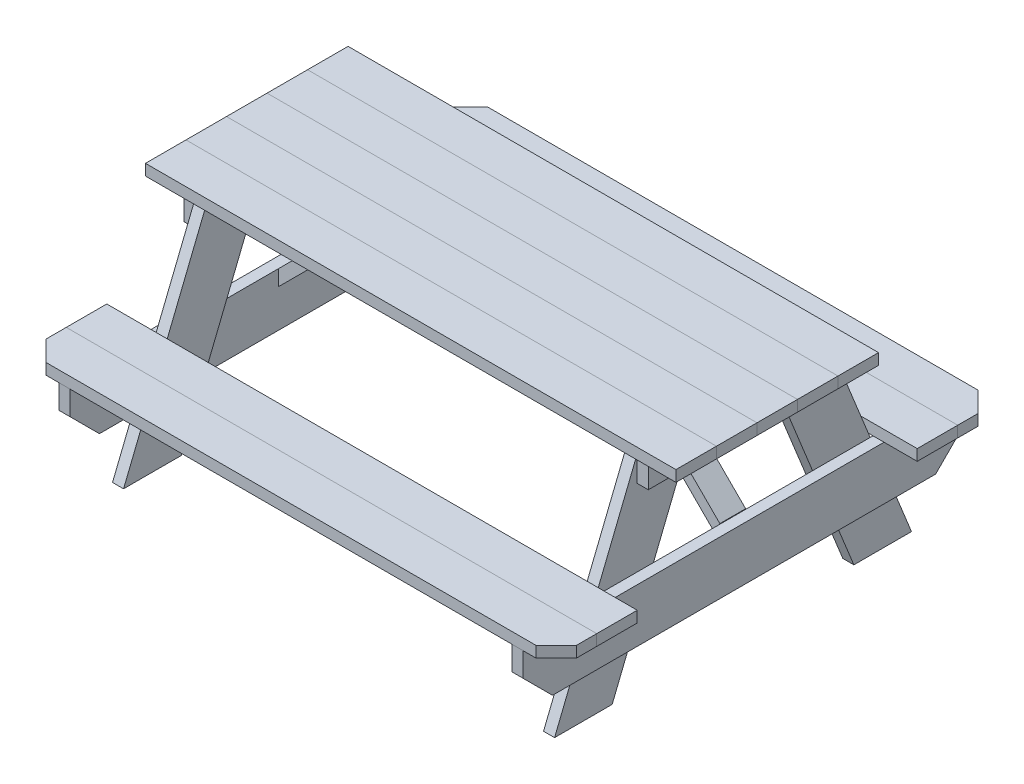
ISO-10303-21;
HEADER;
FILE_DESCRIPTION(('STEP AP214'),'2;1');
FILE_NAME('part.step','',(''),(''),'','','');
FILE_SCHEMA(('AUTOMOTIVE_DESIGN { 1 0 10303 214 1 1 1 1 }'));
ENDSEC;
DATA;
#1=APPLICATION_CONTEXT('core data for automotive mechanical design processes');
#2=APPLICATION_PROTOCOL_DEFINITION('international standard','automotive_design',2000,#1);
#3=PRODUCT_CONTEXT('',#1,'mechanical');
#4=PRODUCT('Part','Part','',(#3));
#5=PRODUCT_RELATED_PRODUCT_CATEGORY('part','',(#4));
#6=PRODUCT_DEFINITION_FORMATION('','',#4);
#7=PRODUCT_DEFINITION_CONTEXT('part definition',#1,'design');
#8=PRODUCT_DEFINITION('design','',#6,#7);
#9=PRODUCT_DEFINITION_SHAPE('','',#8);
#10=(LENGTH_UNIT() NAMED_UNIT(*) SI_UNIT(.MILLI.,.METRE.));
#11=(NAMED_UNIT(*) PLANE_ANGLE_UNIT() SI_UNIT($,.RADIAN.));
#12=(NAMED_UNIT(*) SI_UNIT($,.STERADIAN.) SOLID_ANGLE_UNIT());
#13=UNCERTAINTY_MEASURE_WITH_UNIT(LENGTH_MEASURE(1.E-05),#10,'distance_accuracy_value','');
#14=(GEOMETRIC_REPRESENTATION_CONTEXT(3) GLOBAL_UNCERTAINTY_ASSIGNED_CONTEXT((#13)) GLOBAL_UNIT_ASSIGNED_CONTEXT((#10,
#11,#12)) REPRESENTATION_CONTEXT('',''));
#15=CARTESIAN_POINT('',(0.,0.,0.));
#16=DIRECTION('',(0.,0.,1.));
#17=DIRECTION('',(1.,0.,0.));
#18=AXIS2_PLACEMENT_3D('',#15,#16,#17);
#19=CARTESIAN_POINT('',(914.4,353.257048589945,-482.6));
#20=DIRECTION('',(0.,0.,-1.));
#21=DIRECTION('',(1.,0.,0.));
#22=AXIS2_PLACEMENT_3D('',#19,#20,#21);
#23=PLANE('',#22);
#24=DIRECTION('',(0.,1.,0.));
#25=VECTOR('',#24,1.);
#26=CARTESIAN_POINT('',(-914.4,353.257048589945,-482.6));
#27=LINE('',#26,#25);
#28=CARTESIAN_POINT('',(-914.4,353.257048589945,-482.6));
#29=VERTEX_POINT('',#28);
#30=CARTESIAN_POINT('',(-914.4,391.357048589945,-482.6));
#31=VERTEX_POINT('',#30);
#32=EDGE_CURVE('E172',#29,#31,#27,.T.);
#33=ORIENTED_EDGE('',*,*,#32,.F.);
#34=DIRECTION('',(-1.,0.,0.));
#35=VECTOR('',#34,1.);
#36=CARTESIAN_POINT('',(914.4,353.257048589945,-482.6));
#37=LINE('',#36,#35);
#38=CARTESIAN_POINT('',(914.4,353.257048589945,-482.6));
#39=VERTEX_POINT('',#38);
#40=EDGE_CURVE('E168',#39,#29,#37,.T.);
#41=ORIENTED_EDGE('',*,*,#40,.F.);
#42=DIRECTION('',(0.,1.,0.));
#43=VECTOR('',#42,1.);
#44=CARTESIAN_POINT('',(914.4,353.257048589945,-482.6));
#45=LINE('',#44,#43);
#46=CARTESIAN_POINT('',(914.4,391.357048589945,-482.6));
#47=VERTEX_POINT('',#46);
#48=EDGE_CURVE('E164',#39,#47,#45,.T.);
#49=ORIENTED_EDGE('',*,*,#48,.T.);
#50=DIRECTION('',(-1.,0.,0.));
#51=VECTOR('',#50,1.);
#52=CARTESIAN_POINT('',(914.4,391.357048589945,-482.6));
#53=LINE('',#52,#51);
#54=EDGE_CURVE('E14',#47,#31,#53,.T.);
#55=ORIENTED_EDGE('',*,*,#54,.T.);
#56=EDGE_LOOP('',(#33,#41,#49,#55));
#57=FACE_BOUND('',#56,.T.);
#58=ADVANCED_FACE('F107',(#57),#23,.F.);
#59=CARTESIAN_POINT('',(914.4,391.357048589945,-622.3));
#60=DIRECTION('',(0.,-1.,0.));
#61=DIRECTION('',(0.,0.,1.));
#62=AXIS2_PLACEMENT_3D('',#59,#60,#61);
#63=PLANE('',#62);
#64=DIRECTION('',(0.,0.,-1.));
#65=VECTOR('',#64,1.);
#66=CARTESIAN_POINT('',(-914.4,391.357048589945,-622.3));
#67=LINE('',#66,#65);
#68=CARTESIAN_POINT('',(-914.4,391.357048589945,-622.3));
#69=VERTEX_POINT('',#68);
#70=EDGE_CURVE('E175',#31,#69,#67,.T.);
#71=ORIENTED_EDGE('',*,*,#70,.F.);
#72=ORIENTED_EDGE('',*,*,#54,.F.);
#73=DIRECTION('',(0.,0.,-1.));
#74=VECTOR('',#73,1.);
#75=CARTESIAN_POINT('',(914.4,391.357048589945,-622.3));
#76=LINE('',#75,#74);
#77=CARTESIAN_POINT('',(914.4,391.357048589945,-622.3));
#78=VERTEX_POINT('',#77);
#79=EDGE_CURVE('E149',#47,#78,#76,.T.);
#80=ORIENTED_EDGE('',*,*,#79,.T.);
#81=DIRECTION('',(-1.,0.,0.));
#82=VECTOR('',#81,1.);
#83=CARTESIAN_POINT('',(914.4,391.357048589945,-622.3));
#84=LINE('',#83,#82);
#85=EDGE_CURVE('E117',#78,#69,#84,.T.);
#86=ORIENTED_EDGE('',*,*,#85,.T.);
#87=EDGE_LOOP('',(#71,#72,#80,#86));
#88=FACE_BOUND('',#87,.T.);
#89=ADVANCED_FACE('F162',(#88),#63,.F.);
#90=CARTESIAN_POINT('',(914.4,353.257048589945,-622.3));
#91=DIRECTION('',(0.,0.,1.));
#92=DIRECTION('',(-1.,0.,0.));
#93=AXIS2_PLACEMENT_3D('',#90,#91,#92);
#94=PLANE('',#93);
#95=DIRECTION('',(0.,-1.,0.));
#96=VECTOR('',#95,1.);
#97=CARTESIAN_POINT('',(-914.4,353.257048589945,-622.3));
#98=LINE('',#97,#96);
#99=CARTESIAN_POINT('',(-914.4,353.257048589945,-622.3));
#100=VERTEX_POINT('',#99);
#101=EDGE_CURVE('E157',#69,#100,#98,.T.);
#102=ORIENTED_EDGE('',*,*,#101,.F.);
#103=ORIENTED_EDGE('',*,*,#85,.F.);
#104=DIRECTION('',(0.,-1.,0.));
#105=VECTOR('',#104,1.);
#106=CARTESIAN_POINT('',(914.4,353.257048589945,-622.3));
#107=LINE('',#106,#105);
#108=CARTESIAN_POINT('',(914.4,353.257048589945,-622.3));
#109=VERTEX_POINT('',#108);
#110=EDGE_CURVE('E155',#78,#109,#107,.T.);
#111=ORIENTED_EDGE('',*,*,#110,.T.);
#112=DIRECTION('',(-1.,0.,0.));
#113=VECTOR('',#112,1.);
#114=CARTESIAN_POINT('',(914.4,353.257048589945,-622.3));
#115=LINE('',#114,#113);
#116=EDGE_CURVE('E165',#109,#100,#115,.T.);
#117=ORIENTED_EDGE('',*,*,#116,.T.);
#118=EDGE_LOOP('',(#102,#103,#111,#117));
#119=FACE_BOUND('',#118,.T.);
#120=ADVANCED_FACE('F158',(#119),#94,.F.);
#121=CARTESIAN_POINT('',(914.4,353.257048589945,-622.3));
#122=DIRECTION('',(0.,1.,0.));
#123=DIRECTION('',(0.,0.,-1.));
#124=AXIS2_PLACEMENT_3D('',#121,#122,#123);
#125=PLANE('',#124);
#126=DIRECTION('',(0.,0.,1.));
#127=VECTOR('',#126,1.);
#128=CARTESIAN_POINT('',(-914.4,353.257048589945,-622.3));
#129=LINE('',#128,#127);
#130=EDGE_CURVE('E136',#100,#29,#129,.T.);
#131=ORIENTED_EDGE('',*,*,#130,.F.);
#132=ORIENTED_EDGE('',*,*,#116,.F.);
#133=DIRECTION('',(0.,0.,1.));
#134=VECTOR('',#133,1.);
#135=CARTESIAN_POINT('',(914.4,353.257048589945,-622.3));
#136=LINE('',#135,#134);
#137=EDGE_CURVE('E122',#109,#39,#136,.T.);
#138=ORIENTED_EDGE('',*,*,#137,.T.);
#139=ORIENTED_EDGE('',*,*,#40,.T.);
#140=EDGE_LOOP('',(#131,#132,#138,#139));
#141=FACE_BOUND('',#140,.T.);
#142=ADVANCED_FACE('F185',(#141),#125,.F.);
#143=CARTESIAN_POINT('',(914.4,19.05,209.55));
#144=DIRECTION('',(-1.,0.,0.));
#145=DIRECTION('',(0.,0.,-1.));
#146=AXIS2_PLACEMENT_3D('',#143,#144,#145);
#147=PLANE('',#146);
#148=ORIENTED_EDGE('',*,*,#48,.F.);
#149=ORIENTED_EDGE('',*,*,#137,.F.);
#150=ORIENTED_EDGE('',*,*,#110,.F.);
#151=ORIENTED_EDGE('',*,*,#79,.F.);
#152=EDGE_LOOP('',(#148,#149,#150,#151));
#153=FACE_BOUND('',#152,.T.);
#154=ADVANCED_FACE('F152',(#153),#147,.F.);
#155=CARTESIAN_POINT('',(-914.4,19.05,209.55));
#156=DIRECTION('',(-1.,0.,0.));
#157=DIRECTION('',(0.,0.,-1.));
#158=AXIS2_PLACEMENT_3D('',#155,#156,#157);
#159=PLANE('',#158);
#160=ORIENTED_EDGE('',*,*,#32,.T.);
#161=ORIENTED_EDGE('',*,*,#70,.T.);
#162=ORIENTED_EDGE('',*,*,#101,.T.);
#163=ORIENTED_EDGE('',*,*,#130,.T.);
#164=EDGE_LOOP('',(#160,#161,#162,#163));
#165=FACE_BOUND('',#164,.T.);
#166=ADVANCED_FACE('F178',(#165),#159,.T.);
#167=CLOSED_SHELL('',(#58,#89,#120,#142,#154,#166));
#168=MANIFOLD_SOLID_BREP('B2',#167);
#169=CARTESIAN_POINT('',(914.4,353.257048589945,-622.3));
#170=DIRECTION('',(0.,0.,-1.));
#171=DIRECTION('',(1.,0.,0.));
#172=AXIS2_PLACEMENT_3D('',#169,#170,#171);
#173=PLANE('',#172);
#174=DIRECTION('',(0.,1.,0.));
#175=VECTOR('',#174,1.);
#176=CARTESIAN_POINT('',(-914.4,353.257048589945,-622.3));
#177=LINE('',#176,#175);
#178=CARTESIAN_POINT('',(-914.4,353.257048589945,-622.3));
#179=VERTEX_POINT('',#178);
#180=CARTESIAN_POINT('',(-914.4,391.357048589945,-622.3));
#181=VERTEX_POINT('',#180);
#182=EDGE_CURVE('E321',#179,#181,#177,.T.);
#183=ORIENTED_EDGE('',*,*,#182,.F.);
#184=DIRECTION('',(-1.,0.,0.));
#185=VECTOR('',#184,1.);
#186=CARTESIAN_POINT('',(914.4,353.257048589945,-622.3));
#187=LINE('',#186,#185);
#188=CARTESIAN_POINT('',(914.4,353.257048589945,-622.3));
#189=VERTEX_POINT('',#188);
#190=EDGE_CURVE('E312',#189,#179,#187,.T.);
#191=ORIENTED_EDGE('',*,*,#190,.F.);
#192=DIRECTION('',(0.,1.,0.));
#193=VECTOR('',#192,1.);
#194=CARTESIAN_POINT('',(914.4,353.257048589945,-622.3));
#195=LINE('',#194,#193);
#196=CARTESIAN_POINT('',(914.4,391.357048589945,-622.3));
#197=VERTEX_POINT('',#196);
#198=EDGE_CURVE('E300',#189,#197,#195,.T.);
#199=ORIENTED_EDGE('',*,*,#198,.T.);
#200=DIRECTION('',(-1.,0.,0.));
#201=VECTOR('',#200,1.);
#202=CARTESIAN_POINT('',(914.4,391.357048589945,-622.3));
#203=LINE('',#202,#201);
#204=EDGE_CURVE('E304',#197,#181,#203,.T.);
#205=ORIENTED_EDGE('',*,*,#204,.T.);
#206=EDGE_LOOP('',(#183,#191,#199,#205));
#207=FACE_BOUND('',#206,.T.);
#208=ADVANCED_FACE('F245',(#207),#173,.F.);
#209=CARTESIAN_POINT('',(914.4,391.357048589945,-762.));
#210=DIRECTION('',(0.,-1.,0.));
#211=DIRECTION('',(0.,0.,1.));
#212=AXIS2_PLACEMENT_3D('',#209,#210,#211);
#213=PLANE('',#212);
#214=DIRECTION('',(0.,0.,-1.));
#215=VECTOR('',#214,1.);
#216=CARTESIAN_POINT('',(-914.4,391.357048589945,-762.));
#217=LINE('',#216,#215);
#218=CARTESIAN_POINT('',(-914.4,391.357048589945,-692.15));
#219=VERTEX_POINT('',#218);
#220=EDGE_CURVE('E307',#181,#219,#217,.T.);
#221=ORIENTED_EDGE('',*,*,#220,.F.);
#222=ORIENTED_EDGE('',*,*,#204,.F.);
#223=DIRECTION('',(0.,0.,-1.));
#224=VECTOR('',#223,1.);
#225=CARTESIAN_POINT('',(914.4,391.357048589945,-762.));
#226=LINE('',#225,#224);
#227=CARTESIAN_POINT('',(914.4,391.357048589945,-692.15));
#228=VERTEX_POINT('',#227);
#229=EDGE_CURVE('E291',#197,#228,#226,.T.);
#230=ORIENTED_EDGE('',*,*,#229,.T.);
#231=DIRECTION('',(-0.707106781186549,0.,-0.707106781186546));
#232=VECTOR('',#231,1.);
#233=CARTESIAN_POINT('',(914.4,391.357048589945,-692.15));
#234=LINE('',#233,#232);
#235=CARTESIAN_POINT('',(844.55,391.357048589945,-762.));
#236=VERTEX_POINT('',#235);
#237=EDGE_CURVE('E336',#236,#228,#234,.F.);
#238=ORIENTED_EDGE('',*,*,#237,.F.);
#239=DIRECTION('',(-1.,0.,0.));
#240=VECTOR('',#239,1.);
#241=CARTESIAN_POINT('',(914.4,391.357048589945,-762.));
#242=LINE('',#241,#240);
#243=CARTESIAN_POINT('',(-844.55,391.357048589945,-762.));
#244=VERTEX_POINT('',#243);
#245=EDGE_CURVE('E315',#236,#244,#242,.T.);
#246=ORIENTED_EDGE('',*,*,#245,.T.);
#247=DIRECTION('',(0.707106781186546,0.,-0.707106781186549));
#248=VECTOR('',#247,1.);
#249=CARTESIAN_POINT('',(-844.55,391.357048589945,-762.));
#250=LINE('',#249,#248);
#251=EDGE_CURVE('E247',#219,#244,#250,.T.);
#252=ORIENTED_EDGE('',*,*,#251,.F.);
#253=EDGE_LOOP('',(#221,#222,#230,#238,#246,#252));
#254=FACE_BOUND('',#253,.T.);
#255=ADVANCED_FACE('F302',(#254),#213,.F.);
#256=CARTESIAN_POINT('',(914.4,353.257048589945,-762.));
#257=DIRECTION('',(0.,0.,1.));
#258=DIRECTION('',(-1.,0.,0.));
#259=AXIS2_PLACEMENT_3D('',#256,#257,#258);
#260=PLANE('',#259);
#261=ORIENTED_EDGE('',*,*,#245,.F.);
#262=DIRECTION('',(0.,1.,0.));
#263=VECTOR('',#262,1.);
#264=CARTESIAN_POINT('',(844.55,353.257048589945,-762.));
#265=LINE('',#264,#263);
#266=CARTESIAN_POINT('',(844.55,353.257048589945,-762.));
#267=VERTEX_POINT('',#266);
#268=EDGE_CURVE('E313',#267,#236,#265,.T.);
#269=ORIENTED_EDGE('',*,*,#268,.F.);
#270=DIRECTION('',(-1.,0.,0.));
#271=VECTOR('',#270,1.);
#272=CARTESIAN_POINT('',(914.4,353.257048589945,-762.));
#273=LINE('',#272,#271);
#274=CARTESIAN_POINT('',(-844.55,353.257048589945,-762.));
#275=VERTEX_POINT('',#274);
#276=EDGE_CURVE('E324',#267,#275,#273,.T.);
#277=ORIENTED_EDGE('',*,*,#276,.T.);
#278=DIRECTION('',(0.,-1.,0.));
#279=VECTOR('',#278,1.);
#280=CARTESIAN_POINT('',(-844.55,353.257048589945,-762.));
#281=LINE('',#280,#279);
#282=EDGE_CURVE('E332',#244,#275,#281,.T.);
#283=ORIENTED_EDGE('',*,*,#282,.F.);
#284=EDGE_LOOP('',(#261,#269,#277,#283));
#285=FACE_BOUND('',#284,.T.);
#286=ADVANCED_FACE('F342',(#285),#260,.F.);
#287=CARTESIAN_POINT('',(914.4,353.257048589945,-762.));
#288=DIRECTION('',(0.,1.,0.));
#289=DIRECTION('',(0.,0.,-1.));
#290=AXIS2_PLACEMENT_3D('',#287,#288,#289);
#291=PLANE('',#290);
#292=ORIENTED_EDGE('',*,*,#276,.F.);
#293=DIRECTION('',(0.707106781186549,0.,0.707106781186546));
#294=VECTOR('',#293,1.);
#295=CARTESIAN_POINT('',(914.4,353.257048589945,-692.15));
#296=LINE('',#295,#294);
#297=CARTESIAN_POINT('',(914.4,353.257048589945,-692.15));
#298=VERTEX_POINT('',#297);
#299=EDGE_CURVE('E331',#298,#267,#296,.F.);
#300=ORIENTED_EDGE('',*,*,#299,.F.);
#301=DIRECTION('',(0.,0.,1.));
#302=VECTOR('',#301,1.);
#303=CARTESIAN_POINT('',(914.4,353.257048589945,-762.));
#304=LINE('',#303,#302);
#305=EDGE_CURVE('E303',#298,#189,#304,.T.);
#306=ORIENTED_EDGE('',*,*,#305,.T.);
#307=ORIENTED_EDGE('',*,*,#190,.T.);
#308=DIRECTION('',(0.,0.,1.));
#309=VECTOR('',#308,1.);
#310=CARTESIAN_POINT('',(-914.4,353.257048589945,-762.));
#311=LINE('',#310,#309);
#312=CARTESIAN_POINT('',(-914.4,353.257048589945,-692.15));
#313=VERTEX_POINT('',#312);
#314=EDGE_CURVE('E316',#313,#179,#311,.T.);
#315=ORIENTED_EDGE('',*,*,#314,.F.);
#316=DIRECTION('',(-0.707106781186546,0.,0.707106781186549));
#317=VECTOR('',#316,1.);
#318=CARTESIAN_POINT('',(-844.55,353.257048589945,-762.));
#319=LINE('',#318,#317);
#320=EDGE_CURVE('E337',#275,#313,#319,.T.);
#321=ORIENTED_EDGE('',*,*,#320,.F.);
#322=EDGE_LOOP('',(#292,#300,#306,#307,#315,#321));
#323=FACE_BOUND('',#322,.T.);
#324=ADVANCED_FACE('F346',(#323),#291,.F.);
#325=CARTESIAN_POINT('',(914.4,19.0499999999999,69.85));
#326=DIRECTION('',(-1.,0.,0.));
#327=DIRECTION('',(0.,0.,-1.));
#328=AXIS2_PLACEMENT_3D('',#325,#326,#327);
#329=PLANE('',#328);
#330=ORIENTED_EDGE('',*,*,#229,.F.);
#331=ORIENTED_EDGE('',*,*,#198,.F.);
#332=ORIENTED_EDGE('',*,*,#305,.F.);
#333=DIRECTION('',(0.,-1.,0.));
#334=VECTOR('',#333,1.);
#335=CARTESIAN_POINT('',(914.4,19.05,-692.15));
#336=LINE('',#335,#334);
#337=EDGE_CURVE('E106',#228,#298,#336,.T.);
#338=ORIENTED_EDGE('',*,*,#337,.F.);
#339=EDGE_LOOP('',(#330,#331,#332,#338));
#340=FACE_BOUND('',#339,.T.);
#341=ADVANCED_FACE('F293',(#340),#329,.F.);
#342=CARTESIAN_POINT('',(-914.4,19.05,69.85));
#343=DIRECTION('',(-1.,0.,0.));
#344=DIRECTION('',(0.,0.,-1.));
#345=AXIS2_PLACEMENT_3D('',#342,#343,#344);
#346=PLANE('',#345);
#347=ORIENTED_EDGE('',*,*,#314,.T.);
#348=ORIENTED_EDGE('',*,*,#182,.T.);
#349=ORIENTED_EDGE('',*,*,#220,.T.);
#350=DIRECTION('',(0.,1.,0.));
#351=VECTOR('',#350,1.);
#352=CARTESIAN_POINT('',(-914.4,391.357048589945,-692.15));
#353=LINE('',#352,#351);
#354=EDGE_CURVE('E263',#313,#219,#353,.T.);
#355=ORIENTED_EDGE('',*,*,#354,.F.);
#356=EDGE_LOOP('',(#347,#348,#349,#355));
#357=FACE_BOUND('',#356,.T.);
#358=ADVANCED_FACE('F353',(#357),#346,.T.);
#359=CARTESIAN_POINT('',(-844.55,353.257048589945,-762.));
#360=DIRECTION('',(-0.707106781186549,0.,-0.707106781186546));
#361=DIRECTION('',(0.,1.,0.));
#362=AXIS2_PLACEMENT_3D('',#359,#360,#361);
#363=PLANE('',#362);
#364=ORIENTED_EDGE('',*,*,#251,.T.);
#365=ORIENTED_EDGE('',*,*,#282,.T.);
#366=ORIENTED_EDGE('',*,*,#320,.T.);
#367=ORIENTED_EDGE('',*,*,#354,.T.);
#368=EDGE_LOOP('',(#364,#365,#366,#367));
#369=FACE_BOUND('',#368,.T.);
#370=ADVANCED_FACE('F338',(#369),#363,.T.);
#371=CARTESIAN_POINT('',(914.4,19.05,-692.15));
#372=DIRECTION('',(-0.707106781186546,0.,0.707106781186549));
#373=DIRECTION('',(0.,-1.,0.));
#374=AXIS2_PLACEMENT_3D('',#371,#372,#373);
#375=PLANE('',#374);
#376=ORIENTED_EDGE('',*,*,#237,.T.);
#377=ORIENTED_EDGE('',*,*,#337,.T.);
#378=ORIENTED_EDGE('',*,*,#299,.T.);
#379=ORIENTED_EDGE('',*,*,#268,.T.);
#380=EDGE_LOOP('',(#376,#377,#378,#379));
#381=FACE_BOUND('',#380,.T.);
#382=ADVANCED_FACE('F244',(#381),#375,.F.);
#383=CLOSED_SHELL('',(#208,#255,#286,#324,#341,#358,#370,#382));
#384=MANIFOLD_SOLID_BREP('B8',#383);
#385=CARTESIAN_POINT('',(914.4,353.257048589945,482.6));
#386=DIRECTION('',(0.,0.,1.));
#387=DIRECTION('',(1.,0.,0.));
#388=AXIS2_PLACEMENT_3D('',#385,#386,#387);
#389=PLANE('',#388);
#390=DIRECTION('',(0.,1.,0.));
#391=VECTOR('',#390,1.);
#392=CARTESIAN_POINT('',(-914.4,353.257048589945,482.6));
#393=LINE('',#392,#391);
#394=CARTESIAN_POINT('',(-914.4,353.257048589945,482.6));
#395=VERTEX_POINT('',#394);
#396=CARTESIAN_POINT('',(-914.4,391.357048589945,482.6));
#397=VERTEX_POINT('',#396);
#398=EDGE_CURVE('E490',#395,#397,#393,.T.);
#399=ORIENTED_EDGE('',*,*,#398,.T.);
#400=DIRECTION('',(-1.,0.,0.));
#401=VECTOR('',#400,1.);
#402=CARTESIAN_POINT('',(914.4,391.357048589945,482.6));
#403=LINE('',#402,#401);
#404=CARTESIAN_POINT('',(914.4,391.357048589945,482.6));
#405=VERTEX_POINT('',#404);
#406=EDGE_CURVE('E238',#405,#397,#403,.T.);
#407=ORIENTED_EDGE('',*,*,#406,.F.);
#408=DIRECTION('',(0.,1.,0.));
#409=VECTOR('',#408,1.);
#410=CARTESIAN_POINT('',(914.4,353.257048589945,482.6));
#411=LINE('',#410,#409);
#412=CARTESIAN_POINT('',(914.4,353.257048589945,482.6));
#413=VERTEX_POINT('',#412);
#414=EDGE_CURVE('E474',#413,#405,#411,.T.);
#415=ORIENTED_EDGE('',*,*,#414,.F.);
#416=DIRECTION('',(-1.,0.,0.));
#417=VECTOR('',#416,1.);
#418=CARTESIAN_POINT('',(914.4,353.257048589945,482.6));
#419=LINE('',#418,#417);
#420=EDGE_CURVE('E483',#413,#395,#419,.T.);
#421=ORIENTED_EDGE('',*,*,#420,.T.);
#422=EDGE_LOOP('',(#399,#407,#415,#421));
#423=FACE_BOUND('',#422,.T.);
#424=ADVANCED_FACE('F424',(#423),#389,.F.);
#425=CARTESIAN_POINT('',(914.4,391.357048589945,622.3));
#426=DIRECTION('',(0.,-1.,0.));
#427=DIRECTION('',(0.,0.,-1.));
#428=AXIS2_PLACEMENT_3D('',#425,#426,#427);
#429=PLANE('',#428);
#430=DIRECTION('',(0.,0.,1.));
#431=VECTOR('',#430,1.);
#432=CARTESIAN_POINT('',(-914.4,391.357048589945,622.3));
#433=LINE('',#432,#431);
#434=CARTESIAN_POINT('',(-914.4,391.357048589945,622.3));
#435=VERTEX_POINT('',#434);
#436=EDGE_CURVE('E479',#397,#435,#433,.T.);
#437=ORIENTED_EDGE('',*,*,#436,.T.);
#438=DIRECTION('',(-1.,0.,0.));
#439=VECTOR('',#438,1.);
#440=CARTESIAN_POINT('',(914.4,391.357048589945,622.3));
#441=LINE('',#440,#439);
#442=CARTESIAN_POINT('',(914.4,391.357048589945,622.3));
#443=VERTEX_POINT('',#442);
#444=EDGE_CURVE('E435',#443,#435,#441,.T.);
#445=ORIENTED_EDGE('',*,*,#444,.F.);
#446=DIRECTION('',(0.,0.,1.));
#447=VECTOR('',#446,1.);
#448=CARTESIAN_POINT('',(914.4,391.357048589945,622.3));
#449=LINE('',#448,#447);
#450=EDGE_CURVE('E467',#405,#443,#449,.T.);
#451=ORIENTED_EDGE('',*,*,#450,.F.);
#452=ORIENTED_EDGE('',*,*,#406,.T.);
#453=EDGE_LOOP('',(#437,#445,#451,#452));
#454=FACE_BOUND('',#453,.T.);
#455=ADVANCED_FACE('F476',(#454),#429,.F.);
#456=CARTESIAN_POINT('',(914.4,353.257048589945,622.3));
#457=DIRECTION('',(0.,0.,-1.));
#458=DIRECTION('',(-1.,0.,0.));
#459=AXIS2_PLACEMENT_3D('',#456,#457,#458);
#460=PLANE('',#459);
#461=DIRECTION('',(0.,-1.,0.));
#462=VECTOR('',#461,1.);
#463=CARTESIAN_POINT('',(-914.4,353.257048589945,622.3));
#464=LINE('',#463,#462);
#465=CARTESIAN_POINT('',(-914.4,353.257048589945,622.3));
#466=VERTEX_POINT('',#465);
#467=EDGE_CURVE('E460',#435,#466,#464,.T.);
#468=ORIENTED_EDGE('',*,*,#467,.T.);
#469=DIRECTION('',(-1.,0.,0.));
#470=VECTOR('',#469,1.);
#471=CARTESIAN_POINT('',(914.4,353.257048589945,622.3));
#472=LINE('',#471,#470);
#473=CARTESIAN_POINT('',(914.4,353.257048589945,622.3));
#474=VERTEX_POINT('',#473);
#475=EDGE_CURVE('E477',#474,#466,#472,.T.);
#476=ORIENTED_EDGE('',*,*,#475,.F.);
#477=DIRECTION('',(0.,-1.,0.));
#478=VECTOR('',#477,1.);
#479=CARTESIAN_POINT('',(914.4,353.257048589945,622.3));
#480=LINE('',#479,#478);
#481=EDGE_CURVE('E471',#443,#474,#480,.T.);
#482=ORIENTED_EDGE('',*,*,#481,.F.);
#483=ORIENTED_EDGE('',*,*,#444,.T.);
#484=EDGE_LOOP('',(#468,#476,#482,#483));
#485=FACE_BOUND('',#484,.T.);
#486=ADVANCED_FACE('F481',(#485),#460,.F.);
#487=CARTESIAN_POINT('',(914.4,353.257048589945,622.3));
#488=DIRECTION('',(0.,1.,0.));
#489=DIRECTION('',(0.,0.,1.));
#490=AXIS2_PLACEMENT_3D('',#487,#488,#489);
#491=PLANE('',#490);
#492=DIRECTION('',(0.,0.,-1.));
#493=VECTOR('',#492,1.);
#494=CARTESIAN_POINT('',(-914.4,353.257048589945,622.3));
#495=LINE('',#494,#493);
#496=EDGE_CURVE('E461',#466,#395,#495,.T.);
#497=ORIENTED_EDGE('',*,*,#496,.T.);
#498=ORIENTED_EDGE('',*,*,#420,.F.);
#499=DIRECTION('',(0.,0.,-1.));
#500=VECTOR('',#499,1.);
#501=CARTESIAN_POINT('',(914.4,353.257048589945,622.3));
#502=LINE('',#501,#500);
#503=EDGE_CURVE('E439',#474,#413,#502,.T.);
#504=ORIENTED_EDGE('',*,*,#503,.F.);
#505=ORIENTED_EDGE('',*,*,#475,.T.);
#506=EDGE_LOOP('',(#497,#498,#504,#505));
#507=FACE_BOUND('',#506,.T.);
#508=ADVANCED_FACE('F493',(#507),#491,.F.);
#509=CARTESIAN_POINT('',(914.4,19.05,-209.55));
#510=DIRECTION('',(-1.,0.,0.));
#511=DIRECTION('',(0.,0.,1.));
#512=AXIS2_PLACEMENT_3D('',#509,#510,#511);
#513=PLANE('',#512);
#514=ORIENTED_EDGE('',*,*,#414,.T.);
#515=ORIENTED_EDGE('',*,*,#450,.T.);
#516=ORIENTED_EDGE('',*,*,#481,.T.);
#517=ORIENTED_EDGE('',*,*,#503,.T.);
#518=EDGE_LOOP('',(#514,#515,#516,#517));
#519=FACE_BOUND('',#518,.T.);
#520=ADVANCED_FACE('F473',(#519),#513,.F.);
#521=CARTESIAN_POINT('',(-914.4,19.05,-209.55));
#522=DIRECTION('',(-1.,0.,0.));
#523=DIRECTION('',(0.,0.,1.));
#524=AXIS2_PLACEMENT_3D('',#521,#522,#523);
#525=PLANE('',#524);
#526=ORIENTED_EDGE('',*,*,#398,.F.);
#527=ORIENTED_EDGE('',*,*,#496,.F.);
#528=ORIENTED_EDGE('',*,*,#467,.F.);
#529=ORIENTED_EDGE('',*,*,#436,.F.);
#530=EDGE_LOOP('',(#526,#527,#528,#529));
#531=FACE_BOUND('',#530,.T.);
#532=ADVANCED_FACE('F500',(#531),#525,.T.);
#533=CLOSED_SHELL('',(#424,#455,#486,#508,#520,#532));
#534=MANIFOLD_SOLID_BREP('B99',#533);
#535=CARTESIAN_POINT('',(914.4,353.257048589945,622.3));
#536=DIRECTION('',(0.,0.,1.));
#537=DIRECTION('',(1.,0.,0.));
#538=AXIS2_PLACEMENT_3D('',#535,#536,#537);
#539=PLANE('',#538);
#540=DIRECTION('',(0.,1.,0.));
#541=VECTOR('',#540,1.);
#542=CARTESIAN_POINT('',(-914.4,353.257048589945,622.3));
#543=LINE('',#542,#541);
#544=CARTESIAN_POINT('',(-914.4,353.257048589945,622.3));
#545=VERTEX_POINT('',#544);
#546=CARTESIAN_POINT('',(-914.4,391.357048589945,622.3));
#547=VERTEX_POINT('',#546);
#548=EDGE_CURVE('E633',#545,#547,#543,.T.);
#549=ORIENTED_EDGE('',*,*,#548,.T.);
#550=DIRECTION('',(-1.,0.,0.));
#551=VECTOR('',#550,1.);
#552=CARTESIAN_POINT('',(914.4,391.357048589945,622.3));
#553=LINE('',#552,#551);
#554=CARTESIAN_POINT('',(914.4,391.357048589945,622.3));
#555=VERTEX_POINT('',#554);
#556=EDGE_CURVE('E613',#555,#547,#553,.T.);
#557=ORIENTED_EDGE('',*,*,#556,.F.);
#558=DIRECTION('',(0.,1.,0.));
#559=VECTOR('',#558,1.);
#560=CARTESIAN_POINT('',(914.4,353.257048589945,622.3));
#561=LINE('',#560,#559);
#562=CARTESIAN_POINT('',(914.4,353.257048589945,622.3));
#563=VERTEX_POINT('',#562);
#564=EDGE_CURVE('E619',#563,#555,#561,.T.);
#565=ORIENTED_EDGE('',*,*,#564,.F.);
#566=DIRECTION('',(-1.,0.,0.));
#567=VECTOR('',#566,1.);
#568=CARTESIAN_POINT('',(914.4,353.257048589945,622.3));
#569=LINE('',#568,#567);
#570=EDGE_CURVE('E667',#563,#545,#569,.T.);
#571=ORIENTED_EDGE('',*,*,#570,.T.);
#572=EDGE_LOOP('',(#549,#557,#565,#571));
#573=FACE_BOUND('',#572,.T.);
#574=ADVANCED_FACE('F560',(#573),#539,.F.);
#575=CARTESIAN_POINT('',(914.4,391.357048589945,762.));
#576=DIRECTION('',(0.,-1.,0.));
#577=DIRECTION('',(0.,0.,-1.));
#578=AXIS2_PLACEMENT_3D('',#575,#576,#577);
#579=PLANE('',#578);
#580=DIRECTION('',(0.,0.,1.));
#581=VECTOR('',#580,1.);
#582=CARTESIAN_POINT('',(-914.4,391.357048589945,762.));
#583=LINE('',#582,#581);
#584=CARTESIAN_POINT('',(-914.4,391.357048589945,692.15));
#585=VERTEX_POINT('',#584);
#586=EDGE_CURVE('E649',#547,#585,#583,.T.);
#587=ORIENTED_EDGE('',*,*,#586,.T.);
#588=DIRECTION('',(0.707106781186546,0.,0.707106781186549));
#589=VECTOR('',#588,1.);
#590=CARTESIAN_POINT('',(-844.55,391.357048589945,762.));
#591=LINE('',#590,#589);
#592=CARTESIAN_POINT('',(-844.55,391.357048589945,762.));
#593=VERTEX_POINT('',#592);
#594=EDGE_CURVE('E567',#585,#593,#591,.T.);
#595=ORIENTED_EDGE('',*,*,#594,.T.);
#596=DIRECTION('',(-1.,0.,0.));
#597=VECTOR('',#596,1.);
#598=CARTESIAN_POINT('',(914.4,391.357048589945,762.));
#599=LINE('',#598,#597);
#600=CARTESIAN_POINT('',(844.55,391.357048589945,762.));
#601=VERTEX_POINT('',#600);
#602=EDGE_CURVE('E631',#601,#593,#599,.T.);
#603=ORIENTED_EDGE('',*,*,#602,.F.);
#604=DIRECTION('',(-0.707106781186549,0.,0.707106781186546));
#605=VECTOR('',#604,1.);
#606=CARTESIAN_POINT('',(914.4,391.357048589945,692.15));
#607=LINE('',#606,#605);
#608=CARTESIAN_POINT('',(914.4,391.357048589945,692.15));
#609=VERTEX_POINT('',#608);
#610=EDGE_CURVE('E571',#601,#609,#607,.F.);
#611=ORIENTED_EDGE('',*,*,#610,.T.);
#612=DIRECTION('',(0.,0.,1.));
#613=VECTOR('',#612,1.);
#614=CARTESIAN_POINT('',(914.4,391.357048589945,762.));
#615=LINE('',#614,#613);
#616=EDGE_CURVE('E612',#555,#609,#615,.T.);
#617=ORIENTED_EDGE('',*,*,#616,.F.);
#618=ORIENTED_EDGE('',*,*,#556,.T.);
#619=EDGE_LOOP('',(#587,#595,#603,#611,#617,#618));
#620=FACE_BOUND('',#619,.T.);
#621=ADVANCED_FACE('F615',(#620),#579,.F.);
#622=CARTESIAN_POINT('',(914.4,353.257048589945,762.));
#623=DIRECTION('',(0.,0.,-1.));
#624=DIRECTION('',(-1.,0.,0.));
#625=AXIS2_PLACEMENT_3D('',#622,#623,#624);
#626=PLANE('',#625);
#627=ORIENTED_EDGE('',*,*,#602,.T.);
#628=DIRECTION('',(0.,-1.,0.));
#629=VECTOR('',#628,1.);
#630=CARTESIAN_POINT('',(-844.55,353.257048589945,762.));
#631=LINE('',#630,#629);
#632=CARTESIAN_POINT('',(-844.55,353.257048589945,762.));
#633=VERTEX_POINT('',#632);
#634=EDGE_CURVE('E632',#593,#633,#631,.T.);
#635=ORIENTED_EDGE('',*,*,#634,.T.);
#636=DIRECTION('',(-1.,0.,0.));
#637=VECTOR('',#636,1.);
#638=CARTESIAN_POINT('',(914.4,353.257048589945,762.));
#639=LINE('',#638,#637);
#640=CARTESIAN_POINT('',(844.55,353.257048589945,762.));
#641=VERTEX_POINT('',#640);
#642=EDGE_CURVE('E636',#641,#633,#639,.T.);
#643=ORIENTED_EDGE('',*,*,#642,.F.);
#644=DIRECTION('',(0.,1.,0.));
#645=VECTOR('',#644,1.);
#646=CARTESIAN_POINT('',(844.55,353.257048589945,762.));
#647=LINE('',#646,#645);
#648=EDGE_CURVE('E635',#641,#601,#647,.T.);
#649=ORIENTED_EDGE('',*,*,#648,.T.);
#650=EDGE_LOOP('',(#627,#635,#643,#649));
#651=FACE_BOUND('',#650,.T.);
#652=ADVANCED_FACE('F652',(#651),#626,.F.);
#653=CARTESIAN_POINT('',(914.4,353.257048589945,762.));
#654=DIRECTION('',(0.,1.,0.));
#655=DIRECTION('',(0.,0.,1.));
#656=AXIS2_PLACEMENT_3D('',#653,#654,#655);
#657=PLANE('',#656);
#658=ORIENTED_EDGE('',*,*,#642,.T.);
#659=DIRECTION('',(-0.707106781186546,0.,-0.707106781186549));
#660=VECTOR('',#659,1.);
#661=CARTESIAN_POINT('',(-844.55,353.257048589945,762.));
#662=LINE('',#661,#660);
#663=CARTESIAN_POINT('',(-914.4,353.257048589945,692.15));
#664=VERTEX_POINT('',#663);
#665=EDGE_CURVE('E646',#633,#664,#662,.T.);
#666=ORIENTED_EDGE('',*,*,#665,.T.);
#667=DIRECTION('',(0.,0.,-1.));
#668=VECTOR('',#667,1.);
#669=CARTESIAN_POINT('',(-914.4,353.257048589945,762.));
#670=LINE('',#669,#668);
#671=EDGE_CURVE('E626',#664,#545,#670,.T.);
#672=ORIENTED_EDGE('',*,*,#671,.T.);
#673=ORIENTED_EDGE('',*,*,#570,.F.);
#674=DIRECTION('',(0.,0.,-1.));
#675=VECTOR('',#674,1.);
#676=CARTESIAN_POINT('',(914.4,353.257048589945,762.));
#677=LINE('',#676,#675);
#678=CARTESIAN_POINT('',(914.4,353.257048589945,692.15));
#679=VERTEX_POINT('',#678);
#680=EDGE_CURVE('E617',#679,#563,#677,.T.);
#681=ORIENTED_EDGE('',*,*,#680,.F.);
#682=DIRECTION('',(0.707106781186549,0.,-0.707106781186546));
#683=VECTOR('',#682,1.);
#684=CARTESIAN_POINT('',(914.4,353.257048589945,692.15));
#685=LINE('',#684,#683);
#686=EDGE_CURVE('E644',#679,#641,#685,.F.);
#687=ORIENTED_EDGE('',*,*,#686,.T.);
#688=EDGE_LOOP('',(#658,#666,#672,#673,#681,#687));
#689=FACE_BOUND('',#688,.T.);
#690=ADVANCED_FACE('F659',(#689),#657,.F.);
#691=CARTESIAN_POINT('',(914.4,19.05,-69.8500000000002));
#692=DIRECTION('',(-1.,0.,0.));
#693=DIRECTION('',(0.,0.,1.));
#694=AXIS2_PLACEMENT_3D('',#691,#692,#693);
#695=PLANE('',#694);
#696=ORIENTED_EDGE('',*,*,#616,.T.);
#697=DIRECTION('',(0.,-1.,0.));
#698=VECTOR('',#697,1.);
#699=CARTESIAN_POINT('',(914.4,19.05,692.15));
#700=LINE('',#699,#698);
#701=EDGE_CURVE('E425',#609,#679,#700,.T.);
#702=ORIENTED_EDGE('',*,*,#701,.T.);
#703=ORIENTED_EDGE('',*,*,#680,.T.);
#704=ORIENTED_EDGE('',*,*,#564,.T.);
#705=EDGE_LOOP('',(#696,#702,#703,#704));
#706=FACE_BOUND('',#705,.T.);
#707=ADVANCED_FACE('F621',(#706),#695,.F.);
#708=CARTESIAN_POINT('',(-914.4,19.05,-69.85));
#709=DIRECTION('',(-1.,0.,0.));
#710=DIRECTION('',(0.,0.,1.));
#711=AXIS2_PLACEMENT_3D('',#708,#709,#710);
#712=PLANE('',#711);
#713=ORIENTED_EDGE('',*,*,#671,.F.);
#714=DIRECTION('',(0.,1.,0.));
#715=VECTOR('',#714,1.);
#716=CARTESIAN_POINT('',(-914.4,391.357048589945,692.15));
#717=LINE('',#716,#715);
#718=EDGE_CURVE('E583',#664,#585,#717,.T.);
#719=ORIENTED_EDGE('',*,*,#718,.T.);
#720=ORIENTED_EDGE('',*,*,#586,.F.);
#721=ORIENTED_EDGE('',*,*,#548,.F.);
#722=EDGE_LOOP('',(#713,#719,#720,#721));
#723=FACE_BOUND('',#722,.T.);
#724=ADVANCED_FACE('F662',(#723),#712,.T.);
#725=CARTESIAN_POINT('',(-844.55,353.257048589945,762.));
#726=DIRECTION('',(-0.707106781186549,0.,0.707106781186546));
#727=DIRECTION('',(0.,1.,0.));
#728=AXIS2_PLACEMENT_3D('',#725,#726,#727);
#729=PLANE('',#728);
#730=ORIENTED_EDGE('',*,*,#594,.F.);
#731=ORIENTED_EDGE('',*,*,#718,.F.);
#732=ORIENTED_EDGE('',*,*,#665,.F.);
#733=ORIENTED_EDGE('',*,*,#634,.F.);
#734=EDGE_LOOP('',(#730,#731,#732,#733));
#735=FACE_BOUND('',#734,.T.);
#736=ADVANCED_FACE('F657',(#735),#729,.T.);
#737=CARTESIAN_POINT('',(914.4,19.05,692.15));
#738=DIRECTION('',(-0.707106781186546,0.,-0.707106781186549));
#739=DIRECTION('',(0.,-1.,0.));
#740=AXIS2_PLACEMENT_3D('',#737,#738,#739);
#741=PLANE('',#740);
#742=ORIENTED_EDGE('',*,*,#610,.F.);
#743=ORIENTED_EDGE('',*,*,#648,.F.);
#744=ORIENTED_EDGE('',*,*,#686,.F.);
#745=ORIENTED_EDGE('',*,*,#701,.F.);
#746=EDGE_LOOP('',(#742,#743,#744,#745));
#747=FACE_BOUND('',#746,.T.);
#748=ADVANCED_FACE('F558',(#747),#741,.F.);
#749=CLOSED_SHELL('',(#574,#621,#652,#690,#707,#724,#736,#748));
#750=MANIFOLD_SOLID_BREP('B232',#749);
#751=CARTESIAN_POINT('',(914.4,744.61409717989,349.25));
#752=DIRECTION('',(0.,0.,-1.));
#753=DIRECTION('',(0.,1.,0.));
#754=AXIS2_PLACEMENT_3D('',#751,#752,#753);
#755=PLANE('',#754);
#756=DIRECTION('',(0.,-1.,0.));
#757=VECTOR('',#756,1.);
#758=CARTESIAN_POINT('',(-914.4,744.61409717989,349.25));
#759=LINE('',#758,#757);
#760=CARTESIAN_POINT('',(-914.4,744.61409717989,349.25));
#761=VERTEX_POINT('',#760);
#762=CARTESIAN_POINT('',(-914.4,706.51409717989,349.25));
#763=VERTEX_POINT('',#762);
#764=EDGE_CURVE('E801',#761,#763,#759,.T.);
#765=ORIENTED_EDGE('',*,*,#764,.T.);
#766=DIRECTION('',(-1.,0.,0.));
#767=VECTOR('',#766,1.);
#768=CARTESIAN_POINT('',(914.4,706.51409717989,349.25));
#769=LINE('',#768,#767);
#770=CARTESIAN_POINT('',(914.4,706.51409717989,349.25));
#771=VERTEX_POINT('',#770);
#772=EDGE_CURVE('E557',#771,#763,#769,.T.);
#773=ORIENTED_EDGE('',*,*,#772,.F.);
#774=DIRECTION('',(0.,-1.,0.));
#775=VECTOR('',#774,1.);
#776=CARTESIAN_POINT('',(914.4,744.61409717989,349.25));
#777=LINE('',#776,#775);
#778=CARTESIAN_POINT('',(914.4,744.61409717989,349.25));
#779=VERTEX_POINT('',#778);
#780=EDGE_CURVE('E793',#779,#771,#777,.T.);
#781=ORIENTED_EDGE('',*,*,#780,.F.);
#782=DIRECTION('',(-1.,0.,0.));
#783=VECTOR('',#782,1.);
#784=CARTESIAN_POINT('',(914.4,744.61409717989,349.25));
#785=LINE('',#784,#783);
#786=EDGE_CURVE('E799',#779,#761,#785,.T.);
#787=ORIENTED_EDGE('',*,*,#786,.T.);
#788=EDGE_LOOP('',(#765,#773,#781,#787));
#789=FACE_BOUND('',#788,.T.);
#790=ADVANCED_FACE('F737',(#789),#755,.F.);
#791=CARTESIAN_POINT('',(914.4,706.514097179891,209.55));
#792=DIRECTION('',(0.,1.,0.));
#793=DIRECTION('',(0.,0.,1.));
#794=AXIS2_PLACEMENT_3D('',#791,#792,#793);
#795=PLANE('',#794);
#796=DIRECTION('',(0.,0.,-1.));
#797=VECTOR('',#796,1.);
#798=CARTESIAN_POINT('',(-914.4,706.514097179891,209.55));
#799=LINE('',#798,#797);
#800=CARTESIAN_POINT('',(-914.4,706.514097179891,209.55));
#801=VERTEX_POINT('',#800);
#802=EDGE_CURVE('E792',#763,#801,#799,.T.);
#803=ORIENTED_EDGE('',*,*,#802,.T.);
#804=DIRECTION('',(-1.,0.,0.));
#805=VECTOR('',#804,1.);
#806=CARTESIAN_POINT('',(914.4,706.514097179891,209.55));
#807=LINE('',#806,#805);
#808=CARTESIAN_POINT('',(914.4,706.514097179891,209.55));
#809=VERTEX_POINT('',#808);
#810=EDGE_CURVE('E746',#809,#801,#807,.T.);
#811=ORIENTED_EDGE('',*,*,#810,.F.);
#812=DIRECTION('',(0.,0.,-1.));
#813=VECTOR('',#812,1.);
#814=CARTESIAN_POINT('',(914.4,706.514097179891,209.55));
#815=LINE('',#814,#813);
#816=EDGE_CURVE('E787',#771,#809,#815,.T.);
#817=ORIENTED_EDGE('',*,*,#816,.F.);
#818=ORIENTED_EDGE('',*,*,#772,.T.);
#819=EDGE_LOOP('',(#803,#811,#817,#818));
#820=FACE_BOUND('',#819,.T.);
#821=ADVANCED_FACE('F794',(#820),#795,.F.);
#822=CARTESIAN_POINT('',(914.4,744.614097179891,209.55));
#823=DIRECTION('',(0.,0.,1.));
#824=DIRECTION('',(0.,-1.,0.));
#825=AXIS2_PLACEMENT_3D('',#822,#823,#824);
#826=PLANE('',#825);
#827=DIRECTION('',(0.,1.,0.));
#828=VECTOR('',#827,1.);
#829=CARTESIAN_POINT('',(-914.4,744.614097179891,209.55));
#830=LINE('',#829,#828);
#831=CARTESIAN_POINT('',(-914.4,744.614097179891,209.55));
#832=VERTEX_POINT('',#831);
#833=EDGE_CURVE('E774',#801,#832,#830,.T.);
#834=ORIENTED_EDGE('',*,*,#833,.T.);
#835=DIRECTION('',(-1.,0.,0.));
#836=VECTOR('',#835,1.);
#837=CARTESIAN_POINT('',(914.4,744.614097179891,209.55));
#838=LINE('',#837,#836);
#839=CARTESIAN_POINT('',(914.4,744.614097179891,209.55));
#840=VERTEX_POINT('',#839);
#841=EDGE_CURVE('E798',#840,#832,#838,.T.);
#842=ORIENTED_EDGE('',*,*,#841,.F.);
#843=DIRECTION('',(0.,1.,0.));
#844=VECTOR('',#843,1.);
#845=CARTESIAN_POINT('',(914.4,744.614097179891,209.55));
#846=LINE('',#845,#844);
#847=EDGE_CURVE('E789',#809,#840,#846,.T.);
#848=ORIENTED_EDGE('',*,*,#847,.F.);
#849=ORIENTED_EDGE('',*,*,#810,.T.);
#850=EDGE_LOOP('',(#834,#842,#848,#849));
#851=FACE_BOUND('',#850,.T.);
#852=ADVANCED_FACE('F800',(#851),#826,.F.);
#853=CARTESIAN_POINT('',(914.4,744.614097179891,209.55));
#854=DIRECTION('',(0.,-1.,0.));
#855=DIRECTION('',(0.,0.,-1.));
#856=AXIS2_PLACEMENT_3D('',#853,#854,#855);
#857=PLANE('',#856);
#858=DIRECTION('',(0.,0.,1.));
#859=VECTOR('',#858,1.);
#860=CARTESIAN_POINT('',(-914.4,744.614097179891,209.55));
#861=LINE('',#860,#859);
#862=EDGE_CURVE('E776',#832,#761,#861,.T.);
#863=ORIENTED_EDGE('',*,*,#862,.T.);
#864=ORIENTED_EDGE('',*,*,#786,.F.);
#865=DIRECTION('',(0.,0.,1.));
#866=VECTOR('',#865,1.);
#867=CARTESIAN_POINT('',(914.4,744.614097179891,209.55));
#868=LINE('',#867,#866);
#869=EDGE_CURVE('E756',#840,#779,#868,.T.);
#870=ORIENTED_EDGE('',*,*,#869,.F.);
#871=ORIENTED_EDGE('',*,*,#841,.T.);
#872=EDGE_LOOP('',(#863,#864,#870,#871));
#873=FACE_BOUND('',#872,.T.);
#874=ADVANCED_FACE('F807',(#873),#857,.F.);
#875=CARTESIAN_POINT('',(914.4,19.05,279.4));
#876=DIRECTION('',(-1.,0.,0.));
#877=DIRECTION('',(0.,0.,1.));
#878=AXIS2_PLACEMENT_3D('',#875,#876,#877);
#879=PLANE('',#878);
#880=ORIENTED_EDGE('',*,*,#780,.T.);
#881=ORIENTED_EDGE('',*,*,#816,.T.);
#882=ORIENTED_EDGE('',*,*,#847,.T.);
#883=ORIENTED_EDGE('',*,*,#869,.T.);
#884=EDGE_LOOP('',(#880,#881,#882,#883));
#885=FACE_BOUND('',#884,.T.);
#886=ADVANCED_FACE('F790',(#885),#879,.F.);
#887=CARTESIAN_POINT('',(-914.4,19.05,279.4));
#888=DIRECTION('',(-1.,0.,0.));
#889=DIRECTION('',(0.,0.,1.));
#890=AXIS2_PLACEMENT_3D('',#887,#888,#889);
#891=PLANE('',#890);
#892=ORIENTED_EDGE('',*,*,#764,.F.);
#893=ORIENTED_EDGE('',*,*,#862,.F.);
#894=ORIENTED_EDGE('',*,*,#833,.F.);
#895=ORIENTED_EDGE('',*,*,#802,.F.);
#896=EDGE_LOOP('',(#892,#893,#894,#895));
#897=FACE_BOUND('',#896,.T.);
#898=ADVANCED_FACE('F813',(#897),#891,.T.);
#899=CLOSED_SHELL('',(#790,#821,#852,#874,#886,#898));
#900=MANIFOLD_SOLID_BREP('B418',#899);
#901=CARTESIAN_POINT('',(914.4,744.61409717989,209.55));
#902=DIRECTION('',(0.,0.,-1.));
#903=DIRECTION('',(0.,1.,0.));
#904=AXIS2_PLACEMENT_3D('',#901,#902,#903);
#905=PLANE('',#904);
#906=DIRECTION('',(0.,-1.,0.));
#907=VECTOR('',#906,1.);
#908=CARTESIAN_POINT('',(-914.4,744.61409717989,209.55));
#909=LINE('',#908,#907);
#910=CARTESIAN_POINT('',(-914.4,744.61409717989,209.55));
#911=VERTEX_POINT('',#910);
#912=CARTESIAN_POINT('',(-914.4,706.51409717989,209.55));
#913=VERTEX_POINT('',#912);
#914=EDGE_CURVE('E940',#911,#913,#909,.T.);
#915=ORIENTED_EDGE('',*,*,#914,.T.);
#916=DIRECTION('',(-1.,0.,0.));
#917=VECTOR('',#916,1.);
#918=CARTESIAN_POINT('',(914.4,706.51409717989,209.55));
#919=LINE('',#918,#917);
#920=CARTESIAN_POINT('',(914.4,706.51409717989,209.55));
#921=VERTEX_POINT('',#920);
#922=EDGE_CURVE('E736',#921,#913,#919,.T.);
#923=ORIENTED_EDGE('',*,*,#922,.F.);
#924=DIRECTION('',(0.,-1.,0.));
#925=VECTOR('',#924,1.);
#926=CARTESIAN_POINT('',(914.4,744.61409717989,209.55));
#927=LINE('',#926,#925);
#928=CARTESIAN_POINT('',(914.4,744.61409717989,209.55));
#929=VERTEX_POINT('',#928);
#930=EDGE_CURVE('E924',#929,#921,#927,.T.);
#931=ORIENTED_EDGE('',*,*,#930,.F.);
#932=DIRECTION('',(-1.,0.,0.));
#933=VECTOR('',#932,1.);
#934=CARTESIAN_POINT('',(914.4,744.61409717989,209.55));
#935=LINE('',#934,#933);
#936=EDGE_CURVE('E932',#929,#911,#935,.T.);
#937=ORIENTED_EDGE('',*,*,#936,.T.);
#938=EDGE_LOOP('',(#915,#923,#931,#937));
#939=FACE_BOUND('',#938,.T.);
#940=ADVANCED_FACE('F872',(#939),#905,.F.);
#941=CARTESIAN_POINT('',(914.4,706.514097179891,69.85));
#942=DIRECTION('',(0.,1.,0.));
#943=DIRECTION('',(0.,0.,1.));
#944=AXIS2_PLACEMENT_3D('',#941,#942,#943);
#945=PLANE('',#944);
#946=DIRECTION('',(0.,0.,-1.));
#947=VECTOR('',#946,1.);
#948=CARTESIAN_POINT('',(-914.4,706.514097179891,69.85));
#949=LINE('',#948,#947);
#950=CARTESIAN_POINT('',(-914.4,706.514097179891,69.85));
#951=VERTEX_POINT('',#950);
#952=EDGE_CURVE('E927',#913,#951,#949,.T.);
#953=ORIENTED_EDGE('',*,*,#952,.T.);
#954=DIRECTION('',(-1.,0.,0.));
#955=VECTOR('',#954,1.);
#956=CARTESIAN_POINT('',(914.4,706.514097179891,69.85));
#957=LINE('',#956,#955);
#958=CARTESIAN_POINT('',(914.4,706.514097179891,69.85));
#959=VERTEX_POINT('',#958);
#960=EDGE_CURVE('E885',#959,#951,#957,.T.);
#961=ORIENTED_EDGE('',*,*,#960,.F.);
#962=DIRECTION('',(0.,0.,-1.));
#963=VECTOR('',#962,1.);
#964=CARTESIAN_POINT('',(914.4,706.514097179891,69.85));
#965=LINE('',#964,#963);
#966=EDGE_CURVE('E917',#921,#959,#965,.T.);
#967=ORIENTED_EDGE('',*,*,#966,.F.);
#968=ORIENTED_EDGE('',*,*,#922,.T.);
#969=EDGE_LOOP('',(#953,#961,#967,#968));
#970=FACE_BOUND('',#969,.T.);
#971=ADVANCED_FACE('F928',(#970),#945,.F.);
#972=CARTESIAN_POINT('',(914.4,744.614097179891,69.8500000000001));
#973=DIRECTION('',(0.,0.,1.));
#974=DIRECTION('',(0.,-1.,0.));
#975=AXIS2_PLACEMENT_3D('',#972,#973,#974);
#976=PLANE('',#975);
#977=DIRECTION('',(0.,1.,0.));
#978=VECTOR('',#977,1.);
#979=CARTESIAN_POINT('',(-914.4,744.614097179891,69.8500000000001));
#980=LINE('',#979,#978);
#981=CARTESIAN_POINT('',(-914.4,744.614097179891,69.8500000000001));
#982=VERTEX_POINT('',#981);
#983=EDGE_CURVE('E910',#951,#982,#980,.T.);
#984=ORIENTED_EDGE('',*,*,#983,.T.);
#985=DIRECTION('',(-1.,0.,0.));
#986=VECTOR('',#985,1.);
#987=CARTESIAN_POINT('',(914.4,744.614097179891,69.8500000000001));
#988=LINE('',#987,#986);
#989=CARTESIAN_POINT('',(914.4,744.614097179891,69.8500000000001));
#990=VERTEX_POINT('',#989);
#991=EDGE_CURVE('E929',#990,#982,#988,.T.);
#992=ORIENTED_EDGE('',*,*,#991,.F.);
#993=DIRECTION('',(0.,1.,0.));
#994=VECTOR('',#993,1.);
#995=CARTESIAN_POINT('',(914.4,744.614097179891,69.8500000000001));
#996=LINE('',#995,#994);
#997=EDGE_CURVE('E923',#959,#990,#996,.T.);
#998=ORIENTED_EDGE('',*,*,#997,.F.);
#999=ORIENTED_EDGE('',*,*,#960,.T.);
#1000=EDGE_LOOP('',(#984,#992,#998,#999));
#1001=FACE_BOUND('',#1000,.T.);
#1002=ADVANCED_FACE('F931',(#1001),#976,.F.);
#1003=CARTESIAN_POINT('',(914.4,744.614097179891,69.8500000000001));
#1004=DIRECTION('',(0.,-1.,0.));
#1005=DIRECTION('',(0.,0.,-1.));
#1006=AXIS2_PLACEMENT_3D('',#1003,#1004,#1005);
#1007=PLANE('',#1006);
#1008=DIRECTION('',(0.,0.,1.));
#1009=VECTOR('',#1008,1.);
#1010=CARTESIAN_POINT('',(-914.4,744.614097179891,69.8500000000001));
#1011=LINE('',#1010,#1009);
#1012=EDGE_CURVE('E911',#982,#911,#1011,.T.);
#1013=ORIENTED_EDGE('',*,*,#1012,.T.);
#1014=ORIENTED_EDGE('',*,*,#936,.F.);
#1015=DIRECTION('',(0.,0.,1.));
#1016=VECTOR('',#1015,1.);
#1017=CARTESIAN_POINT('',(914.4,744.614097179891,69.8500000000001));
#1018=LINE('',#1017,#1016);
#1019=EDGE_CURVE('E888',#990,#929,#1018,.T.);
#1020=ORIENTED_EDGE('',*,*,#1019,.F.);
#1021=ORIENTED_EDGE('',*,*,#991,.T.);
#1022=EDGE_LOOP('',(#1013,#1014,#1020,#1021));
#1023=FACE_BOUND('',#1022,.T.);
#1024=ADVANCED_FACE('F941',(#1023),#1007,.F.);
#1025=CARTESIAN_POINT('',(914.4,19.05,139.7));
#1026=DIRECTION('',(-1.,0.,0.));
#1027=DIRECTION('',(0.,0.,1.));
#1028=AXIS2_PLACEMENT_3D('',#1025,#1026,#1027);
#1029=PLANE('',#1028);
#1030=ORIENTED_EDGE('',*,*,#930,.T.);
#1031=ORIENTED_EDGE('',*,*,#966,.T.);
#1032=ORIENTED_EDGE('',*,*,#997,.T.);
#1033=ORIENTED_EDGE('',*,*,#1019,.T.);
#1034=EDGE_LOOP('',(#1030,#1031,#1032,#1033));
#1035=FACE_BOUND('',#1034,.T.);
#1036=ADVANCED_FACE('F921',(#1035),#1029,.F.);
#1037=CARTESIAN_POINT('',(-914.4,19.05,139.7));
#1038=DIRECTION('',(-1.,0.,0.));
#1039=DIRECTION('',(0.,0.,1.));
#1040=AXIS2_PLACEMENT_3D('',#1037,#1038,#1039);
#1041=PLANE('',#1040);
#1042=ORIENTED_EDGE('',*,*,#914,.F.);
#1043=ORIENTED_EDGE('',*,*,#1012,.F.);
#1044=ORIENTED_EDGE('',*,*,#983,.F.);
#1045=ORIENTED_EDGE('',*,*,#952,.F.);
#1046=EDGE_LOOP('',(#1042,#1043,#1044,#1045));
#1047=FACE_BOUND('',#1046,.T.);
#1048=ADVANCED_FACE('F950',(#1047),#1041,.T.);
#1049=CLOSED_SHELL('',(#940,#971,#1002,#1024,#1036,#1048));
#1050=MANIFOLD_SOLID_BREP('B549',#1049);
#1051=CARTESIAN_POINT('',(914.4,744.61409717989,-209.55));
#1052=DIRECTION('',(0.,0.,-1.));
#1053=DIRECTION('',(0.,1.,0.));
#1054=AXIS2_PLACEMENT_3D('',#1051,#1052,#1053);
#1055=PLANE('',#1054);
#1056=DIRECTION('',(0.,-1.,0.));
#1057=VECTOR('',#1056,1.);
#1058=CARTESIAN_POINT('',(-914.4,744.61409717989,-209.55));
#1059=LINE('',#1058,#1057);
#1060=CARTESIAN_POINT('',(-914.4,744.61409717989,-209.55));
#1061=VERTEX_POINT('',#1060);
#1062=CARTESIAN_POINT('',(-914.4,706.51409717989,-209.55));
#1063=VERTEX_POINT('',#1062);
#1064=EDGE_CURVE('E1073',#1061,#1063,#1059,.T.);
#1065=ORIENTED_EDGE('',*,*,#1064,.T.);
#1066=DIRECTION('',(-1.,0.,0.));
#1067=VECTOR('',#1066,1.);
#1068=CARTESIAN_POINT('',(914.4,706.51409717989,-209.55));
#1069=LINE('',#1068,#1067);
#1070=CARTESIAN_POINT('',(914.4,706.51409717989,-209.55));
#1071=VERTEX_POINT('',#1070);
#1072=EDGE_CURVE('E875',#1071,#1063,#1069,.T.);
#1073=ORIENTED_EDGE('',*,*,#1072,.F.);
#1074=DIRECTION('',(0.,-1.,0.));
#1075=VECTOR('',#1074,1.);
#1076=CARTESIAN_POINT('',(914.4,744.61409717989,-209.55));
#1077=LINE('',#1076,#1075);
#1078=CARTESIAN_POINT('',(914.4,744.61409717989,-209.55));
#1079=VERTEX_POINT('',#1078);
#1080=EDGE_CURVE('E1057',#1079,#1071,#1077,.T.);
#1081=ORIENTED_EDGE('',*,*,#1080,.F.);
#1082=DIRECTION('',(-1.,0.,0.));
#1083=VECTOR('',#1082,1.);
#1084=CARTESIAN_POINT('',(914.4,744.61409717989,-209.55));
#1085=LINE('',#1084,#1083);
#1086=EDGE_CURVE('E1070',#1079,#1061,#1085,.T.);
#1087=ORIENTED_EDGE('',*,*,#1086,.T.);
#1088=EDGE_LOOP('',(#1065,#1073,#1081,#1087));
#1089=FACE_BOUND('',#1088,.T.);
#1090=ADVANCED_FACE('F1006',(#1089),#1055,.F.);
#1091=CARTESIAN_POINT('',(914.4,706.514097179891,-349.25));
#1092=DIRECTION('',(0.,1.,0.));
#1093=DIRECTION('',(0.,0.,1.));
#1094=AXIS2_PLACEMENT_3D('',#1091,#1092,#1093);
#1095=PLANE('',#1094);
#1096=DIRECTION('',(0.,0.,-1.));
#1097=VECTOR('',#1096,1.);
#1098=CARTESIAN_POINT('',(-914.4,706.514097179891,-349.25));
#1099=LINE('',#1098,#1097);
#1100=CARTESIAN_POINT('',(-914.4,706.514097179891,-349.25));
#1101=VERTEX_POINT('',#1100);
#1102=EDGE_CURVE('E1061',#1063,#1101,#1099,.T.);
#1103=ORIENTED_EDGE('',*,*,#1102,.T.);
#1104=DIRECTION('',(-1.,0.,0.));
#1105=VECTOR('',#1104,1.);
#1106=CARTESIAN_POINT('',(914.4,706.514097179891,-349.25));
#1107=LINE('',#1106,#1105);
#1108=CARTESIAN_POINT('',(914.4,706.514097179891,-349.25));
#1109=VERTEX_POINT('',#1108);
#1110=EDGE_CURVE('E1018',#1109,#1101,#1107,.T.);
#1111=ORIENTED_EDGE('',*,*,#1110,.F.);
#1112=DIRECTION('',(0.,0.,-1.));
#1113=VECTOR('',#1112,1.);
#1114=CARTESIAN_POINT('',(914.4,706.514097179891,-349.25));
#1115=LINE('',#1114,#1113);
#1116=EDGE_CURVE('E1051',#1071,#1109,#1115,.T.);
#1117=ORIENTED_EDGE('',*,*,#1116,.F.);
#1118=ORIENTED_EDGE('',*,*,#1072,.T.);
#1119=EDGE_LOOP('',(#1103,#1111,#1117,#1118));
#1120=FACE_BOUND('',#1119,.T.);
#1121=ADVANCED_FACE('F1065',(#1120),#1095,.F.);
#1122=CARTESIAN_POINT('',(914.4,744.614097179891,-349.25));
#1123=DIRECTION('',(0.,0.,1.));
#1124=DIRECTION('',(0.,-1.,0.));
#1125=AXIS2_PLACEMENT_3D('',#1122,#1123,#1124);
#1126=PLANE('',#1125);
#1127=DIRECTION('',(0.,1.,0.));
#1128=VECTOR('',#1127,1.);
#1129=CARTESIAN_POINT('',(-914.4,744.614097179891,-349.25));
#1130=LINE('',#1129,#1128);
#1131=CARTESIAN_POINT('',(-914.4,744.614097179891,-349.25));
#1132=VERTEX_POINT('',#1131);
#1133=EDGE_CURVE('E1041',#1101,#1132,#1130,.T.);
#1134=ORIENTED_EDGE('',*,*,#1133,.T.);
#1135=DIRECTION('',(-1.,0.,0.));
#1136=VECTOR('',#1135,1.);
#1137=CARTESIAN_POINT('',(914.4,744.614097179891,-349.25));
#1138=LINE('',#1137,#1136);
#1139=CARTESIAN_POINT('',(914.4,744.614097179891,-349.25));
#1140=VERTEX_POINT('',#1139);
#1141=EDGE_CURVE('E1064',#1140,#1132,#1138,.T.);
#1142=ORIENTED_EDGE('',*,*,#1141,.F.);
#1143=DIRECTION('',(0.,1.,0.));
#1144=VECTOR('',#1143,1.);
#1145=CARTESIAN_POINT('',(914.4,744.614097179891,-349.25));
#1146=LINE('',#1145,#1144);
#1147=EDGE_CURVE('E1060',#1109,#1140,#1146,.T.);
#1148=ORIENTED_EDGE('',*,*,#1147,.F.);
#1149=ORIENTED_EDGE('',*,*,#1110,.T.);
#1150=EDGE_LOOP('',(#1134,#1142,#1148,#1149));
#1151=FACE_BOUND('',#1150,.T.);
#1152=ADVANCED_FACE('F1063',(#1151),#1126,.F.);
#1153=CARTESIAN_POINT('',(914.4,744.614097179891,-349.25));
#1154=DIRECTION('',(0.,-1.,0.));
#1155=DIRECTION('',(0.,0.,-1.));
#1156=AXIS2_PLACEMENT_3D('',#1153,#1154,#1155);
#1157=PLANE('',#1156);
#1158=DIRECTION('',(0.,0.,1.));
#1159=VECTOR('',#1158,1.);
#1160=CARTESIAN_POINT('',(-914.4,744.614097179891,-349.25));
#1161=LINE('',#1160,#1159);
#1162=EDGE_CURVE('E1050',#1132,#1061,#1161,.T.);
#1163=ORIENTED_EDGE('',*,*,#1162,.T.);
#1164=ORIENTED_EDGE('',*,*,#1086,.F.);
#1165=DIRECTION('',(0.,0.,1.));
#1166=VECTOR('',#1165,1.);
#1167=CARTESIAN_POINT('',(914.4,744.614097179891,-349.25));
#1168=LINE('',#1167,#1166);
#1169=EDGE_CURVE('E1025',#1140,#1079,#1168,.T.);
#1170=ORIENTED_EDGE('',*,*,#1169,.F.);
#1171=ORIENTED_EDGE('',*,*,#1141,.T.);
#1172=EDGE_LOOP('',(#1163,#1164,#1170,#1171));
#1173=FACE_BOUND('',#1172,.T.);
#1174=ADVANCED_FACE('F1076',(#1173),#1157,.F.);
#1175=CARTESIAN_POINT('',(914.4,19.05,-279.4));
#1176=DIRECTION('',(-1.,0.,0.));
#1177=DIRECTION('',(0.,0.,1.));
#1178=AXIS2_PLACEMENT_3D('',#1175,#1176,#1177);
#1179=PLANE('',#1178);
#1180=ORIENTED_EDGE('',*,*,#1080,.T.);
#1181=ORIENTED_EDGE('',*,*,#1116,.T.);
#1182=ORIENTED_EDGE('',*,*,#1147,.T.);
#1183=ORIENTED_EDGE('',*,*,#1169,.T.);
#1184=EDGE_LOOP('',(#1180,#1181,#1182,#1183));
#1185=FACE_BOUND('',#1184,.T.);
#1186=ADVANCED_FACE('F1053',(#1185),#1179,.F.);
#1187=CARTESIAN_POINT('',(-914.4,19.05,-279.4));
#1188=DIRECTION('',(-1.,0.,0.));
#1189=DIRECTION('',(0.,0.,1.));
#1190=AXIS2_PLACEMENT_3D('',#1187,#1188,#1189);
#1191=PLANE('',#1190);
#1192=ORIENTED_EDGE('',*,*,#1064,.F.);
#1193=ORIENTED_EDGE('',*,*,#1162,.F.);
#1194=ORIENTED_EDGE('',*,*,#1133,.F.);
#1195=ORIENTED_EDGE('',*,*,#1102,.F.);
#1196=EDGE_LOOP('',(#1192,#1193,#1194,#1195));
#1197=FACE_BOUND('',#1196,.T.);
#1198=ADVANCED_FACE('F1083',(#1197),#1191,.T.);
#1199=CLOSED_SHELL('',(#1090,#1121,#1152,#1174,#1186,#1198));
#1200=MANIFOLD_SOLID_BREP('B735',#1199);
#1201=CARTESIAN_POINT('',(914.4,744.61409717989,-69.8499999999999));
#1202=DIRECTION('',(0.,0.,-1.));
#1203=DIRECTION('',(0.,1.,0.));
#1204=AXIS2_PLACEMENT_3D('',#1201,#1202,#1203);
#1205=PLANE('',#1204);
#1206=DIRECTION('',(0.,-1.,0.));
#1207=VECTOR('',#1206,1.);
#1208=CARTESIAN_POINT('',(-914.4,744.61409717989,-69.8499999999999));
#1209=LINE('',#1208,#1207);
#1210=CARTESIAN_POINT('',(-914.4,744.61409717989,-69.8499999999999));
#1211=VERTEX_POINT('',#1210);
#1212=CARTESIAN_POINT('',(-914.4,706.51409717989,-69.85));
#1213=VERTEX_POINT('',#1212);
#1214=EDGE_CURVE('E1204',#1211,#1213,#1209,.T.);
#1215=ORIENTED_EDGE('',*,*,#1214,.T.);
#1216=DIRECTION('',(-1.,0.,0.));
#1217=VECTOR('',#1216,1.);
#1218=CARTESIAN_POINT('',(914.4,706.51409717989,-69.85));
#1219=LINE('',#1218,#1217);
#1220=CARTESIAN_POINT('',(914.4,706.51409717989,-69.85));
#1221=VERTEX_POINT('',#1220);
#1222=EDGE_CURVE('E1007',#1221,#1213,#1219,.T.);
#1223=ORIENTED_EDGE('',*,*,#1222,.F.);
#1224=DIRECTION('',(0.,-1.,0.));
#1225=VECTOR('',#1224,1.);
#1226=CARTESIAN_POINT('',(914.4,744.61409717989,-69.8499999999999));
#1227=LINE('',#1226,#1225);
#1228=CARTESIAN_POINT('',(914.4,744.61409717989,-69.8499999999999));
#1229=VERTEX_POINT('',#1228);
#1230=EDGE_CURVE('E1191',#1229,#1221,#1227,.T.);
#1231=ORIENTED_EDGE('',*,*,#1230,.F.);
#1232=DIRECTION('',(-1.,0.,0.));
#1233=VECTOR('',#1232,1.);
#1234=CARTESIAN_POINT('',(914.4,744.61409717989,-69.8499999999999));
#1235=LINE('',#1234,#1233);
#1236=EDGE_CURVE('E1201',#1229,#1211,#1235,.T.);
#1237=ORIENTED_EDGE('',*,*,#1236,.T.);
#1238=EDGE_LOOP('',(#1215,#1223,#1231,#1237));
#1239=FACE_BOUND('',#1238,.T.);
#1240=ADVANCED_FACE('F1145',(#1239),#1205,.F.);
#1241=CARTESIAN_POINT('',(914.4,706.514097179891,-209.55));
#1242=DIRECTION('',(0.,1.,0.));
#1243=DIRECTION('',(0.,0.,1.));
#1244=AXIS2_PLACEMENT_3D('',#1241,#1242,#1243);
#1245=PLANE('',#1244);
#1246=DIRECTION('',(0.,0.,-1.));
#1247=VECTOR('',#1246,1.);
#1248=CARTESIAN_POINT('',(-914.4,706.514097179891,-209.55));
#1249=LINE('',#1248,#1247);
#1250=CARTESIAN_POINT('',(-914.4,706.514097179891,-209.55));
#1251=VERTEX_POINT('',#1250);
#1252=EDGE_CURVE('E1200',#1213,#1251,#1249,.T.);
#1253=ORIENTED_EDGE('',*,*,#1252,.T.);
#1254=DIRECTION('',(-1.,0.,0.));
#1255=VECTOR('',#1254,1.);
#1256=CARTESIAN_POINT('',(914.4,706.514097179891,-209.55));
#1257=LINE('',#1256,#1255);
#1258=CARTESIAN_POINT('',(914.4,706.514097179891,-209.55));
#1259=VERTEX_POINT('',#1258);
#1260=EDGE_CURVE('E1149',#1259,#1251,#1257,.T.);
#1261=ORIENTED_EDGE('',*,*,#1260,.F.);
#1262=DIRECTION('',(0.,0.,-1.));
#1263=VECTOR('',#1262,1.);
#1264=CARTESIAN_POINT('',(914.4,706.514097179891,-209.55));
#1265=LINE('',#1264,#1263);
#1266=EDGE_CURVE('E1186',#1221,#1259,#1265,.T.);
#1267=ORIENTED_EDGE('',*,*,#1266,.F.);
#1268=ORIENTED_EDGE('',*,*,#1222,.T.);
#1269=EDGE_LOOP('',(#1253,#1261,#1267,#1268));
#1270=FACE_BOUND('',#1269,.T.);
#1271=ADVANCED_FACE('F1196',(#1270),#1245,.F.);
#1272=CARTESIAN_POINT('',(914.4,744.614097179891,-209.55));
#1273=DIRECTION('',(0.,0.,1.));
#1274=DIRECTION('',(0.,-1.,0.));
#1275=AXIS2_PLACEMENT_3D('',#1272,#1273,#1274);
#1276=PLANE('',#1275);
#1277=DIRECTION('',(0.,1.,0.));
#1278=VECTOR('',#1277,1.);
#1279=CARTESIAN_POINT('',(-914.4,744.614097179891,-209.55));
#1280=LINE('',#1279,#1278);
#1281=CARTESIAN_POINT('',(-914.4,744.614097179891,-209.55));
#1282=VERTEX_POINT('',#1281);
#1283=EDGE_CURVE('E1173',#1251,#1282,#1280,.T.);
#1284=ORIENTED_EDGE('',*,*,#1283,.T.);
#1285=DIRECTION('',(-1.,0.,0.));
#1286=VECTOR('',#1285,1.);
#1287=CARTESIAN_POINT('',(914.4,744.614097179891,-209.55));
#1288=LINE('',#1287,#1286);
#1289=CARTESIAN_POINT('',(914.4,744.614097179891,-209.55));
#1290=VERTEX_POINT('',#1289);
#1291=EDGE_CURVE('E1198',#1290,#1282,#1288,.T.);
#1292=ORIENTED_EDGE('',*,*,#1291,.F.);
#1293=DIRECTION('',(0.,1.,0.));
#1294=VECTOR('',#1293,1.);
#1295=CARTESIAN_POINT('',(914.4,744.614097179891,-209.55));
#1296=LINE('',#1295,#1294);
#1297=EDGE_CURVE('E1193',#1259,#1290,#1296,.T.);
#1298=ORIENTED_EDGE('',*,*,#1297,.F.);
#1299=ORIENTED_EDGE('',*,*,#1260,.T.);
#1300=EDGE_LOOP('',(#1284,#1292,#1298,#1299));
#1301=FACE_BOUND('',#1300,.T.);
#1302=ADVANCED_FACE('F1197',(#1301),#1276,.F.);
#1303=CARTESIAN_POINT('',(914.4,744.614097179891,-209.55));
#1304=DIRECTION('',(0.,-1.,0.));
#1305=DIRECTION('',(0.,0.,-1.));
#1306=AXIS2_PLACEMENT_3D('',#1303,#1304,#1305);
#1307=PLANE('',#1306);
#1308=DIRECTION('',(0.,0.,1.));
#1309=VECTOR('',#1308,1.);
#1310=CARTESIAN_POINT('',(-914.4,744.614097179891,-209.55));
#1311=LINE('',#1310,#1309);
#1312=EDGE_CURVE('E1183',#1282,#1211,#1311,.T.);
#1313=ORIENTED_EDGE('',*,*,#1312,.T.);
#1314=ORIENTED_EDGE('',*,*,#1236,.F.);
#1315=DIRECTION('',(0.,0.,1.));
#1316=VECTOR('',#1315,1.);
#1317=CARTESIAN_POINT('',(914.4,744.614097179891,-209.55));
#1318=LINE('',#1317,#1316);
#1319=EDGE_CURVE('E1159',#1290,#1229,#1318,.T.);
#1320=ORIENTED_EDGE('',*,*,#1319,.F.);
#1321=ORIENTED_EDGE('',*,*,#1291,.T.);
#1322=EDGE_LOOP('',(#1313,#1314,#1320,#1321));
#1323=FACE_BOUND('',#1322,.T.);
#1324=ADVANCED_FACE('F1215',(#1323),#1307,.F.);
#1325=CARTESIAN_POINT('',(914.4,19.05,-139.7));
#1326=DIRECTION('',(-1.,0.,0.));
#1327=DIRECTION('',(0.,0.,1.));
#1328=AXIS2_PLACEMENT_3D('',#1325,#1326,#1327);
#1329=PLANE('',#1328);
#1330=ORIENTED_EDGE('',*,*,#1230,.T.);
#1331=ORIENTED_EDGE('',*,*,#1266,.T.);
#1332=ORIENTED_EDGE('',*,*,#1297,.T.);
#1333=ORIENTED_EDGE('',*,*,#1319,.T.);
#1334=EDGE_LOOP('',(#1330,#1331,#1332,#1333));
#1335=FACE_BOUND('',#1334,.T.);
#1336=ADVANCED_FACE('F1190',(#1335),#1329,.F.);
#1337=CARTESIAN_POINT('',(-914.4,19.05,-139.7));
#1338=DIRECTION('',(-1.,0.,0.));
#1339=DIRECTION('',(0.,0.,1.));
#1340=AXIS2_PLACEMENT_3D('',#1337,#1338,#1339);
#1341=PLANE('',#1340);
#1342=ORIENTED_EDGE('',*,*,#1214,.F.);
#1343=ORIENTED_EDGE('',*,*,#1312,.F.);
#1344=ORIENTED_EDGE('',*,*,#1283,.F.);
#1345=ORIENTED_EDGE('',*,*,#1252,.F.);
#1346=EDGE_LOOP('',(#1342,#1343,#1344,#1345));
#1347=FACE_BOUND('',#1346,.T.);
#1348=ADVANCED_FACE('F1213',(#1347),#1341,.T.);
#1349=CLOSED_SHELL('',(#1240,#1271,#1302,#1324,#1336,#1348));
#1350=MANIFOLD_SOLID_BREP('B866',#1349);
#1351=CARTESIAN_POINT('',(408.742951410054,706.514097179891,-44.4500000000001));
#1352=DIRECTION('',(0.,0.,1.));
#1353=DIRECTION('',(0.,-1.,0.));
#1354=AXIS2_PLACEMENT_3D('',#1351,#1352,#1353);
#1355=PLANE('',#1354);
#1356=DIRECTION('',(0.,1.,0.));
#1357=VECTOR('',#1356,1.);
#1358=CARTESIAN_POINT('',(761.,706.514097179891,-44.4499999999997));
#1359=LINE('',#1358,#1357);
#1360=CARTESIAN_POINT('',(761.,300.375511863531,-44.4500000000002));
#1361=VERTEX_POINT('',#1360);
#1362=CARTESIAN_POINT('',(761.,354.257048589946,-44.4500000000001));
#1363=VERTEX_POINT('',#1362);
#1364=EDGE_CURVE('E1137',#1361,#1363,#1359,.T.);
#1365=ORIENTED_EDGE('',*,*,#1364,.F.);
#1366=DIRECTION('',(0.707106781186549,-0.707106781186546,0.));
#1367=VECTOR('',#1366,1.);
#1368=CARTESIAN_POINT('',(381.802183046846,679.573328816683,-44.4500000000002));
#1369=LINE('',#1368,#1367);
#1370=CARTESIAN_POINT('',(355.861414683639,705.514097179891,-44.4500000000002));
#1371=VERTEX_POINT('',#1370);
#1372=EDGE_CURVE('E1279',#1371,#1361,#1369,.T.);
#1373=ORIENTED_EDGE('',*,*,#1372,.F.);
#1374=DIRECTION('',(-1.,0.,0.));
#1375=VECTOR('',#1374,1.);
#1376=CARTESIAN_POINT('',(408.742951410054,705.514097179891,-44.4500000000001));
#1377=LINE('',#1376,#1375);
#1378=CARTESIAN_POINT('',(409.742951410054,705.514097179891,-44.4500000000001));
#1379=VERTEX_POINT('',#1378);
#1380=EDGE_CURVE('E1322',#1379,#1371,#1377,.T.);
#1381=ORIENTED_EDGE('',*,*,#1380,.F.);
#1382=DIRECTION('',(0.707106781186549,-0.707106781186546,0.));
#1383=VECTOR('',#1382,1.);
#1384=CARTESIAN_POINT('',(408.742951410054,706.514097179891,-44.4500000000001));
#1385=LINE('',#1384,#1383);
#1386=EDGE_CURVE('E1325',#1379,#1363,#1385,.T.);
#1387=ORIENTED_EDGE('',*,*,#1386,.T.);
#1388=EDGE_LOOP('',(#1365,#1373,#1381,#1387));
#1389=FACE_BOUND('',#1388,.T.);
#1390=ADVANCED_FACE('F1276',(#1389),#1355,.F.);
#1391=CARTESIAN_POINT('',(381.802183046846,679.573328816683,-44.4500000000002));
#1392=DIRECTION('',(0.707106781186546,0.707106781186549,0.));
#1393=DIRECTION('',(0.707106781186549,-0.707106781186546,0.));
#1394=AXIS2_PLACEMENT_3D('',#1391,#1392,#1393);
#1395=PLANE('',#1394);
#1396=ORIENTED_EDGE('',*,*,#1372,.T.);
#1397=DIRECTION('',(0.,0.,-1.));
#1398=VECTOR('',#1397,1.);
#1399=CARTESIAN_POINT('',(761.,300.375511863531,-44.450000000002));
#1400=LINE('',#1399,#1398);
#1401=CARTESIAN_POINT('',(761.,300.37551186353,44.4499999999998));
#1402=VERTEX_POINT('',#1401);
#1403=EDGE_CURVE('E1293',#1402,#1361,#1400,.T.);
#1404=ORIENTED_EDGE('',*,*,#1403,.F.);
#1405=DIRECTION('',(0.707106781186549,-0.707106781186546,0.));
#1406=VECTOR('',#1405,1.);
#1407=CARTESIAN_POINT('',(381.802183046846,679.573328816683,44.4499999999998));
#1408=LINE('',#1407,#1406);
#1409=CARTESIAN_POINT('',(355.861414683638,705.514097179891,44.4499999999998));
#1410=VERTEX_POINT('',#1409);
#1411=EDGE_CURVE('E1335',#1410,#1402,#1408,.T.);
#1412=ORIENTED_EDGE('',*,*,#1411,.F.);
#1413=DIRECTION('',(0.,0.,1.));
#1414=VECTOR('',#1413,1.);
#1415=CARTESIAN_POINT('',(355.861414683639,705.514097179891,-44.4500000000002));
#1416=LINE('',#1415,#1414);
#1417=EDGE_CURVE('E1334',#1371,#1410,#1416,.T.);
#1418=ORIENTED_EDGE('',*,*,#1417,.F.);
#1419=EDGE_LOOP('',(#1396,#1404,#1412,#1418));
#1420=FACE_BOUND('',#1419,.T.);
#1421=ADVANCED_FACE('F1343',(#1420),#1395,.F.);
#1422=CARTESIAN_POINT('',(408.742951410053,706.514097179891,44.4499999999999));
#1423=DIRECTION('',(0.,0.,-1.));
#1424=DIRECTION('',(0.,1.,0.));
#1425=AXIS2_PLACEMENT_3D('',#1422,#1423,#1424);
#1426=PLANE('',#1425);
#1427=ORIENTED_EDGE('',*,*,#1411,.T.);
#1428=DIRECTION('',(0.,-1.,0.));
#1429=VECTOR('',#1428,1.);
#1430=CARTESIAN_POINT('',(761.,706.514097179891,44.4500000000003));
#1431=LINE('',#1430,#1429);
#1432=CARTESIAN_POINT('',(761.,354.257048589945,44.4499999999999));
#1433=VERTEX_POINT('',#1432);
#1434=EDGE_CURVE('E1314',#1433,#1402,#1431,.T.);
#1435=ORIENTED_EDGE('',*,*,#1434,.F.);
#1436=DIRECTION('',(0.707106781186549,-0.707106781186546,0.));
#1437=VECTOR('',#1436,1.);
#1438=CARTESIAN_POINT('',(408.742951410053,706.514097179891,44.4499999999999));
#1439=LINE('',#1438,#1437);
#1440=CARTESIAN_POINT('',(409.742951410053,705.514097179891,44.4499999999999));
#1441=VERTEX_POINT('',#1440);
#1442=EDGE_CURVE('E1323',#1441,#1433,#1439,.T.);
#1443=ORIENTED_EDGE('',*,*,#1442,.F.);
#1444=DIRECTION('',(1.,0.,0.));
#1445=VECTOR('',#1444,1.);
#1446=CARTESIAN_POINT('',(408.742951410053,705.514097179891,44.4499999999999));
#1447=LINE('',#1446,#1445);
#1448=EDGE_CURVE('E1333',#1410,#1441,#1447,.T.);
#1449=ORIENTED_EDGE('',*,*,#1448,.F.);
#1450=EDGE_LOOP('',(#1427,#1435,#1443,#1449));
#1451=FACE_BOUND('',#1450,.T.);
#1452=ADVANCED_FACE('F1278',(#1451),#1426,.F.);
#1453=CARTESIAN_POINT('',(761.,261.182048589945,0.));
#1454=DIRECTION('',(-1.,0.,0.));
#1455=DIRECTION('',(0.,0.,-1.));
#1456=AXIS2_PLACEMENT_3D('',#1453,#1454,#1455);
#1457=PLANE('',#1456);
#1458=ORIENTED_EDGE('',*,*,#1434,.T.);
#1459=ORIENTED_EDGE('',*,*,#1403,.T.);
#1460=ORIENTED_EDGE('',*,*,#1364,.T.);
#1461=DIRECTION('',(0.,0.,1.));
#1462=VECTOR('',#1461,1.);
#1463=CARTESIAN_POINT('',(761.,354.257048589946,-44.4500000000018));
#1464=LINE('',#1463,#1462);
#1465=EDGE_CURVE('E1311',#1363,#1433,#1464,.T.);
#1466=ORIENTED_EDGE('',*,*,#1465,.T.);
#1467=EDGE_LOOP('',(#1458,#1459,#1460,#1466));
#1468=FACE_BOUND('',#1467,.T.);
#1469=ADVANCED_FACE('F1313',(#1468),#1457,.F.);
#1470=CARTESIAN_POINT('',(-1.11022302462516E-13,705.514097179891,0.));
#1471=DIRECTION('',(0.,-1.,0.));
#1472=DIRECTION('',(0.,0.,-1.));
#1473=AXIS2_PLACEMENT_3D('',#1470,#1471,#1472);
#1474=PLANE('',#1473);
#1475=ORIENTED_EDGE('',*,*,#1380,.T.);
#1476=ORIENTED_EDGE('',*,*,#1417,.T.);
#1477=ORIENTED_EDGE('',*,*,#1448,.T.);
#1478=DIRECTION('',(0.,0.,-1.));
#1479=VECTOR('',#1478,1.);
#1480=CARTESIAN_POINT('',(409.742951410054,705.514097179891,-44.4500000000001));
#1481=LINE('',#1480,#1479);
#1482=EDGE_CURVE('E1329',#1441,#1379,#1481,.T.);
#1483=ORIENTED_EDGE('',*,*,#1482,.T.);
#1484=EDGE_LOOP('',(#1475,#1476,#1477,#1483));
#1485=FACE_BOUND('',#1484,.T.);
#1486=ADVANCED_FACE('F1347',(#1485),#1474,.F.);
#1487=CARTESIAN_POINT('',(408.742951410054,706.514097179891,-44.4500000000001));
#1488=DIRECTION('',(-0.707106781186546,-0.707106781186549,0.));
#1489=DIRECTION('',(-0.707106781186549,0.707106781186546,0.));
#1490=AXIS2_PLACEMENT_3D('',#1487,#1488,#1489);
#1491=PLANE('',#1490);
#1492=ORIENTED_EDGE('',*,*,#1442,.T.);
#1493=ORIENTED_EDGE('',*,*,#1465,.F.);
#1494=ORIENTED_EDGE('',*,*,#1386,.F.);
#1495=ORIENTED_EDGE('',*,*,#1482,.F.);
#1496=EDGE_LOOP('',(#1492,#1493,#1494,#1495));
#1497=FACE_BOUND('',#1496,.T.);
#1498=ADVANCED_FACE('F1327',(#1497),#1491,.F.);
#1499=CLOSED_SHELL('',(#1390,#1421,#1452,#1469,#1486,#1498));
#1500=MANIFOLD_SOLID_BREP('B998',#1499);
#1501=CARTESIAN_POINT('',(800.1,617.614097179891,330.2));
#1502=DIRECTION('',(0.,1.,0.));
#1503=DIRECTION('',(1.,0.,0.));
#1504=AXIS2_PLACEMENT_3D('',#1501,#1502,#1503);
#1505=PLANE('',#1504);
#1506=DIRECTION('',(-1.,0.,0.));
#1507=VECTOR('',#1506,1.);
#1508=CARTESIAN_POINT('',(800.1,617.614097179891,-330.2));
#1509=LINE('',#1508,#1507);
#1510=CARTESIAN_POINT('',(800.1,617.614097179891,-330.2));
#1511=VERTEX_POINT('',#1510);
#1512=CARTESIAN_POINT('',(762.,617.614097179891,-330.2));
#1513=VERTEX_POINT('',#1512);
#1514=EDGE_CURVE('E1500',#1511,#1513,#1509,.T.);
#1515=ORIENTED_EDGE('',*,*,#1514,.F.);
#1516=DIRECTION('',(0.,0.,-1.));
#1517=VECTOR('',#1516,1.);
#1518=CARTESIAN_POINT('',(800.1,617.614097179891,330.2));
#1519=LINE('',#1518,#1517);
#1520=CARTESIAN_POINT('',(800.1,617.614097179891,330.2));
#1521=VERTEX_POINT('',#1520);
#1522=EDGE_CURVE('E1496',#1521,#1511,#1519,.T.);
#1523=ORIENTED_EDGE('',*,*,#1522,.F.);
#1524=DIRECTION('',(-1.,0.,0.));
#1525=VECTOR('',#1524,1.);
#1526=CARTESIAN_POINT('',(800.1,617.614097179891,330.2));
#1527=LINE('',#1526,#1525);
#1528=CARTESIAN_POINT('',(762.,617.614097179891,330.2));
#1529=VERTEX_POINT('',#1528);
#1530=EDGE_CURVE('E1492',#1521,#1529,#1527,.T.);
#1531=ORIENTED_EDGE('',*,*,#1530,.T.);
#1532=DIRECTION('',(0.,0.,-1.));
#1533=VECTOR('',#1532,1.);
#1534=CARTESIAN_POINT('',(762.,617.614097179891,330.2));
#1535=LINE('',#1534,#1533);
#1536=EDGE_CURVE('E1271',#1529,#1513,#1535,.T.);
#1537=ORIENTED_EDGE('',*,*,#1536,.T.);
#1538=EDGE_LOOP('',(#1515,#1523,#1531,#1537));
#1539=FACE_BOUND('',#1538,.T.);
#1540=ADVANCED_FACE('F1431',(#1539),#1505,.F.);
#1541=CARTESIAN_POINT('',(762.,706.514097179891,330.2));
#1542=DIRECTION('',(1.,0.,0.));
#1543=DIRECTION('',(0.,0.,1.));
#1544=AXIS2_PLACEMENT_3D('',#1541,#1542,#1543);
#1545=PLANE('',#1544);
#1546=DIRECTION('',(0.,1.,0.));
#1547=VECTOR('',#1546,1.);
#1548=CARTESIAN_POINT('',(762.,706.514097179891,-330.2));
#1549=LINE('',#1548,#1547);
#1550=CARTESIAN_POINT('',(762.,706.514097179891,-330.2));
#1551=VERTEX_POINT('',#1550);
#1552=EDGE_CURVE('E1497',#1513,#1551,#1549,.T.);
#1553=ORIENTED_EDGE('',*,*,#1552,.F.);
#1554=ORIENTED_EDGE('',*,*,#1536,.F.);
#1555=DIRECTION('',(0.,1.,0.));
#1556=VECTOR('',#1555,1.);
#1557=CARTESIAN_POINT('',(762.,706.514097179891,330.2));
#1558=LINE('',#1557,#1556);
#1559=CARTESIAN_POINT('',(762.,706.514097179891,330.2));
#1560=VERTEX_POINT('',#1559);
#1561=EDGE_CURVE('E1474',#1529,#1560,#1558,.T.);
#1562=ORIENTED_EDGE('',*,*,#1561,.T.);
#1563=DIRECTION('',(0.,0.,-1.));
#1564=VECTOR('',#1563,1.);
#1565=CARTESIAN_POINT('',(762.,706.514097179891,330.2));
#1566=LINE('',#1565,#1564);
#1567=EDGE_CURVE('E1445',#1560,#1551,#1566,.T.);
#1568=ORIENTED_EDGE('',*,*,#1567,.T.);
#1569=EDGE_LOOP('',(#1553,#1554,#1562,#1568));
#1570=FACE_BOUND('',#1569,.T.);
#1571=ADVANCED_FACE('F1486',(#1570),#1545,.F.);
#1572=CARTESIAN_POINT('',(800.1,706.514097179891,330.2));
#1573=DIRECTION('',(0.,-1.,0.));
#1574=DIRECTION('',(-1.,0.,0.));
#1575=AXIS2_PLACEMENT_3D('',#1572,#1573,#1574);
#1576=PLANE('',#1575);
#1577=DIRECTION('',(1.,0.,0.));
#1578=VECTOR('',#1577,1.);
#1579=CARTESIAN_POINT('',(800.1,706.514097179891,-330.2));
#1580=LINE('',#1579,#1578);
#1581=CARTESIAN_POINT('',(800.1,706.514097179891,-330.2));
#1582=VERTEX_POINT('',#1581);
#1583=EDGE_CURVE('E1484',#1551,#1582,#1580,.T.);
#1584=ORIENTED_EDGE('',*,*,#1583,.F.);
#1585=ORIENTED_EDGE('',*,*,#1567,.F.);
#1586=DIRECTION('',(1.,0.,0.));
#1587=VECTOR('',#1586,1.);
#1588=CARTESIAN_POINT('',(800.1,706.514097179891,330.2));
#1589=LINE('',#1588,#1587);
#1590=CARTESIAN_POINT('',(800.1,706.514097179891,330.2));
#1591=VERTEX_POINT('',#1590);
#1592=EDGE_CURVE('E1478',#1560,#1591,#1589,.T.);
#1593=ORIENTED_EDGE('',*,*,#1592,.T.);
#1594=DIRECTION('',(0.,0.,-1.));
#1595=VECTOR('',#1594,1.);
#1596=CARTESIAN_POINT('',(800.1,706.514097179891,330.2));
#1597=LINE('',#1596,#1595);
#1598=EDGE_CURVE('E1489',#1591,#1582,#1597,.T.);
#1599=ORIENTED_EDGE('',*,*,#1598,.T.);
#1600=EDGE_LOOP('',(#1584,#1585,#1593,#1599));
#1601=FACE_BOUND('',#1600,.T.);
#1602=ADVANCED_FACE('F1483',(#1601),#1576,.F.);
#1603=CARTESIAN_POINT('',(800.1,706.514097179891,330.2));
#1604=DIRECTION('',(-1.,0.,0.));
#1605=DIRECTION('',(0.,0.,-1.));
#1606=AXIS2_PLACEMENT_3D('',#1603,#1604,#1605);
#1607=PLANE('',#1606);
#1608=DIRECTION('',(0.,-1.,0.));
#1609=VECTOR('',#1608,1.);
#1610=CARTESIAN_POINT('',(800.1,706.514097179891,-330.2));
#1611=LINE('',#1610,#1609);
#1612=EDGE_CURVE('E1465',#1582,#1511,#1611,.T.);
#1613=ORIENTED_EDGE('',*,*,#1612,.F.);
#1614=ORIENTED_EDGE('',*,*,#1598,.F.);
#1615=DIRECTION('',(0.,-1.,0.));
#1616=VECTOR('',#1615,1.);
#1617=CARTESIAN_POINT('',(800.1,706.514097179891,330.2));
#1618=LINE('',#1617,#1616);
#1619=EDGE_CURVE('E1448',#1591,#1521,#1618,.T.);
#1620=ORIENTED_EDGE('',*,*,#1619,.T.);
#1621=ORIENTED_EDGE('',*,*,#1522,.T.);
#1622=EDGE_LOOP('',(#1613,#1614,#1620,#1621));
#1623=FACE_BOUND('',#1622,.T.);
#1624=ADVANCED_FACE('F1506',(#1623),#1607,.F.);
#1625=CARTESIAN_POINT('',(-257.346276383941,701.298555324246,330.2));
#1626=DIRECTION('',(0.,0.,-1.));
#1627=DIRECTION('',(0.707106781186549,-0.707106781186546,0.));
#1628=AXIS2_PLACEMENT_3D('',#1625,#1626,#1627);
#1629=PLANE('',#1628);
#1630=ORIENTED_EDGE('',*,*,#1530,.F.);
#1631=ORIENTED_EDGE('',*,*,#1619,.F.);
#1632=ORIENTED_EDGE('',*,*,#1592,.F.);
#1633=ORIENTED_EDGE('',*,*,#1561,.F.);
#1634=EDGE_LOOP('',(#1630,#1631,#1632,#1633));
#1635=FACE_BOUND('',#1634,.T.);
#1636=ADVANCED_FACE('F1479',(#1635),#1629,.F.);
#1637=CARTESIAN_POINT('',(-257.346276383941,701.298555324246,-330.2));
#1638=DIRECTION('',(0.,0.,-1.));
#1639=DIRECTION('',(0.707106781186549,-0.707106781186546,0.));
#1640=AXIS2_PLACEMENT_3D('',#1637,#1638,#1639);
#1641=PLANE('',#1640);
#1642=ORIENTED_EDGE('',*,*,#1514,.T.);
#1643=ORIENTED_EDGE('',*,*,#1552,.T.);
#1644=ORIENTED_EDGE('',*,*,#1583,.T.);
#1645=ORIENTED_EDGE('',*,*,#1612,.T.);
#1646=EDGE_LOOP('',(#1642,#1643,#1644,#1645));
#1647=FACE_BOUND('',#1646,.T.);
#1648=ADVANCED_FACE('F1504',(#1647),#1641,.T.);
#1649=CLOSED_SHELL('',(#1540,#1571,#1602,#1624,#1636,#1648));
#1650=MANIFOLD_SOLID_BREP('B1135',#1649);
#1651=CARTESIAN_POINT('',(800.1,353.257048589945,-762.));
#1652=DIRECTION('',(0.,-1.,0.));
#1653=DIRECTION('',(0.,0.,-1.));
#1654=AXIS2_PLACEMENT_3D('',#1651,#1652,#1653);
#1655=PLANE('',#1654);
#1656=DIRECTION('',(-1.,0.,0.));
#1657=VECTOR('',#1656,1.);
#1658=CARTESIAN_POINT('',(800.1,353.257048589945,762.));
#1659=LINE('',#1658,#1657);
#1660=CARTESIAN_POINT('',(800.1,353.257048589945,762.));
#1661=VERTEX_POINT('',#1660);
#1662=CARTESIAN_POINT('',(762.,353.257048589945,762.));
#1663=VERTEX_POINT('',#1662);
#1664=EDGE_CURVE('E1655',#1661,#1663,#1659,.T.);
#1665=ORIENTED_EDGE('',*,*,#1664,.F.);
#1666=DIRECTION('',(0.,0.,1.));
#1667=VECTOR('',#1666,1.);
#1668=CARTESIAN_POINT('',(800.1,353.257048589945,-762.));
#1669=LINE('',#1668,#1667);
#1670=CARTESIAN_POINT('',(800.1,353.257048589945,-762.));
#1671=VERTEX_POINT('',#1670);
#1672=EDGE_CURVE('E1646',#1671,#1661,#1669,.T.);
#1673=ORIENTED_EDGE('',*,*,#1672,.F.);
#1674=DIRECTION('',(-1.,0.,0.));
#1675=VECTOR('',#1674,1.);
#1676=CARTESIAN_POINT('',(800.1,353.257048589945,-762.));
#1677=LINE('',#1676,#1675);
#1678=CARTESIAN_POINT('',(762.,353.257048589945,-762.));
#1679=VERTEX_POINT('',#1678);
#1680=EDGE_CURVE('E1628',#1671,#1679,#1677,.T.);
#1681=ORIENTED_EDGE('',*,*,#1680,.T.);
#1682=DIRECTION('',(0.,0.,1.));
#1683=VECTOR('',#1682,1.);
#1684=CARTESIAN_POINT('',(762.,353.257048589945,-762.));
#1685=LINE('',#1684,#1683);
#1686=EDGE_CURVE('E1632',#1679,#1663,#1685,.T.);
#1687=ORIENTED_EDGE('',*,*,#1686,.T.);
#1688=EDGE_LOOP('',(#1665,#1673,#1681,#1687));
#1689=FACE_BOUND('',#1688,.T.);
#1690=ADVANCED_FACE('F1566',(#1689),#1655,.F.);
#1691=CARTESIAN_POINT('',(762.,169.107048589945,-762.));
#1692=DIRECTION('',(1.,0.,0.));
#1693=DIRECTION('',(0.,0.,1.));
#1694=AXIS2_PLACEMENT_3D('',#1691,#1692,#1693);
#1695=PLANE('',#1694);
#1696=DIRECTION('',(0.,0.,1.));
#1697=VECTOR('',#1696,1.);
#1698=CARTESIAN_POINT('',(762.,169.107048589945,-762.));
#1699=LINE('',#1698,#1697);
#1700=CARTESIAN_POINT('',(762.,169.107048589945,-660.4));
#1701=VERTEX_POINT('',#1700);
#1702=CARTESIAN_POINT('',(762.,169.107048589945,660.399999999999));
#1703=VERTEX_POINT('',#1702);
#1704=EDGE_CURVE('E1643',#1701,#1703,#1699,.T.);
#1705=ORIENTED_EDGE('',*,*,#1704,.T.);
#1706=DIRECTION('',(0.,-0.707106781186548,-0.707106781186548));
#1707=VECTOR('',#1706,1.);
#1708=CARTESIAN_POINT('',(762.,169.107048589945,660.399999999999));
#1709=LINE('',#1708,#1707);
#1710=CARTESIAN_POINT('',(762.,270.707048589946,762.));
#1711=VERTEX_POINT('',#1710);
#1712=EDGE_CURVE('E1670',#1711,#1703,#1709,.T.);
#1713=ORIENTED_EDGE('',*,*,#1712,.F.);
#1714=DIRECTION('',(0.,-1.,0.));
#1715=VECTOR('',#1714,1.);
#1716=CARTESIAN_POINT('',(762.,169.107048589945,762.));
#1717=LINE('',#1716,#1715);
#1718=EDGE_CURVE('E1637',#1663,#1711,#1717,.T.);
#1719=ORIENTED_EDGE('',*,*,#1718,.F.);
#1720=ORIENTED_EDGE('',*,*,#1686,.F.);
#1721=DIRECTION('',(0.,-1.,0.));
#1722=VECTOR('',#1721,1.);
#1723=CARTESIAN_POINT('',(762.,169.107048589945,-762.));
#1724=LINE('',#1723,#1722);
#1725=CARTESIAN_POINT('',(762.,270.707048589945,-762.));
#1726=VERTEX_POINT('',#1725);
#1727=EDGE_CURVE('E1623',#1679,#1726,#1724,.T.);
#1728=ORIENTED_EDGE('',*,*,#1727,.T.);
#1729=DIRECTION('',(0.,-0.707106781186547,0.707106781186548));
#1730=VECTOR('',#1729,1.);
#1731=CARTESIAN_POINT('',(762.,270.707048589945,-762.));
#1732=LINE('',#1731,#1730);
#1733=EDGE_CURVE('E1578',#1701,#1726,#1732,.F.);
#1734=ORIENTED_EDGE('',*,*,#1733,.F.);
#1735=EDGE_LOOP('',(#1705,#1713,#1719,#1720,#1728,#1734));
#1736=FACE_BOUND('',#1735,.T.);
#1737=ADVANCED_FACE('F1640',(#1736),#1695,.F.);
#1738=CARTESIAN_POINT('',(800.1,169.107048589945,-762.));
#1739=DIRECTION('',(0.,1.,0.));
#1740=DIRECTION('',(0.,0.,1.));
#1741=AXIS2_PLACEMENT_3D('',#1738,#1739,#1740);
#1742=PLANE('',#1741);
#1743=DIRECTION('',(0.,0.,1.));
#1744=VECTOR('',#1743,1.);
#1745=CARTESIAN_POINT('',(800.1,169.107048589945,-762.));
#1746=LINE('',#1745,#1744);
#1747=CARTESIAN_POINT('',(800.1,169.107048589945,-660.4));
#1748=VERTEX_POINT('',#1747);
#1749=CARTESIAN_POINT('',(800.1,169.107048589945,660.399999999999));
#1750=VERTEX_POINT('',#1749);
#1751=EDGE_CURVE('E1657',#1748,#1750,#1746,.T.);
#1752=ORIENTED_EDGE('',*,*,#1751,.T.);
#1753=DIRECTION('',(1.,0.,0.));
#1754=VECTOR('',#1753,1.);
#1755=CARTESIAN_POINT('',(800.1,169.107048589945,660.399999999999));
#1756=LINE('',#1755,#1754);
#1757=EDGE_CURVE('E1587',#1703,#1750,#1756,.T.);
#1758=ORIENTED_EDGE('',*,*,#1757,.F.);
#1759=ORIENTED_EDGE('',*,*,#1704,.F.);
#1760=DIRECTION('',(-1.,0.,0.));
#1761=VECTOR('',#1760,1.);
#1762=CARTESIAN_POINT('',(800.1,169.107048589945,-660.4));
#1763=LINE('',#1762,#1761);
#1764=EDGE_CURVE('E1664',#1748,#1701,#1763,.T.);
#1765=ORIENTED_EDGE('',*,*,#1764,.F.);
#1766=EDGE_LOOP('',(#1752,#1758,#1759,#1765));
#1767=FACE_BOUND('',#1766,.T.);
#1768=ADVANCED_FACE('F1675',(#1767),#1742,.F.);
#1769=CARTESIAN_POINT('',(800.1,169.107048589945,-762.));
#1770=DIRECTION('',(-1.,0.,0.));
#1771=DIRECTION('',(0.,0.,-1.));
#1772=AXIS2_PLACEMENT_3D('',#1769,#1770,#1771);
#1773=PLANE('',#1772);
#1774=DIRECTION('',(0.,1.,0.));
#1775=VECTOR('',#1774,1.);
#1776=CARTESIAN_POINT('',(800.1,169.107048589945,-762.));
#1777=LINE('',#1776,#1775);
#1778=CARTESIAN_POINT('',(800.1,270.707048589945,-762.));
#1779=VERTEX_POINT('',#1778);
#1780=EDGE_CURVE('E1635',#1779,#1671,#1777,.T.);
#1781=ORIENTED_EDGE('',*,*,#1780,.T.);
#1782=ORIENTED_EDGE('',*,*,#1672,.T.);
#1783=DIRECTION('',(0.,1.,0.));
#1784=VECTOR('',#1783,1.);
#1785=CARTESIAN_POINT('',(800.1,169.107048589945,762.));
#1786=LINE('',#1785,#1784);
#1787=CARTESIAN_POINT('',(800.1,270.707048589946,762.));
#1788=VERTEX_POINT('',#1787);
#1789=EDGE_CURVE('E1650',#1788,#1661,#1786,.T.);
#1790=ORIENTED_EDGE('',*,*,#1789,.F.);
#1791=DIRECTION('',(0.,0.707106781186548,0.707106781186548));
#1792=VECTOR('',#1791,1.);
#1793=CARTESIAN_POINT('',(800.1,169.107048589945,660.399999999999));
#1794=LINE('',#1793,#1792);
#1795=EDGE_CURVE('E1658',#1750,#1788,#1794,.T.);
#1796=ORIENTED_EDGE('',*,*,#1795,.F.);
#1797=ORIENTED_EDGE('',*,*,#1751,.F.);
#1798=DIRECTION('',(0.,0.707106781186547,-0.707106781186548));
#1799=VECTOR('',#1798,1.);
#1800=CARTESIAN_POINT('',(800.1,270.707048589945,-762.));
#1801=LINE('',#1800,#1799);
#1802=EDGE_CURVE('E1665',#1779,#1748,#1801,.F.);
#1803=ORIENTED_EDGE('',*,*,#1802,.F.);
#1804=EDGE_LOOP('',(#1781,#1782,#1790,#1796,#1797,#1803));
#1805=FACE_BOUND('',#1804,.T.);
#1806=ADVANCED_FACE('F1672',(#1805),#1773,.F.);
#1807=CARTESIAN_POINT('',(19.05,832.002996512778,-762.));
#1808=DIRECTION('',(0.,0.,1.));
#1809=DIRECTION('',(0.,-1.,0.));
#1810=AXIS2_PLACEMENT_3D('',#1807,#1808,#1809);
#1811=PLANE('',#1810);
#1812=ORIENTED_EDGE('',*,*,#1727,.F.);
#1813=ORIENTED_EDGE('',*,*,#1680,.F.);
#1814=ORIENTED_EDGE('',*,*,#1780,.F.);
#1815=DIRECTION('',(1.,0.,0.));
#1816=VECTOR('',#1815,1.);
#1817=CARTESIAN_POINT('',(19.05,270.707048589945,-762.));
#1818=LINE('',#1817,#1816);
#1819=EDGE_CURVE('E1626',#1726,#1779,#1818,.T.);
#1820=ORIENTED_EDGE('',*,*,#1819,.F.);
#1821=EDGE_LOOP('',(#1812,#1813,#1814,#1820));
#1822=FACE_BOUND('',#1821,.T.);
#1823=ADVANCED_FACE('F1621',(#1822),#1811,.F.);
#1824=CARTESIAN_POINT('',(19.05,832.002996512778,762.));
#1825=DIRECTION('',(0.,0.,1.));
#1826=DIRECTION('',(0.,-1.,0.));
#1827=AXIS2_PLACEMENT_3D('',#1824,#1825,#1826);
#1828=PLANE('',#1827);
#1829=ORIENTED_EDGE('',*,*,#1789,.T.);
#1830=ORIENTED_EDGE('',*,*,#1664,.T.);
#1831=ORIENTED_EDGE('',*,*,#1718,.T.);
#1832=DIRECTION('',(-1.,0.,0.));
#1833=VECTOR('',#1832,1.);
#1834=CARTESIAN_POINT('',(762.,270.707048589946,762.));
#1835=LINE('',#1834,#1833);
#1836=EDGE_CURVE('E1435',#1788,#1711,#1835,.T.);
#1837=ORIENTED_EDGE('',*,*,#1836,.F.);
#1838=EDGE_LOOP('',(#1829,#1830,#1831,#1837));
#1839=FACE_BOUND('',#1838,.T.);
#1840=ADVANCED_FACE('F1683',(#1839),#1828,.T.);
#1841=CARTESIAN_POINT('',(19.05,270.707048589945,-762.));
#1842=DIRECTION('',(0.,0.707106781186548,0.707106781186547));
#1843=DIRECTION('',(1.,0.,0.));
#1844=AXIS2_PLACEMENT_3D('',#1841,#1842,#1843);
#1845=PLANE('',#1844);
#1846=ORIENTED_EDGE('',*,*,#1733,.T.);
#1847=ORIENTED_EDGE('',*,*,#1819,.T.);
#1848=ORIENTED_EDGE('',*,*,#1802,.T.);
#1849=ORIENTED_EDGE('',*,*,#1764,.T.);
#1850=EDGE_LOOP('',(#1846,#1847,#1848,#1849));
#1851=FACE_BOUND('',#1850,.T.);
#1852=ADVANCED_FACE('F1669',(#1851),#1845,.F.);
#1853=CARTESIAN_POINT('',(800.1,169.107048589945,660.399999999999));
#1854=DIRECTION('',(0.,-0.707106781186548,0.707106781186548));
#1855=DIRECTION('',(-1.,0.,0.));
#1856=AXIS2_PLACEMENT_3D('',#1853,#1854,#1855);
#1857=PLANE('',#1856);
#1858=ORIENTED_EDGE('',*,*,#1712,.T.);
#1859=ORIENTED_EDGE('',*,*,#1757,.T.);
#1860=ORIENTED_EDGE('',*,*,#1795,.T.);
#1861=ORIENTED_EDGE('',*,*,#1836,.T.);
#1862=EDGE_LOOP('',(#1858,#1859,#1860,#1861));
#1863=FACE_BOUND('',#1862,.T.);
#1864=ADVANCED_FACE('F1567',(#1863),#1857,.T.);
#1865=CLOSED_SHELL('',(#1690,#1737,#1768,#1806,#1823,#1840,#1852,#1864));
#1866=MANIFOLD_SOLID_BREP('B1269',#1865);
#1867=CARTESIAN_POINT('',(781.05,707.514097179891,0.));
#1868=DIRECTION('',(0.,1.,0.));
#1869=DIRECTION('',(1.,0.,0.));
#1870=AXIS2_PLACEMENT_3D('',#1867,#1868,#1869);
#1871=PLANE('',#1870);
#1872=DIRECTION('',(0.,0.,-1.));
#1873=VECTOR('',#1872,1.);
#1874=CARTESIAN_POINT('',(723.9,707.514097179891,-444.909317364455));
#1875=LINE('',#1874,#1873);
#1876=CARTESIAN_POINT('',(723.9,707.514097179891,-131.183800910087));
#1877=VERTEX_POINT('',#1876);
#1878=CARTESIAN_POINT('',(723.9,707.514097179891,-329.795973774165));
#1879=VERTEX_POINT('',#1878);
#1880=EDGE_CURVE('E1808',#1877,#1879,#1875,.T.);
#1881=ORIENTED_EDGE('',*,*,#1880,.F.);
#1882=DIRECTION('',(-1.,0.,0.));
#1883=VECTOR('',#1882,1.);
#1884=CARTESIAN_POINT('',(761.999999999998,707.514097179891,-131.183800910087));
#1885=LINE('',#1884,#1883);
#1886=CARTESIAN_POINT('',(762.,707.514097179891,-131.183800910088));
#1887=VERTEX_POINT('',#1886);
#1888=EDGE_CURVE('E1568',#1887,#1877,#1885,.T.);
#1889=ORIENTED_EDGE('',*,*,#1888,.F.);
#1890=DIRECTION('',(0.,0.,1.));
#1891=VECTOR('',#1890,1.);
#1892=CARTESIAN_POINT('',(762.,707.514097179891,-444.909317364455));
#1893=LINE('',#1892,#1891);
#1894=CARTESIAN_POINT('',(762.,707.514097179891,-329.795973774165));
#1895=VERTEX_POINT('',#1894);
#1896=EDGE_CURVE('E1757',#1895,#1887,#1893,.T.);
#1897=ORIENTED_EDGE('',*,*,#1896,.F.);
#1898=DIRECTION('',(1.,0.,0.));
#1899=VECTOR('',#1898,1.);
#1900=CARTESIAN_POINT('',(761.999999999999,707.514097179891,-329.795973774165));
#1901=LINE('',#1900,#1899);
#1902=EDGE_CURVE('E1811',#1879,#1895,#1901,.T.);
#1903=ORIENTED_EDGE('',*,*,#1902,.F.);
#1904=EDGE_LOOP('',(#1881,#1889,#1897,#1903));
#1905=FACE_BOUND('',#1904,.T.);
#1906=ADVANCED_FACE('F1749',(#1905),#1871,.T.);
#1907=CARTESIAN_POINT('',(762.,-3.33066907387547E-13,-615.650224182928));
#1908=DIRECTION('',(0.,-0.374606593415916,0.927183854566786));
#1909=DIRECTION('',(0.,-0.927183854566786,-0.374606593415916));
#1910=AXIS2_PLACEMENT_3D('',#1907,#1908,#1909);
#1911=PLANE('',#1910);
#1912=DIRECTION('',(0.,0.927183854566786,0.374606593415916));
#1913=VECTOR('',#1912,1.);
#1914=CARTESIAN_POINT('',(723.9,-3.33066907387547E-13,-615.650224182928));
#1915=LINE('',#1914,#1913);
#1916=CARTESIAN_POINT('',(723.9,0.99999999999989,-615.246197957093));
#1917=VERTEX_POINT('',#1916);
#1918=EDGE_CURVE('E1801',#1917,#1879,#1915,.T.);
#1919=ORIENTED_EDGE('',*,*,#1918,.T.);
#1920=ORIENTED_EDGE('',*,*,#1902,.T.);
#1921=DIRECTION('',(0.,0.927183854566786,0.374606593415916));
#1922=VECTOR('',#1921,1.);
#1923=CARTESIAN_POINT('',(762.,-3.33066907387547E-13,-615.650224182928));
#1924=LINE('',#1923,#1922);
#1925=CARTESIAN_POINT('',(762.,0.999999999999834,-615.246197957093));
#1926=VERTEX_POINT('',#1925);
#1927=EDGE_CURVE('E1753',#1926,#1895,#1924,.T.);
#1928=ORIENTED_EDGE('',*,*,#1927,.F.);
#1929=DIRECTION('',(1.,0.,0.));
#1930=VECTOR('',#1929,1.);
#1931=CARTESIAN_POINT('',(762.,0.999999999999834,-615.246197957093));
#1932=LINE('',#1931,#1930);
#1933=EDGE_CURVE('E1805',#1917,#1926,#1932,.T.);
#1934=ORIENTED_EDGE('',*,*,#1933,.F.);
#1935=EDGE_LOOP('',(#1919,#1920,#1928,#1934));
#1936=FACE_BOUND('',#1935,.T.);
#1937=ADVANCED_FACE('F1825',(#1936),#1911,.F.);
#1938=CARTESIAN_POINT('',(723.9,-68.9838041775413,-444.909317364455));
#1939=DIRECTION('',(1.,0.,0.));
#1940=DIRECTION('',(0.,0.,1.));
#1941=AXIS2_PLACEMENT_3D('',#1938,#1939,#1940);
#1942=PLANE('',#1941);
#1943=DIRECTION('',(0.,0.927183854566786,0.374606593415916));
#1944=VECTOR('',#1943,1.);
#1945=CARTESIAN_POINT('',(723.9,-68.9838041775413,-444.909317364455));
#1946=LINE('',#1945,#1944);
#1947=CARTESIAN_POINT('',(723.9,0.999999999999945,-416.634025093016));
#1948=VERTEX_POINT('',#1947);
#1949=EDGE_CURVE('E1773',#1948,#1877,#1946,.T.);
#1950=ORIENTED_EDGE('',*,*,#1949,.T.);
#1951=ORIENTED_EDGE('',*,*,#1880,.T.);
#1952=ORIENTED_EDGE('',*,*,#1918,.F.);
#1953=DIRECTION('',(0.,0.,-1.));
#1954=VECTOR('',#1953,1.);
#1955=CARTESIAN_POINT('',(723.9,0.999999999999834,-444.909317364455));
#1956=LINE('',#1955,#1954);
#1957=EDGE_CURVE('E1794',#1948,#1917,#1956,.T.);
#1958=ORIENTED_EDGE('',*,*,#1957,.F.);
#1959=EDGE_LOOP('',(#1950,#1951,#1952,#1958));
#1960=FACE_BOUND('',#1959,.T.);
#1961=ADVANCED_FACE('F1797',(#1960),#1942,.F.);
#1962=CARTESIAN_POINT('',(762.,-68.9838041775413,-444.909317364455));
#1963=DIRECTION('',(0.,0.374606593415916,-0.927183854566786));
#1964=DIRECTION('',(0.,0.927183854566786,0.374606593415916));
#1965=AXIS2_PLACEMENT_3D('',#1962,#1963,#1964);
#1966=PLANE('',#1965);
#1967=DIRECTION('',(0.,0.927183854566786,0.374606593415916));
#1968=VECTOR('',#1967,1.);
#1969=CARTESIAN_POINT('',(762.,-68.9838041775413,-444.909317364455));
#1970=LINE('',#1969,#1968);
#1971=CARTESIAN_POINT('',(762.,0.999999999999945,-416.634025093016));
#1972=VERTEX_POINT('',#1971);
#1973=EDGE_CURVE('E1763',#1972,#1887,#1970,.T.);
#1974=ORIENTED_EDGE('',*,*,#1973,.T.);
#1975=ORIENTED_EDGE('',*,*,#1888,.T.);
#1976=ORIENTED_EDGE('',*,*,#1949,.F.);
#1977=DIRECTION('',(-1.,0.,0.));
#1978=VECTOR('',#1977,1.);
#1979=CARTESIAN_POINT('',(762.,0.999999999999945,-416.634025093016));
#1980=LINE('',#1979,#1978);
#1981=EDGE_CURVE('E1792',#1972,#1948,#1980,.T.);
#1982=ORIENTED_EDGE('',*,*,#1981,.F.);
#1983=EDGE_LOOP('',(#1974,#1975,#1976,#1982));
#1984=FACE_BOUND('',#1983,.T.);
#1985=ADVANCED_FACE('F1802',(#1984),#1966,.F.);
#1986=CARTESIAN_POINT('',(762.,-68.9838041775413,-444.909317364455));
#1987=DIRECTION('',(-1.,0.,0.));
#1988=DIRECTION('',(0.,0.,-1.));
#1989=AXIS2_PLACEMENT_3D('',#1986,#1987,#1988);
#1990=PLANE('',#1989);
#1991=ORIENTED_EDGE('',*,*,#1927,.T.);
#1992=ORIENTED_EDGE('',*,*,#1896,.T.);
#1993=ORIENTED_EDGE('',*,*,#1973,.F.);
#1994=DIRECTION('',(0.,0.,1.));
#1995=VECTOR('',#1994,1.);
#1996=CARTESIAN_POINT('',(762.,0.999999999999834,-444.909317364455));
#1997=LINE('',#1996,#1995);
#1998=EDGE_CURVE('E1800',#1926,#1972,#1997,.T.);
#1999=ORIENTED_EDGE('',*,*,#1998,.F.);
#2000=EDGE_LOOP('',(#1991,#1992,#1993,#1999));
#2001=FACE_BOUND('',#2000,.T.);
#2002=ADVANCED_FACE('F1816',(#2001),#1990,.F.);
#2003=CARTESIAN_POINT('',(0.,0.999999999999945,-1.11022302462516E-13));
#2004=DIRECTION('',(0.,1.,0.));
#2005=DIRECTION('',(0.,0.,1.));
#2006=AXIS2_PLACEMENT_3D('',#2003,#2004,#2005);
#2007=PLANE('',#2006);
#2008=ORIENTED_EDGE('',*,*,#1957,.T.);
#2009=ORIENTED_EDGE('',*,*,#1933,.T.);
#2010=ORIENTED_EDGE('',*,*,#1998,.T.);
#2011=ORIENTED_EDGE('',*,*,#1981,.T.);
#2012=EDGE_LOOP('',(#2008,#2009,#2010,#2011));
#2013=FACE_BOUND('',#2012,.T.);
#2014=ADVANCED_FACE('F1791',(#2013),#2007,.F.);
#2015=CLOSED_SHELL('',(#1906,#1937,#1961,#1985,#2002,#2014));
#2016=MANIFOLD_SOLID_BREP('B1426',#2015);
#2017=CARTESIAN_POINT('',(781.05,707.514097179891,0.));
#2018=DIRECTION('',(0.,1.,0.));
#2019=DIRECTION('',(1.,0.,0.));
#2020=AXIS2_PLACEMENT_3D('',#2017,#2018,#2019);
#2021=PLANE('',#2020);
#2022=DIRECTION('',(0.,0.,-1.));
#2023=VECTOR('',#2022,1.);
#2024=CARTESIAN_POINT('',(723.9,707.514097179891,615.650224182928));
#2025=LINE('',#2024,#2023);
#2026=CARTESIAN_POINT('',(723.9,707.514097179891,329.795973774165));
#2027=VERTEX_POINT('',#2026);
#2028=CARTESIAN_POINT('',(723.9,707.514097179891,131.183800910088));
#2029=VERTEX_POINT('',#2028);
#2030=EDGE_CURVE('E1966',#2027,#2029,#2025,.T.);
#2031=ORIENTED_EDGE('',*,*,#2030,.F.);
#2032=DIRECTION('',(-1.,0.,0.));
#2033=VECTOR('',#2032,1.);
#2034=CARTESIAN_POINT('',(761.999999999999,707.514097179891,329.795973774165));
#2035=LINE('',#2034,#2033);
#2036=CARTESIAN_POINT('',(762.,707.514097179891,329.795973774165));
#2037=VERTEX_POINT('',#2036);
#2038=EDGE_CURVE('E1748',#2037,#2027,#2035,.T.);
#2039=ORIENTED_EDGE('',*,*,#2038,.F.);
#2040=DIRECTION('',(0.,0.,1.));
#2041=VECTOR('',#2040,1.);
#2042=CARTESIAN_POINT('',(762.,707.514097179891,615.650224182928));
#2043=LINE('',#2042,#2041);
#2044=CARTESIAN_POINT('',(762.,707.514097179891,131.183800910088));
#2045=VERTEX_POINT('',#2044);
#2046=EDGE_CURVE('E1916',#2045,#2037,#2043,.T.);
#2047=ORIENTED_EDGE('',*,*,#2046,.F.);
#2048=DIRECTION('',(1.,0.,0.));
#2049=VECTOR('',#2048,1.);
#2050=CARTESIAN_POINT('',(761.999999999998,707.514097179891,131.183800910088));
#2051=LINE('',#2050,#2049);
#2052=EDGE_CURVE('E1967',#2029,#2045,#2051,.T.);
#2053=ORIENTED_EDGE('',*,*,#2052,.F.);
#2054=EDGE_LOOP('',(#2031,#2039,#2047,#2053));
#2055=FACE_BOUND('',#2054,.T.);
#2056=ADVANCED_FACE('F1906',(#2055),#2021,.T.);
#2057=CARTESIAN_POINT('',(762.,-68.9838041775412,444.909317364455));
#2058=DIRECTION('',(0.,0.374606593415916,0.927183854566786));
#2059=DIRECTION('',(0.,-0.927183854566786,0.374606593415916));
#2060=AXIS2_PLACEMENT_3D('',#2057,#2058,#2059);
#2061=PLANE('',#2060);
#2062=DIRECTION('',(0.,0.927183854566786,-0.374606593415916));
#2063=VECTOR('',#2062,1.);
#2064=CARTESIAN_POINT('',(723.9,-68.9838041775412,444.909317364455));
#2065=LINE('',#2064,#2063);
#2066=CARTESIAN_POINT('',(723.9,0.999999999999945,416.634025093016));
#2067=VERTEX_POINT('',#2066);
#2068=EDGE_CURVE('E1960',#2067,#2029,#2065,.T.);
#2069=ORIENTED_EDGE('',*,*,#2068,.T.);
#2070=ORIENTED_EDGE('',*,*,#2052,.T.);
#2071=DIRECTION('',(0.,0.927183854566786,-0.374606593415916));
#2072=VECTOR('',#2071,1.);
#2073=CARTESIAN_POINT('',(762.,-68.9838041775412,444.909317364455));
#2074=LINE('',#2073,#2072);
#2075=CARTESIAN_POINT('',(762.,0.999999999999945,416.634025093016));
#2076=VERTEX_POINT('',#2075);
#2077=EDGE_CURVE('E1911',#2076,#2045,#2074,.T.);
#2078=ORIENTED_EDGE('',*,*,#2077,.F.);
#2079=DIRECTION('',(1.,0.,0.));
#2080=VECTOR('',#2079,1.);
#2081=CARTESIAN_POINT('',(762.,0.999999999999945,416.634025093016));
#2082=LINE('',#2081,#2080);
#2083=EDGE_CURVE('E1959',#2067,#2076,#2082,.T.);
#2084=ORIENTED_EDGE('',*,*,#2083,.F.);
#2085=EDGE_LOOP('',(#2069,#2070,#2078,#2084));
#2086=FACE_BOUND('',#2085,.T.);
#2087=ADVANCED_FACE('F1982',(#2086),#2061,.F.);
#2088=CARTESIAN_POINT('',(723.9,-1.66533453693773E-13,615.650224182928));
#2089=DIRECTION('',(1.,0.,0.));
#2090=DIRECTION('',(0.,0.,1.));
#2091=AXIS2_PLACEMENT_3D('',#2088,#2089,#2090);
#2092=PLANE('',#2091);
#2093=DIRECTION('',(0.,0.927183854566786,-0.374606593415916));
#2094=VECTOR('',#2093,1.);
#2095=CARTESIAN_POINT('',(723.9,-1.66533453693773E-13,615.650224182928));
#2096=LINE('',#2095,#2094);
#2097=CARTESIAN_POINT('',(723.9,0.999999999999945,615.246197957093));
#2098=VERTEX_POINT('',#2097);
#2099=EDGE_CURVE('E1932',#2098,#2027,#2096,.T.);
#2100=ORIENTED_EDGE('',*,*,#2099,.T.);
#2101=ORIENTED_EDGE('',*,*,#2030,.T.);
#2102=ORIENTED_EDGE('',*,*,#2068,.F.);
#2103=DIRECTION('',(0.,0.,-1.));
#2104=VECTOR('',#2103,1.);
#2105=CARTESIAN_POINT('',(723.9,0.999999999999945,615.650224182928));
#2106=LINE('',#2105,#2104);
#2107=EDGE_CURVE('E1951',#2098,#2067,#2106,.T.);
#2108=ORIENTED_EDGE('',*,*,#2107,.F.);
#2109=EDGE_LOOP('',(#2100,#2101,#2102,#2108));
#2110=FACE_BOUND('',#2109,.T.);
#2111=ADVANCED_FACE('F1956',(#2110),#2092,.F.);
#2112=CARTESIAN_POINT('',(762.,-1.66533453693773E-13,615.650224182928));
#2113=DIRECTION('',(0.,-0.374606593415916,-0.927183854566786));
#2114=DIRECTION('',(0.,0.927183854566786,-0.374606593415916));
#2115=AXIS2_PLACEMENT_3D('',#2112,#2113,#2114);
#2116=PLANE('',#2115);
#2117=DIRECTION('',(0.,0.927183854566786,-0.374606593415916));
#2118=VECTOR('',#2117,1.);
#2119=CARTESIAN_POINT('',(762.,-1.66533453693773E-13,615.650224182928));
#2120=LINE('',#2119,#2118);
#2121=CARTESIAN_POINT('',(762.,0.999999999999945,615.246197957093));
#2122=VERTEX_POINT('',#2121);
#2123=EDGE_CURVE('E1922',#2122,#2037,#2120,.T.);
#2124=ORIENTED_EDGE('',*,*,#2123,.T.);
#2125=ORIENTED_EDGE('',*,*,#2038,.T.);
#2126=ORIENTED_EDGE('',*,*,#2099,.F.);
#2127=DIRECTION('',(-1.,0.,0.));
#2128=VECTOR('',#2127,1.);
#2129=CARTESIAN_POINT('',(762.,0.999999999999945,615.246197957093));
#2130=LINE('',#2129,#2128);
#2131=EDGE_CURVE('E1947',#2122,#2098,#2130,.T.);
#2132=ORIENTED_EDGE('',*,*,#2131,.F.);
#2133=EDGE_LOOP('',(#2124,#2125,#2126,#2132));
#2134=FACE_BOUND('',#2133,.T.);
#2135=ADVANCED_FACE('F1965',(#2134),#2116,.F.);
#2136=CARTESIAN_POINT('',(762.,-1.66533453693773E-13,615.650224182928));
#2137=DIRECTION('',(-1.,0.,0.));
#2138=DIRECTION('',(0.,0.,-1.));
#2139=AXIS2_PLACEMENT_3D('',#2136,#2137,#2138);
#2140=PLANE('',#2139);
#2141=ORIENTED_EDGE('',*,*,#2077,.T.);
#2142=ORIENTED_EDGE('',*,*,#2046,.T.);
#2143=ORIENTED_EDGE('',*,*,#2123,.F.);
#2144=DIRECTION('',(0.,0.,1.));
#2145=VECTOR('',#2144,1.);
#2146=CARTESIAN_POINT('',(762.,0.999999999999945,615.650224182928));
#2147=LINE('',#2146,#2145);
#2148=EDGE_CURVE('E1952',#2076,#2122,#2147,.T.);
#2149=ORIENTED_EDGE('',*,*,#2148,.F.);
#2150=EDGE_LOOP('',(#2141,#2142,#2143,#2149));
#2151=FACE_BOUND('',#2150,.T.);
#2152=ADVANCED_FACE('F1980',(#2151),#2140,.F.);
#2153=CARTESIAN_POINT('',(0.,0.999999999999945,0.));
#2154=DIRECTION('',(0.,1.,0.));
#2155=DIRECTION('',(0.,0.,1.));
#2156=AXIS2_PLACEMENT_3D('',#2153,#2154,#2155);
#2157=PLANE('',#2156);
#2158=ORIENTED_EDGE('',*,*,#2107,.T.);
#2159=ORIENTED_EDGE('',*,*,#2083,.T.);
#2160=ORIENTED_EDGE('',*,*,#2148,.T.);
#2161=ORIENTED_EDGE('',*,*,#2131,.T.);
#2162=EDGE_LOOP('',(#2158,#2159,#2160,#2161));
#2163=FACE_BOUND('',#2162,.T.);
#2164=ADVANCED_FACE('F1953',(#2163),#2157,.F.);
#2165=CLOSED_SHELL('',(#2056,#2087,#2111,#2135,#2152,#2164));
#2166=MANIFOLD_SOLID_BREP('B1558',#2165);
#2167=CARTESIAN_POINT('',(-408.742951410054,706.514097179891,-44.4500000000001));
#2168=DIRECTION('',(0.,0.,1.));
#2169=DIRECTION('',(0.,-1.,0.));
#2170=AXIS2_PLACEMENT_3D('',#2167,#2168,#2169);
#2171=PLANE('',#2170);
#2172=DIRECTION('',(0.,1.,0.));
#2173=VECTOR('',#2172,1.);
#2174=CARTESIAN_POINT('',(-761.,706.514097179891,-44.4499999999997));
#2175=LINE('',#2174,#2173);
#2176=CARTESIAN_POINT('',(-761.,300.375511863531,-44.4500000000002));
#2177=VERTEX_POINT('',#2176);
#2178=CARTESIAN_POINT('',(-761.,354.257048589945,-44.4500000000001));
#2179=VERTEX_POINT('',#2178);
#2180=EDGE_CURVE('E1908',#2177,#2179,#2175,.T.);
#2181=ORIENTED_EDGE('',*,*,#2180,.T.);
#2182=DIRECTION('',(-0.707106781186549,-0.707106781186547,0.));
#2183=VECTOR('',#2182,1.);
#2184=CARTESIAN_POINT('',(-408.742951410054,706.514097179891,-44.4500000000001));
#2185=LINE('',#2184,#2183);
#2186=CARTESIAN_POINT('',(-409.742951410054,705.514097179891,-44.4500000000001));
#2187=VERTEX_POINT('',#2186);
#2188=EDGE_CURVE('E2124',#2187,#2179,#2185,.T.);
#2189=ORIENTED_EDGE('',*,*,#2188,.F.);
#2190=DIRECTION('',(1.,0.,0.));
#2191=VECTOR('',#2190,1.);
#2192=CARTESIAN_POINT('',(-408.742951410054,705.514097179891,-44.4500000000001));
#2193=LINE('',#2192,#2191);
#2194=CARTESIAN_POINT('',(-355.861414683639,705.514097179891,-44.4500000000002));
#2195=VERTEX_POINT('',#2194);
#2196=EDGE_CURVE('E2128',#2187,#2195,#2193,.T.);
#2197=ORIENTED_EDGE('',*,*,#2196,.T.);
#2198=DIRECTION('',(-0.707106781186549,-0.707106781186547,0.));
#2199=VECTOR('',#2198,1.);
#2200=CARTESIAN_POINT('',(-381.802183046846,679.573328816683,-44.4500000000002));
#2201=LINE('',#2200,#2199);
#2202=EDGE_CURVE('E2069',#2195,#2177,#2201,.T.);
#2203=ORIENTED_EDGE('',*,*,#2202,.T.);
#2204=EDGE_LOOP('',(#2181,#2189,#2197,#2203));
#2205=FACE_BOUND('',#2204,.T.);
#2206=ADVANCED_FACE('F2068',(#2205),#2171,.F.);
#2207=CARTESIAN_POINT('',(-381.802183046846,679.573328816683,-44.4500000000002));
#2208=DIRECTION('',(-0.707106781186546,0.707106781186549,0.));
#2209=DIRECTION('',(-0.707106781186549,-0.707106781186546,0.));
#2210=AXIS2_PLACEMENT_3D('',#2207,#2208,#2209);
#2211=PLANE('',#2210);
#2212=ORIENTED_EDGE('',*,*,#2202,.F.);
#2213=DIRECTION('',(0.,0.,1.));
#2214=VECTOR('',#2213,1.);
#2215=CARTESIAN_POINT('',(-355.861414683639,705.514097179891,-44.4500000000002));
#2216=LINE('',#2215,#2214);
#2217=CARTESIAN_POINT('',(-355.861414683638,705.514097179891,44.4499999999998));
#2218=VERTEX_POINT('',#2217);
#2219=EDGE_CURVE('E2126',#2195,#2218,#2216,.T.);
#2220=ORIENTED_EDGE('',*,*,#2219,.T.);
#2221=DIRECTION('',(-0.707106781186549,-0.707106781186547,0.));
#2222=VECTOR('',#2221,1.);
#2223=CARTESIAN_POINT('',(-381.802183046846,679.573328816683,44.4499999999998));
#2224=LINE('',#2223,#2222);
#2225=CARTESIAN_POINT('',(-761.,300.37551186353,44.4499999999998));
#2226=VERTEX_POINT('',#2225);
#2227=EDGE_CURVE('E2113',#2218,#2226,#2224,.T.);
#2228=ORIENTED_EDGE('',*,*,#2227,.T.);
#2229=DIRECTION('',(0.,0.,-1.));
#2230=VECTOR('',#2229,1.);
#2231=CARTESIAN_POINT('',(-761.,300.375511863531,-44.450000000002));
#2232=LINE('',#2231,#2230);
#2233=EDGE_CURVE('E2109',#2226,#2177,#2232,.T.);
#2234=ORIENTED_EDGE('',*,*,#2233,.T.);
#2235=EDGE_LOOP('',(#2212,#2220,#2228,#2234));
#2236=FACE_BOUND('',#2235,.T.);
#2237=ADVANCED_FACE('F2136',(#2236),#2211,.F.);
#2238=CARTESIAN_POINT('',(-408.742951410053,706.514097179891,44.4499999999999));
#2239=DIRECTION('',(0.,0.,-1.));
#2240=DIRECTION('',(0.,1.,0.));
#2241=AXIS2_PLACEMENT_3D('',#2238,#2239,#2240);
#2242=PLANE('',#2241);
#2243=ORIENTED_EDGE('',*,*,#2227,.F.);
#2244=DIRECTION('',(-1.,0.,0.));
#2245=VECTOR('',#2244,1.);
#2246=CARTESIAN_POINT('',(-408.742951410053,705.514097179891,44.4499999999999));
#2247=LINE('',#2246,#2245);
#2248=CARTESIAN_POINT('',(-409.742951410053,705.514097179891,44.4499999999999));
#2249=VERTEX_POINT('',#2248);
#2250=EDGE_CURVE('E2115',#2218,#2249,#2247,.T.);
#2251=ORIENTED_EDGE('',*,*,#2250,.T.);
#2252=DIRECTION('',(-0.707106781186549,-0.707106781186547,0.));
#2253=VECTOR('',#2252,1.);
#2254=CARTESIAN_POINT('',(-408.742951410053,706.514097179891,44.4499999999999));
#2255=LINE('',#2254,#2253);
#2256=CARTESIAN_POINT('',(-761.,354.257048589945,44.4499999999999));
#2257=VERTEX_POINT('',#2256);
#2258=EDGE_CURVE('E2112',#2249,#2257,#2255,.T.);
#2259=ORIENTED_EDGE('',*,*,#2258,.T.);
#2260=DIRECTION('',(0.,-1.,0.));
#2261=VECTOR('',#2260,1.);
#2262=CARTESIAN_POINT('',(-761.,706.514097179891,44.4500000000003));
#2263=LINE('',#2262,#2261);
#2264=EDGE_CURVE('E2103',#2257,#2226,#2263,.T.);
#2265=ORIENTED_EDGE('',*,*,#2264,.T.);
#2266=EDGE_LOOP('',(#2243,#2251,#2259,#2265));
#2267=FACE_BOUND('',#2266,.T.);
#2268=ADVANCED_FACE('F2066',(#2267),#2242,.F.);
#2269=CARTESIAN_POINT('',(-761.,261.182048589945,0.));
#2270=DIRECTION('',(1.,0.,0.));
#2271=DIRECTION('',(0.,0.,-1.));
#2272=AXIS2_PLACEMENT_3D('',#2269,#2270,#2271);
#2273=PLANE('',#2272);
#2274=ORIENTED_EDGE('',*,*,#2264,.F.);
#2275=DIRECTION('',(0.,0.,1.));
#2276=VECTOR('',#2275,1.);
#2277=CARTESIAN_POINT('',(-761.,354.257048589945,-44.4500000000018));
#2278=LINE('',#2277,#2276);
#2279=EDGE_CURVE('E2110',#2179,#2257,#2278,.T.);
#2280=ORIENTED_EDGE('',*,*,#2279,.F.);
#2281=ORIENTED_EDGE('',*,*,#2180,.F.);
#2282=ORIENTED_EDGE('',*,*,#2233,.F.);
#2283=EDGE_LOOP('',(#2274,#2280,#2281,#2282));
#2284=FACE_BOUND('',#2283,.T.);
#2285=ADVANCED_FACE('F2104',(#2284),#2273,.F.);
#2286=CARTESIAN_POINT('',(1.11022302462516E-13,705.514097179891,0.));
#2287=DIRECTION('',(0.,-1.,0.));
#2288=DIRECTION('',(0.,0.,-1.));
#2289=AXIS2_PLACEMENT_3D('',#2286,#2287,#2288);
#2290=PLANE('',#2289);
#2291=ORIENTED_EDGE('',*,*,#2196,.F.);
#2292=DIRECTION('',(0.,0.,-1.));
#2293=VECTOR('',#2292,1.);
#2294=CARTESIAN_POINT('',(-409.742951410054,705.514097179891,-44.4500000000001));
#2295=LINE('',#2294,#2293);
#2296=EDGE_CURVE('E2117',#2249,#2187,#2295,.T.);
#2297=ORIENTED_EDGE('',*,*,#2296,.F.);
#2298=ORIENTED_EDGE('',*,*,#2250,.F.);
#2299=ORIENTED_EDGE('',*,*,#2219,.F.);
#2300=EDGE_LOOP('',(#2291,#2297,#2298,#2299));
#2301=FACE_BOUND('',#2300,.T.);
#2302=ADVANCED_FACE('F2137',(#2301),#2290,.F.);
#2303=CARTESIAN_POINT('',(-408.742951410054,706.514097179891,-44.4500000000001));
#2304=DIRECTION('',(0.707106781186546,-0.707106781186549,0.));
#2305=DIRECTION('',(0.707106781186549,0.707106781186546,0.));
#2306=AXIS2_PLACEMENT_3D('',#2303,#2304,#2305);
#2307=PLANE('',#2306);
#2308=ORIENTED_EDGE('',*,*,#2258,.F.);
#2309=ORIENTED_EDGE('',*,*,#2296,.T.);
#2310=ORIENTED_EDGE('',*,*,#2188,.T.);
#2311=ORIENTED_EDGE('',*,*,#2279,.T.);
#2312=EDGE_LOOP('',(#2308,#2309,#2310,#2311));
#2313=FACE_BOUND('',#2312,.T.);
#2314=ADVANCED_FACE('F2121',(#2313),#2307,.F.);
#2315=CLOSED_SHELL('',(#2206,#2237,#2268,#2285,#2302,#2314));
#2316=MANIFOLD_SOLID_BREP('B1745',#2315);
#2317=CARTESIAN_POINT('',(-781.05,707.514097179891,0.));
#2318=DIRECTION('',(0.,1.,0.));
#2319=DIRECTION('',(-1.,0.,0.));
#2320=AXIS2_PLACEMENT_3D('',#2317,#2318,#2319);
#2321=PLANE('',#2320);
#2322=DIRECTION('',(0.,0.,-1.));
#2323=VECTOR('',#2322,1.);
#2324=CARTESIAN_POINT('',(-723.9,707.514097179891,-444.909317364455));
#2325=LINE('',#2324,#2323);
#2326=CARTESIAN_POINT('',(-723.9,707.514097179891,-131.183800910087));
#2327=VERTEX_POINT('',#2326);
#2328=CARTESIAN_POINT('',(-723.9,707.514097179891,-329.795973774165));
#2329=VERTEX_POINT('',#2328);
#2330=EDGE_CURVE('E2269',#2327,#2329,#2325,.T.);
#2331=ORIENTED_EDGE('',*,*,#2330,.T.);
#2332=DIRECTION('',(-1.,0.,0.));
#2333=VECTOR('',#2332,1.);
#2334=CARTESIAN_POINT('',(-761.999999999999,707.514097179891,-329.795973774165));
#2335=LINE('',#2334,#2333);
#2336=CARTESIAN_POINT('',(-762.,707.514097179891,-329.795973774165));
#2337=VERTEX_POINT('',#2336);
#2338=EDGE_CURVE('E2286',#2329,#2337,#2335,.T.);
#2339=ORIENTED_EDGE('',*,*,#2338,.T.);
#2340=DIRECTION('',(0.,0.,1.));
#2341=VECTOR('',#2340,1.);
#2342=CARTESIAN_POINT('',(-762.,707.514097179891,-444.909317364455));
#2343=LINE('',#2342,#2341);
#2344=CARTESIAN_POINT('',(-762.,707.514097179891,-131.183800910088));
#2345=VERTEX_POINT('',#2344);
#2346=EDGE_CURVE('E2232',#2337,#2345,#2343,.T.);
#2347=ORIENTED_EDGE('',*,*,#2346,.T.);
#2348=DIRECTION('',(1.,0.,0.));
#2349=VECTOR('',#2348,1.);
#2350=CARTESIAN_POINT('',(-761.999999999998,707.514097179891,-131.183800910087));
#2351=LINE('',#2350,#2349);
#2352=EDGE_CURVE('E2064',#2345,#2327,#2351,.T.);
#2353=ORIENTED_EDGE('',*,*,#2352,.T.);
#2354=EDGE_LOOP('',(#2331,#2339,#2347,#2353));
#2355=FACE_BOUND('',#2354,.T.);
#2356=ADVANCED_FACE('F2224',(#2355),#2321,.T.);
#2357=CARTESIAN_POINT('',(-762.,-3.33066907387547E-13,-615.650224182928));
#2358=DIRECTION('',(0.,-0.374606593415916,0.927183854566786));
#2359=DIRECTION('',(0.,-0.927183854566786,-0.374606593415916));
#2360=AXIS2_PLACEMENT_3D('',#2357,#2358,#2359);
#2361=PLANE('',#2360);
#2362=DIRECTION('',(0.,0.927183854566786,0.374606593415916));
#2363=VECTOR('',#2362,1.);
#2364=CARTESIAN_POINT('',(-723.9,-3.33066907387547E-13,-615.650224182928));
#2365=LINE('',#2364,#2363);
#2366=CARTESIAN_POINT('',(-723.9,0.99999999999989,-615.246197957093));
#2367=VERTEX_POINT('',#2366);
#2368=EDGE_CURVE('E2272',#2367,#2329,#2365,.T.);
#2369=ORIENTED_EDGE('',*,*,#2368,.F.);
#2370=DIRECTION('',(-1.,0.,0.));
#2371=VECTOR('',#2370,1.);
#2372=CARTESIAN_POINT('',(-762.,0.999999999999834,-615.246197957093));
#2373=LINE('',#2372,#2371);
#2374=CARTESIAN_POINT('',(-762.,0.999999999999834,-615.246197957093));
#2375=VERTEX_POINT('',#2374);
#2376=EDGE_CURVE('E2277',#2367,#2375,#2373,.T.);
#2377=ORIENTED_EDGE('',*,*,#2376,.T.);
#2378=DIRECTION('',(0.,0.927183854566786,0.374606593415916));
#2379=VECTOR('',#2378,1.);
#2380=CARTESIAN_POINT('',(-762.,-3.33066907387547E-13,-615.650224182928));
#2381=LINE('',#2380,#2379);
#2382=EDGE_CURVE('E2230',#2375,#2337,#2381,.T.);
#2383=ORIENTED_EDGE('',*,*,#2382,.T.);
#2384=ORIENTED_EDGE('',*,*,#2338,.F.);
#2385=EDGE_LOOP('',(#2369,#2377,#2383,#2384));
#2386=FACE_BOUND('',#2385,.T.);
#2387=ADVANCED_FACE('F2296',(#2386),#2361,.F.);
#2388=CARTESIAN_POINT('',(-723.9,-68.9838041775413,-444.909317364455));
#2389=DIRECTION('',(-1.,0.,0.));
#2390=DIRECTION('',(0.,0.,1.));
#2391=AXIS2_PLACEMENT_3D('',#2388,#2389,#2390);
#2392=PLANE('',#2391);
#2393=DIRECTION('',(0.,0.927183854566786,0.374606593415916));
#2394=VECTOR('',#2393,1.);
#2395=CARTESIAN_POINT('',(-723.9,-68.9838041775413,-444.909317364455));
#2396=LINE('',#2395,#2394);
#2397=CARTESIAN_POINT('',(-723.9,0.999999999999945,-416.634025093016));
#2398=VERTEX_POINT('',#2397);
#2399=EDGE_CURVE('E2250',#2398,#2327,#2396,.T.);
#2400=ORIENTED_EDGE('',*,*,#2399,.F.);
#2401=DIRECTION('',(0.,0.,-1.));
#2402=VECTOR('',#2401,1.);
#2403=CARTESIAN_POINT('',(-723.9,0.999999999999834,-444.909317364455));
#2404=LINE('',#2403,#2402);
#2405=EDGE_CURVE('E2268',#2398,#2367,#2404,.T.);
#2406=ORIENTED_EDGE('',*,*,#2405,.T.);
#2407=ORIENTED_EDGE('',*,*,#2368,.T.);
#2408=ORIENTED_EDGE('',*,*,#2330,.F.);
#2409=EDGE_LOOP('',(#2400,#2406,#2407,#2408));
#2410=FACE_BOUND('',#2409,.T.);
#2411=ADVANCED_FACE('F2270',(#2410),#2392,.F.);
#2412=CARTESIAN_POINT('',(-762.,-68.9838041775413,-444.909317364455));
#2413=DIRECTION('',(0.,0.374606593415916,-0.927183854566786));
#2414=DIRECTION('',(0.,0.927183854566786,0.374606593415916));
#2415=AXIS2_PLACEMENT_3D('',#2412,#2413,#2414);
#2416=PLANE('',#2415);
#2417=DIRECTION('',(0.,0.927183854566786,0.374606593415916));
#2418=VECTOR('',#2417,1.);
#2419=CARTESIAN_POINT('',(-762.,-68.9838041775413,-444.909317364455));
#2420=LINE('',#2419,#2418);
#2421=CARTESIAN_POINT('',(-762.,0.999999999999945,-416.634025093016));
#2422=VERTEX_POINT('',#2421);
#2423=EDGE_CURVE('E2237',#2422,#2345,#2420,.T.);
#2424=ORIENTED_EDGE('',*,*,#2423,.F.);
#2425=DIRECTION('',(1.,0.,0.));
#2426=VECTOR('',#2425,1.);
#2427=CARTESIAN_POINT('',(-762.,0.999999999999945,-416.634025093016));
#2428=LINE('',#2427,#2426);
#2429=EDGE_CURVE('E2276',#2422,#2398,#2428,.T.);
#2430=ORIENTED_EDGE('',*,*,#2429,.T.);
#2431=ORIENTED_EDGE('',*,*,#2399,.T.);
#2432=ORIENTED_EDGE('',*,*,#2352,.F.);
#2433=EDGE_LOOP('',(#2424,#2430,#2431,#2432));
#2434=FACE_BOUND('',#2433,.T.);
#2435=ADVANCED_FACE('F2285',(#2434),#2416,.F.);
#2436=CARTESIAN_POINT('',(-762.,-68.9838041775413,-444.909317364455));
#2437=DIRECTION('',(1.,0.,0.));
#2438=DIRECTION('',(0.,0.,-1.));
#2439=AXIS2_PLACEMENT_3D('',#2436,#2437,#2438);
#2440=PLANE('',#2439);
#2441=ORIENTED_EDGE('',*,*,#2382,.F.);
#2442=DIRECTION('',(0.,0.,1.));
#2443=VECTOR('',#2442,1.);
#2444=CARTESIAN_POINT('',(-762.,0.999999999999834,-444.909317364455));
#2445=LINE('',#2444,#2443);
#2446=EDGE_CURVE('E2281',#2375,#2422,#2445,.T.);
#2447=ORIENTED_EDGE('',*,*,#2446,.T.);
#2448=ORIENTED_EDGE('',*,*,#2423,.T.);
#2449=ORIENTED_EDGE('',*,*,#2346,.F.);
#2450=EDGE_LOOP('',(#2441,#2447,#2448,#2449));
#2451=FACE_BOUND('',#2450,.T.);
#2452=ADVANCED_FACE('F2298',(#2451),#2440,.F.);
#2453=CARTESIAN_POINT('',(0.,0.999999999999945,0.));
#2454=DIRECTION('',(0.,1.,0.));
#2455=DIRECTION('',(0.,0.,1.));
#2456=AXIS2_PLACEMENT_3D('',#2453,#2454,#2455);
#2457=PLANE('',#2456);
#2458=ORIENTED_EDGE('',*,*,#2405,.F.);
#2459=ORIENTED_EDGE('',*,*,#2429,.F.);
#2460=ORIENTED_EDGE('',*,*,#2446,.F.);
#2461=ORIENTED_EDGE('',*,*,#2376,.F.);
#2462=EDGE_LOOP('',(#2458,#2459,#2460,#2461));
#2463=FACE_BOUND('',#2462,.T.);
#2464=ADVANCED_FACE('F2278',(#2463),#2457,.F.);
#2465=CLOSED_SHELL('',(#2356,#2387,#2411,#2435,#2452,#2464));
#2466=MANIFOLD_SOLID_BREP('B1897',#2465);
#2467=CARTESIAN_POINT('',(-781.05,707.514097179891,0.));
#2468=DIRECTION('',(0.,1.,0.));
#2469=DIRECTION('',(-1.,0.,0.));
#2470=AXIS2_PLACEMENT_3D('',#2467,#2468,#2469);
#2471=PLANE('',#2470);
#2472=DIRECTION('',(0.,0.,-1.));
#2473=VECTOR('',#2472,1.);
#2474=CARTESIAN_POINT('',(-723.9,707.514097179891,615.650224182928));
#2475=LINE('',#2474,#2473);
#2476=CARTESIAN_POINT('',(-723.9,707.514097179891,329.795973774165));
#2477=VERTEX_POINT('',#2476);
#2478=CARTESIAN_POINT('',(-723.9,707.514097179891,131.183800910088));
#2479=VERTEX_POINT('',#2478);
#2480=EDGE_CURVE('E2430',#2477,#2479,#2475,.T.);
#2481=ORIENTED_EDGE('',*,*,#2480,.T.);
#2482=DIRECTION('',(-1.,0.,0.));
#2483=VECTOR('',#2482,1.);
#2484=CARTESIAN_POINT('',(-761.999999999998,707.514097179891,131.183800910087));
#2485=LINE('',#2484,#2483);
#2486=CARTESIAN_POINT('',(-762.,707.514097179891,131.183800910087));
#2487=VERTEX_POINT('',#2486);
#2488=EDGE_CURVE('E2448',#2479,#2487,#2485,.T.);
#2489=ORIENTED_EDGE('',*,*,#2488,.T.);
#2490=DIRECTION('',(0.,0.,1.));
#2491=VECTOR('',#2490,1.);
#2492=CARTESIAN_POINT('',(-762.,707.514097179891,615.650224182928));
#2493=LINE('',#2492,#2491);
#2494=CARTESIAN_POINT('',(-762.,707.514097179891,329.795973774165));
#2495=VERTEX_POINT('',#2494);
#2496=EDGE_CURVE('E2387',#2487,#2495,#2493,.T.);
#2497=ORIENTED_EDGE('',*,*,#2496,.T.);
#2498=DIRECTION('',(1.,0.,0.));
#2499=VECTOR('',#2498,1.);
#2500=CARTESIAN_POINT('',(-761.999999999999,707.514097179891,329.795973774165));
#2501=LINE('',#2500,#2499);
#2502=EDGE_CURVE('E2225',#2495,#2477,#2501,.T.);
#2503=ORIENTED_EDGE('',*,*,#2502,.T.);
#2504=EDGE_LOOP('',(#2481,#2489,#2497,#2503));
#2505=FACE_BOUND('',#2504,.T.);
#2506=ADVANCED_FACE('F2385',(#2505),#2471,.T.);
#2507=CARTESIAN_POINT('',(-762.,-68.9838041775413,444.909317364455));
#2508=DIRECTION('',(0.,0.374606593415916,0.927183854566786));
#2509=DIRECTION('',(0.,-0.927183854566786,0.374606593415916));
#2510=AXIS2_PLACEMENT_3D('',#2507,#2508,#2509);
#2511=PLANE('',#2510);
#2512=DIRECTION('',(0.,0.927183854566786,-0.374606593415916));
#2513=VECTOR('',#2512,1.);
#2514=CARTESIAN_POINT('',(-723.9,-68.9838041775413,444.909317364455));
#2515=LINE('',#2514,#2513);
#2516=CARTESIAN_POINT('',(-723.9,1.,416.634025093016));
#2517=VERTEX_POINT('',#2516);
#2518=EDGE_CURVE('E2426',#2517,#2479,#2515,.T.);
#2519=ORIENTED_EDGE('',*,*,#2518,.F.);
#2520=DIRECTION('',(-1.,0.,0.));
#2521=VECTOR('',#2520,1.);
#2522=CARTESIAN_POINT('',(-762.,1.,416.634025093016));
#2523=LINE('',#2522,#2521);
#2524=CARTESIAN_POINT('',(-762.,1.,416.634025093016));
#2525=VERTEX_POINT('',#2524);
#2526=EDGE_CURVE('E2436',#2517,#2525,#2523,.T.);
#2527=ORIENTED_EDGE('',*,*,#2526,.T.);
#2528=DIRECTION('',(0.,0.927183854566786,-0.374606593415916));
#2529=VECTOR('',#2528,1.);
#2530=CARTESIAN_POINT('',(-762.,-68.9838041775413,444.909317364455));
#2531=LINE('',#2530,#2529);
#2532=EDGE_CURVE('E2383',#2525,#2487,#2531,.T.);
#2533=ORIENTED_EDGE('',*,*,#2532,.T.);
#2534=ORIENTED_EDGE('',*,*,#2488,.F.);
#2535=EDGE_LOOP('',(#2519,#2527,#2533,#2534));
#2536=FACE_BOUND('',#2535,.T.);
#2537=ADVANCED_FACE('F2455',(#2536),#2511,.F.);
#2538=CARTESIAN_POINT('',(-723.9,-1.66533453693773E-13,615.650224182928));
#2539=DIRECTION('',(-1.,0.,0.));
#2540=DIRECTION('',(0.,0.,1.));
#2541=AXIS2_PLACEMENT_3D('',#2538,#2539,#2540);
#2542=PLANE('',#2541);
#2543=DIRECTION('',(0.,0.927183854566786,-0.374606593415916));
#2544=VECTOR('',#2543,1.);
#2545=CARTESIAN_POINT('',(-723.9,-1.66533453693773E-13,615.650224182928));
#2546=LINE('',#2545,#2544);
#2547=CARTESIAN_POINT('',(-723.9,0.999999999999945,615.246197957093));
#2548=VERTEX_POINT('',#2547);
#2549=EDGE_CURVE('E2402',#2548,#2477,#2546,.T.);
#2550=ORIENTED_EDGE('',*,*,#2549,.F.);
#2551=DIRECTION('',(0.,0.,-1.));
#2552=VECTOR('',#2551,1.);
#2553=CARTESIAN_POINT('',(-723.9,0.999999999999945,615.650224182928));
#2554=LINE('',#2553,#2552);
#2555=EDGE_CURVE('E2427',#2548,#2517,#2554,.T.);
#2556=ORIENTED_EDGE('',*,*,#2555,.T.);
#2557=ORIENTED_EDGE('',*,*,#2518,.T.);
#2558=ORIENTED_EDGE('',*,*,#2480,.F.);
#2559=EDGE_LOOP('',(#2550,#2556,#2557,#2558));
#2560=FACE_BOUND('',#2559,.T.);
#2561=ADVANCED_FACE('F2423',(#2560),#2542,.F.);
#2562=CARTESIAN_POINT('',(-762.,-1.66533453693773E-13,615.650224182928));
#2563=DIRECTION('',(0.,-0.374606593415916,-0.927183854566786));
#2564=DIRECTION('',(0.,0.927183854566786,-0.374606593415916));
#2565=AXIS2_PLACEMENT_3D('',#2562,#2563,#2564);
#2566=PLANE('',#2565);
#2567=DIRECTION('',(0.,0.927183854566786,-0.374606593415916));
#2568=VECTOR('',#2567,1.);
#2569=CARTESIAN_POINT('',(-762.,-1.66533453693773E-13,615.650224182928));
#2570=LINE('',#2569,#2568);
#2571=CARTESIAN_POINT('',(-762.,0.999999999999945,615.246197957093));
#2572=VERTEX_POINT('',#2571);
#2573=EDGE_CURVE('E2396',#2572,#2495,#2570,.T.);
#2574=ORIENTED_EDGE('',*,*,#2573,.F.);
#2575=DIRECTION('',(1.,0.,0.));
#2576=VECTOR('',#2575,1.);
#2577=CARTESIAN_POINT('',(-762.,0.999999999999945,615.246197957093));
#2578=LINE('',#2577,#2576);
#2579=EDGE_CURVE('E2437',#2572,#2548,#2578,.T.);
#2580=ORIENTED_EDGE('',*,*,#2579,.T.);
#2581=ORIENTED_EDGE('',*,*,#2549,.T.);
#2582=ORIENTED_EDGE('',*,*,#2502,.F.);
#2583=EDGE_LOOP('',(#2574,#2580,#2581,#2582));
#2584=FACE_BOUND('',#2583,.T.);
#2585=ADVANCED_FACE('F2438',(#2584),#2566,.F.);
#2586=CARTESIAN_POINT('',(-762.,-1.66533453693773E-13,615.650224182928));
#2587=DIRECTION('',(1.,0.,0.));
#2588=DIRECTION('',(0.,0.,-1.));
#2589=AXIS2_PLACEMENT_3D('',#2586,#2587,#2588);
#2590=PLANE('',#2589);
#2591=ORIENTED_EDGE('',*,*,#2532,.F.);
#2592=DIRECTION('',(0.,0.,1.));
#2593=VECTOR('',#2592,1.);
#2594=CARTESIAN_POINT('',(-762.,0.999999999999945,615.650224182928));
#2595=LINE('',#2594,#2593);
#2596=EDGE_CURVE('E2443',#2525,#2572,#2595,.T.);
#2597=ORIENTED_EDGE('',*,*,#2596,.T.);
#2598=ORIENTED_EDGE('',*,*,#2573,.T.);
#2599=ORIENTED_EDGE('',*,*,#2496,.F.);
#2600=EDGE_LOOP('',(#2591,#2597,#2598,#2599));
#2601=FACE_BOUND('',#2600,.T.);
#2602=ADVANCED_FACE('F2458',(#2601),#2590,.F.);
#2603=CARTESIAN_POINT('',(0.,0.999999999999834,0.));
#2604=DIRECTION('',(0.,1.,0.));
#2605=DIRECTION('',(0.,0.,1.));
#2606=AXIS2_PLACEMENT_3D('',#2603,#2604,#2605);
#2607=PLANE('',#2606);
#2608=ORIENTED_EDGE('',*,*,#2555,.F.);
#2609=ORIENTED_EDGE('',*,*,#2579,.F.);
#2610=ORIENTED_EDGE('',*,*,#2596,.F.);
#2611=ORIENTED_EDGE('',*,*,#2526,.F.);
#2612=EDGE_LOOP('',(#2608,#2609,#2610,#2611));
#2613=FACE_BOUND('',#2612,.T.);
#2614=ADVANCED_FACE('F2432',(#2613),#2607,.F.);
#2615=CLOSED_SHELL('',(#2506,#2537,#2561,#2585,#2602,#2614));
#2616=MANIFOLD_SOLID_BREP('B2056',#2615);
#2617=CARTESIAN_POINT('',(914.4,744.61409717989,69.8500000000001));
#2618=DIRECTION('',(0.,0.,-1.));
#2619=DIRECTION('',(0.,1.,0.));
#2620=AXIS2_PLACEMENT_3D('',#2617,#2618,#2619);
#2621=PLANE('',#2620);
#2622=DIRECTION('',(0.,-1.,0.));
#2623=VECTOR('',#2622,1.);
#2624=CARTESIAN_POINT('',(-914.4,744.61409717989,69.8500000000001));
#2625=LINE('',#2624,#2623);
#2626=CARTESIAN_POINT('',(-914.4,744.61409717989,69.8500000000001));
#2627=VERTEX_POINT('',#2626);
#2628=CARTESIAN_POINT('',(-914.4,706.51409717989,69.85));
#2629=VERTEX_POINT('',#2628);
#2630=EDGE_CURVE('E2601',#2627,#2629,#2625,.T.);
#2631=ORIENTED_EDGE('',*,*,#2630,.T.);
#2632=DIRECTION('',(-1.,0.,0.));
#2633=VECTOR('',#2632,1.);
#2634=CARTESIAN_POINT('',(914.4,706.51409717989,69.85));
#2635=LINE('',#2634,#2633);
#2636=CARTESIAN_POINT('',(914.4,706.51409717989,69.85));
#2637=VERTEX_POINT('',#2636);
#2638=EDGE_CURVE('E2379',#2637,#2629,#2635,.T.);
#2639=ORIENTED_EDGE('',*,*,#2638,.F.);
#2640=DIRECTION('',(0.,-1.,0.));
#2641=VECTOR('',#2640,1.);
#2642=CARTESIAN_POINT('',(914.4,744.61409717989,69.8500000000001));
#2643=LINE('',#2642,#2641);
#2644=CARTESIAN_POINT('',(914.4,744.61409717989,69.8500000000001));
#2645=VERTEX_POINT('',#2644);
#2646=EDGE_CURVE('E2592',#2645,#2637,#2643,.T.);
#2647=ORIENTED_EDGE('',*,*,#2646,.F.);
#2648=DIRECTION('',(-1.,0.,0.));
#2649=VECTOR('',#2648,1.);
#2650=CARTESIAN_POINT('',(914.4,744.61409717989,69.8500000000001));
#2651=LINE('',#2650,#2649);
#2652=EDGE_CURVE('E2597',#2645,#2627,#2651,.T.);
#2653=ORIENTED_EDGE('',*,*,#2652,.T.);
#2654=EDGE_LOOP('',(#2631,#2639,#2647,#2653));
#2655=FACE_BOUND('',#2654,.T.);
#2656=ADVANCED_FACE('F2538',(#2655),#2621,.F.);
#2657=CARTESIAN_POINT('',(914.4,706.514097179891,-69.85));
#2658=DIRECTION('',(0.,1.,0.));
#2659=DIRECTION('',(0.,0.,1.));
#2660=AXIS2_PLACEMENT_3D('',#2657,#2658,#2659);
#2661=PLANE('',#2660);
#2662=DIRECTION('',(0.,0.,-1.));
#2663=VECTOR('',#2662,1.);
#2664=CARTESIAN_POINT('',(-914.4,706.514097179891,-69.85));
#2665=LINE('',#2664,#2663);
#2666=CARTESIAN_POINT('',(-914.4,706.514097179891,-69.85));
#2667=VERTEX_POINT('',#2666);
#2668=EDGE_CURVE('E2593',#2629,#2667,#2665,.T.);
#2669=ORIENTED_EDGE('',*,*,#2668,.T.);
#2670=DIRECTION('',(-1.,0.,0.));
#2671=VECTOR('',#2670,1.);
#2672=CARTESIAN_POINT('',(914.4,706.514097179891,-69.85));
#2673=LINE('',#2672,#2671);
#2674=CARTESIAN_POINT('',(914.4,706.514097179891,-69.85));
#2675=VERTEX_POINT('',#2674);
#2676=EDGE_CURVE('E2546',#2675,#2667,#2673,.T.);
#2677=ORIENTED_EDGE('',*,*,#2676,.F.);
#2678=DIRECTION('',(0.,0.,-1.));
#2679=VECTOR('',#2678,1.);
#2680=CARTESIAN_POINT('',(914.4,706.514097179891,-69.85));
#2681=LINE('',#2680,#2679);
#2682=EDGE_CURVE('E2587',#2637,#2675,#2681,.T.);
#2683=ORIENTED_EDGE('',*,*,#2682,.F.);
#2684=ORIENTED_EDGE('',*,*,#2638,.T.);
#2685=EDGE_LOOP('',(#2669,#2677,#2683,#2684));
#2686=FACE_BOUND('',#2685,.T.);
#2687=ADVANCED_FACE('F2591',(#2686),#2661,.F.);
#2688=CARTESIAN_POINT('',(914.4,744.614097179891,-69.8499999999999));
#2689=DIRECTION('',(0.,0.,1.));
#2690=DIRECTION('',(0.,-1.,0.));
#2691=AXIS2_PLACEMENT_3D('',#2688,#2689,#2690);
#2692=PLANE('',#2691);
#2693=DIRECTION('',(0.,1.,0.));
#2694=VECTOR('',#2693,1.);
#2695=CARTESIAN_POINT('',(-914.4,744.614097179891,-69.8499999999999));
#2696=LINE('',#2695,#2694);
#2697=CARTESIAN_POINT('',(-914.4,744.614097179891,-69.8499999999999));
#2698=VERTEX_POINT('',#2697);
#2699=EDGE_CURVE('E2573',#2667,#2698,#2696,.T.);
#2700=ORIENTED_EDGE('',*,*,#2699,.T.);
#2701=DIRECTION('',(-1.,0.,0.));
#2702=VECTOR('',#2701,1.);
#2703=CARTESIAN_POINT('',(914.4,744.614097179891,-69.8499999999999));
#2704=LINE('',#2703,#2702);
#2705=CARTESIAN_POINT('',(914.4,744.614097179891,-69.8499999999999));
#2706=VERTEX_POINT('',#2705);
#2707=EDGE_CURVE('E2596',#2706,#2698,#2704,.T.);
#2708=ORIENTED_EDGE('',*,*,#2707,.F.);
#2709=DIRECTION('',(0.,1.,0.));
#2710=VECTOR('',#2709,1.);
#2711=CARTESIAN_POINT('',(914.4,744.614097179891,-69.8499999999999));
#2712=LINE('',#2711,#2710);
#2713=EDGE_CURVE('E2586',#2675,#2706,#2712,.T.);
#2714=ORIENTED_EDGE('',*,*,#2713,.F.);
#2715=ORIENTED_EDGE('',*,*,#2676,.T.);
#2716=EDGE_LOOP('',(#2700,#2708,#2714,#2715));
#2717=FACE_BOUND('',#2716,.T.);
#2718=ADVANCED_FACE('F2600',(#2717),#2692,.F.);
#2719=CARTESIAN_POINT('',(914.4,744.614097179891,-69.8499999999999));
#2720=DIRECTION('',(0.,-1.,0.));
#2721=DIRECTION('',(0.,0.,-1.));
#2722=AXIS2_PLACEMENT_3D('',#2719,#2720,#2721);
#2723=PLANE('',#2722);
#2724=DIRECTION('',(0.,0.,1.));
#2725=VECTOR('',#2724,1.);
#2726=CARTESIAN_POINT('',(-914.4,744.614097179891,-69.8499999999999));
#2727=LINE('',#2726,#2725);
#2728=EDGE_CURVE('E2577',#2698,#2627,#2727,.T.);
#2729=ORIENTED_EDGE('',*,*,#2728,.T.);
#2730=ORIENTED_EDGE('',*,*,#2652,.F.);
#2731=DIRECTION('',(0.,0.,1.));
#2732=VECTOR('',#2731,1.);
#2733=CARTESIAN_POINT('',(914.4,744.614097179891,-69.8499999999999));
#2734=LINE('',#2733,#2732);
#2735=EDGE_CURVE('E2558',#2706,#2645,#2734,.T.);
#2736=ORIENTED_EDGE('',*,*,#2735,.F.);
#2737=ORIENTED_EDGE('',*,*,#2707,.T.);
#2738=EDGE_LOOP('',(#2729,#2730,#2736,#2737));
#2739=FACE_BOUND('',#2738,.T.);
#2740=ADVANCED_FACE('F2607',(#2739),#2723,.F.);
#2741=CARTESIAN_POINT('',(914.4,19.05,0.));
#2742=DIRECTION('',(-1.,0.,0.));
#2743=DIRECTION('',(0.,0.,1.));
#2744=AXIS2_PLACEMENT_3D('',#2741,#2742,#2743);
#2745=PLANE('',#2744);
#2746=ORIENTED_EDGE('',*,*,#2646,.T.);
#2747=ORIENTED_EDGE('',*,*,#2682,.T.);
#2748=ORIENTED_EDGE('',*,*,#2713,.T.);
#2749=ORIENTED_EDGE('',*,*,#2735,.T.);
#2750=EDGE_LOOP('',(#2746,#2747,#2748,#2749));
#2751=FACE_BOUND('',#2750,.T.);
#2752=ADVANCED_FACE('F2590',(#2751),#2745,.F.);
#2753=CARTESIAN_POINT('',(-914.4,19.05,0.));
#2754=DIRECTION('',(-1.,0.,0.));
#2755=DIRECTION('',(0.,0.,1.));
#2756=AXIS2_PLACEMENT_3D('',#2753,#2754,#2755);
#2757=PLANE('',#2756);
#2758=ORIENTED_EDGE('',*,*,#2630,.F.);
#2759=ORIENTED_EDGE('',*,*,#2728,.F.);
#2760=ORIENTED_EDGE('',*,*,#2699,.F.);
#2761=ORIENTED_EDGE('',*,*,#2668,.F.);
#2762=EDGE_LOOP('',(#2758,#2759,#2760,#2761));
#2763=FACE_BOUND('',#2762,.T.);
#2764=ADVANCED_FACE('F2611',(#2763),#2757,.T.);
#2765=CLOSED_SHELL('',(#2656,#2687,#2718,#2740,#2752,#2764));
#2766=MANIFOLD_SOLID_BREP('B2217',#2765);
#2767=CARTESIAN_POINT('',(-800.1,617.614097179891,330.2));
#2768=DIRECTION('',(0.,1.,0.));
#2769=DIRECTION('',(-1.,0.,0.));
#2770=AXIS2_PLACEMENT_3D('',#2767,#2768,#2769);
#2771=PLANE('',#2770);
#2772=DIRECTION('',(1.,0.,0.));
#2773=VECTOR('',#2772,1.);
#2774=CARTESIAN_POINT('',(-800.1,617.614097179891,-330.2));
#2775=LINE('',#2774,#2773);
#2776=CARTESIAN_POINT('',(-800.1,617.614097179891,-330.2));
#2777=VERTEX_POINT('',#2776);
#2778=CARTESIAN_POINT('',(-762.,617.614097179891,-330.2));
#2779=VERTEX_POINT('',#2778);
#2780=EDGE_CURVE('E2736',#2777,#2779,#2775,.T.);
#2781=ORIENTED_EDGE('',*,*,#2780,.T.);
#2782=DIRECTION('',(0.,0.,-1.));
#2783=VECTOR('',#2782,1.);
#2784=CARTESIAN_POINT('',(-762.,617.614097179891,330.2));
#2785=LINE('',#2784,#2783);
#2786=CARTESIAN_POINT('',(-762.,617.614097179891,330.2));
#2787=VERTEX_POINT('',#2786);
#2788=EDGE_CURVE('E2540',#2787,#2779,#2785,.T.);
#2789=ORIENTED_EDGE('',*,*,#2788,.F.);
#2790=DIRECTION('',(1.,0.,0.));
#2791=VECTOR('',#2790,1.);
#2792=CARTESIAN_POINT('',(-800.1,617.614097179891,330.2));
#2793=LINE('',#2792,#2791);
#2794=CARTESIAN_POINT('',(-800.1,617.614097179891,330.2));
#2795=VERTEX_POINT('',#2794);
#2796=EDGE_CURVE('E2724',#2795,#2787,#2793,.T.);
#2797=ORIENTED_EDGE('',*,*,#2796,.F.);
#2798=DIRECTION('',(0.,0.,-1.));
#2799=VECTOR('',#2798,1.);
#2800=CARTESIAN_POINT('',(-800.1,617.614097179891,330.2));
#2801=LINE('',#2800,#2799);
#2802=EDGE_CURVE('E2735',#2795,#2777,#2801,.T.);
#2803=ORIENTED_EDGE('',*,*,#2802,.T.);
#2804=EDGE_LOOP('',(#2781,#2789,#2797,#2803));
#2805=FACE_BOUND('',#2804,.T.);
#2806=ADVANCED_FACE('F2671',(#2805),#2771,.F.);
#2807=CARTESIAN_POINT('',(-762.,706.514097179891,330.2));
#2808=DIRECTION('',(-1.,0.,0.));
#2809=DIRECTION('',(0.,0.,1.));
#2810=AXIS2_PLACEMENT_3D('',#2807,#2808,#2809);
#2811=PLANE('',#2810);
#2812=DIRECTION('',(0.,1.,0.));
#2813=VECTOR('',#2812,1.);
#2814=CARTESIAN_POINT('',(-762.,706.514097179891,-330.2));
#2815=LINE('',#2814,#2813);
#2816=CARTESIAN_POINT('',(-762.,706.514097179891,-330.2));
#2817=VERTEX_POINT('',#2816);
#2818=EDGE_CURVE('E2726',#2779,#2817,#2815,.T.);
#2819=ORIENTED_EDGE('',*,*,#2818,.T.);
#2820=DIRECTION('',(0.,0.,-1.));
#2821=VECTOR('',#2820,1.);
#2822=CARTESIAN_POINT('',(-762.,706.514097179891,330.2));
#2823=LINE('',#2822,#2821);
#2824=CARTESIAN_POINT('',(-762.,706.514097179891,330.2));
#2825=VERTEX_POINT('',#2824);
#2826=EDGE_CURVE('E2681',#2825,#2817,#2823,.T.);
#2827=ORIENTED_EDGE('',*,*,#2826,.F.);
#2828=DIRECTION('',(0.,1.,0.));
#2829=VECTOR('',#2828,1.);
#2830=CARTESIAN_POINT('',(-762.,706.514097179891,330.2));
#2831=LINE('',#2830,#2829);
#2832=EDGE_CURVE('E2719',#2787,#2825,#2831,.T.);
#2833=ORIENTED_EDGE('',*,*,#2832,.F.);
#2834=ORIENTED_EDGE('',*,*,#2788,.T.);
#2835=EDGE_LOOP('',(#2819,#2827,#2833,#2834));
#2836=FACE_BOUND('',#2835,.T.);
#2837=ADVANCED_FACE('F2727',(#2836),#2811,.F.);
#2838=CARTESIAN_POINT('',(-800.1,706.514097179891,330.2));
#2839=DIRECTION('',(0.,-1.,0.));
#2840=DIRECTION('',(1.,0.,0.));
#2841=AXIS2_PLACEMENT_3D('',#2838,#2839,#2840);
#2842=PLANE('',#2841);
#2843=DIRECTION('',(-1.,0.,0.));
#2844=VECTOR('',#2843,1.);
#2845=CARTESIAN_POINT('',(-800.1,706.514097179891,-330.2));
#2846=LINE('',#2845,#2844);
#2847=CARTESIAN_POINT('',(-800.1,706.514097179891,-330.2));
#2848=VERTEX_POINT('',#2847);
#2849=EDGE_CURVE('E2706',#2817,#2848,#2846,.T.);
#2850=ORIENTED_EDGE('',*,*,#2849,.T.);
#2851=DIRECTION('',(0.,0.,-1.));
#2852=VECTOR('',#2851,1.);
#2853=CARTESIAN_POINT('',(-800.1,706.514097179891,330.2));
#2854=LINE('',#2853,#2852);
#2855=CARTESIAN_POINT('',(-800.1,706.514097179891,330.2));
#2856=VERTEX_POINT('',#2855);
#2857=EDGE_CURVE('E2730',#2856,#2848,#2854,.T.);
#2858=ORIENTED_EDGE('',*,*,#2857,.F.);
#2859=DIRECTION('',(-1.,0.,0.));
#2860=VECTOR('',#2859,1.);
#2861=CARTESIAN_POINT('',(-800.1,706.514097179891,330.2));
#2862=LINE('',#2861,#2860);
#2863=EDGE_CURVE('E2725',#2825,#2856,#2862,.T.);
#2864=ORIENTED_EDGE('',*,*,#2863,.F.);
#2865=ORIENTED_EDGE('',*,*,#2826,.T.);
#2866=EDGE_LOOP('',(#2850,#2858,#2864,#2865));
#2867=FACE_BOUND('',#2866,.T.);
#2868=ADVANCED_FACE('F2729',(#2867),#2842,.F.);
#2869=CARTESIAN_POINT('',(-800.1,706.514097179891,330.2));
#2870=DIRECTION('',(1.,0.,0.));
#2871=DIRECTION('',(0.,0.,-1.));
#2872=AXIS2_PLACEMENT_3D('',#2869,#2870,#2871);
#2873=PLANE('',#2872);
#2874=DIRECTION('',(0.,-1.,0.));
#2875=VECTOR('',#2874,1.);
#2876=CARTESIAN_POINT('',(-800.1,706.514097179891,-330.2));
#2877=LINE('',#2876,#2875);
#2878=EDGE_CURVE('E2715',#2848,#2777,#2877,.T.);
#2879=ORIENTED_EDGE('',*,*,#2878,.T.);
#2880=ORIENTED_EDGE('',*,*,#2802,.F.);
#2881=DIRECTION('',(0.,-1.,0.));
#2882=VECTOR('',#2881,1.);
#2883=CARTESIAN_POINT('',(-800.1,706.514097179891,330.2));
#2884=LINE('',#2883,#2882);
#2885=EDGE_CURVE('E2687',#2856,#2795,#2884,.T.);
#2886=ORIENTED_EDGE('',*,*,#2885,.F.);
#2887=ORIENTED_EDGE('',*,*,#2857,.T.);
#2888=EDGE_LOOP('',(#2879,#2880,#2886,#2887));
#2889=FACE_BOUND('',#2888,.T.);
#2890=ADVANCED_FACE('F2743',(#2889),#2873,.F.);
#2891=CARTESIAN_POINT('',(257.346276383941,701.298555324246,330.2));
#2892=DIRECTION('',(0.,0.,-1.));
#2893=DIRECTION('',(-0.707106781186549,-0.707106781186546,0.));
#2894=AXIS2_PLACEMENT_3D('',#2891,#2892,#2893);
#2895=PLANE('',#2894);
#2896=ORIENTED_EDGE('',*,*,#2796,.T.);
#2897=ORIENTED_EDGE('',*,*,#2832,.T.);
#2898=ORIENTED_EDGE('',*,*,#2863,.T.);
#2899=ORIENTED_EDGE('',*,*,#2885,.T.);
#2900=EDGE_LOOP('',(#2896,#2897,#2898,#2899));
#2901=FACE_BOUND('',#2900,.T.);
#2902=ADVANCED_FACE('F2717',(#2901),#2895,.F.);
#2903=CARTESIAN_POINT('',(257.346276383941,701.298555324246,-330.2));
#2904=DIRECTION('',(0.,0.,-1.));
#2905=DIRECTION('',(-0.707106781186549,-0.707106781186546,0.));
#2906=AXIS2_PLACEMENT_3D('',#2903,#2904,#2905);
#2907=PLANE('',#2906);
#2908=ORIENTED_EDGE('',*,*,#2780,.F.);
#2909=ORIENTED_EDGE('',*,*,#2878,.F.);
#2910=ORIENTED_EDGE('',*,*,#2849,.F.);
#2911=ORIENTED_EDGE('',*,*,#2818,.F.);
#2912=EDGE_LOOP('',(#2908,#2909,#2910,#2911));
#2913=FACE_BOUND('',#2912,.T.);
#2914=ADVANCED_FACE('F2746',(#2913),#2907,.T.);
#2915=CLOSED_SHELL('',(#2806,#2837,#2868,#2890,#2902,#2914));
#2916=MANIFOLD_SOLID_BREP('B2371',#2915);
#2917=CARTESIAN_POINT('',(-800.1,353.257048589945,-762.));
#2918=DIRECTION('',(0.,-1.,0.));
#2919=DIRECTION('',(0.,0.,-1.));
#2920=AXIS2_PLACEMENT_3D('',#2917,#2918,#2919);
#2921=PLANE('',#2920);
#2922=DIRECTION('',(1.,0.,0.));
#2923=VECTOR('',#2922,1.);
#2924=CARTESIAN_POINT('',(-800.1,353.257048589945,762.));
#2925=LINE('',#2924,#2923);
#2926=CARTESIAN_POINT('',(-800.1,353.257048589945,762.));
#2927=VERTEX_POINT('',#2926);
#2928=CARTESIAN_POINT('',(-762.,353.257048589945,762.));
#2929=VERTEX_POINT('',#2928);
#2930=EDGE_CURVE('E2871',#2927,#2929,#2925,.T.);
#2931=ORIENTED_EDGE('',*,*,#2930,.T.);
#2932=DIRECTION('',(0.,0.,1.));
#2933=VECTOR('',#2932,1.);
#2934=CARTESIAN_POINT('',(-762.,353.257048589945,-762.));
#2935=LINE('',#2934,#2933);
#2936=CARTESIAN_POINT('',(-762.,353.257048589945,-762.));
#2937=VERTEX_POINT('',#2936);
#2938=EDGE_CURVE('E2853',#2937,#2929,#2935,.T.);
#2939=ORIENTED_EDGE('',*,*,#2938,.F.);
#2940=DIRECTION('',(1.,0.,0.));
#2941=VECTOR('',#2940,1.);
#2942=CARTESIAN_POINT('',(-800.1,353.257048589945,-762.));
#2943=LINE('',#2942,#2941);
#2944=CARTESIAN_POINT('',(-800.1,353.257048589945,-762.));
#2945=VERTEX_POINT('',#2944);
#2946=EDGE_CURVE('E2859',#2945,#2937,#2943,.T.);
#2947=ORIENTED_EDGE('',*,*,#2946,.F.);
#2948=DIRECTION('',(0.,0.,1.));
#2949=VECTOR('',#2948,1.);
#2950=CARTESIAN_POINT('',(-800.1,353.257048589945,-762.));
#2951=LINE('',#2950,#2949);
#2952=EDGE_CURVE('E2899',#2945,#2927,#2951,.T.);
#2953=ORIENTED_EDGE('',*,*,#2952,.T.);
#2954=EDGE_LOOP('',(#2931,#2939,#2947,#2953));
#2955=FACE_BOUND('',#2954,.T.);
#2956=ADVANCED_FACE('F2800',(#2955),#2921,.F.);
#2957=CARTESIAN_POINT('',(-762.,169.107048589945,-762.));
#2958=DIRECTION('',(-1.,0.,0.));
#2959=DIRECTION('',(0.,0.,1.));
#2960=AXIS2_PLACEMENT_3D('',#2957,#2958,#2959);
#2961=PLANE('',#2960);
#2962=DIRECTION('',(0.,0.,1.));
#2963=VECTOR('',#2962,1.);
#2964=CARTESIAN_POINT('',(-762.,169.107048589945,-762.));
#2965=LINE('',#2964,#2963);
#2966=CARTESIAN_POINT('',(-762.,169.107048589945,-660.4));
#2967=VERTEX_POINT('',#2966);
#2968=CARTESIAN_POINT('',(-762.,169.107048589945,660.399999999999));
#2969=VERTEX_POINT('',#2968);
#2970=EDGE_CURVE('E2873',#2967,#2969,#2965,.T.);
#2971=ORIENTED_EDGE('',*,*,#2970,.F.);
#2972=DIRECTION('',(0.,-0.707106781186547,0.707106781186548));
#2973=VECTOR('',#2972,1.);
#2974=CARTESIAN_POINT('',(-762.,270.707048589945,-762.));
#2975=LINE('',#2974,#2973);
#2976=CARTESIAN_POINT('',(-762.,270.707048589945,-762.));
#2977=VERTEX_POINT('',#2976);
#2978=EDGE_CURVE('E2804',#2967,#2977,#2975,.F.);
#2979=ORIENTED_EDGE('',*,*,#2978,.T.);
#2980=DIRECTION('',(0.,-1.,0.));
#2981=VECTOR('',#2980,1.);
#2982=CARTESIAN_POINT('',(-762.,169.107048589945,-762.));
#2983=LINE('',#2982,#2981);
#2984=EDGE_CURVE('E2847',#2937,#2977,#2983,.T.);
#2985=ORIENTED_EDGE('',*,*,#2984,.F.);
#2986=ORIENTED_EDGE('',*,*,#2938,.T.);
#2987=DIRECTION('',(0.,-1.,0.));
#2988=VECTOR('',#2987,1.);
#2989=CARTESIAN_POINT('',(-762.,169.107048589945,762.));
#2990=LINE('',#2989,#2988);
#2991=CARTESIAN_POINT('',(-762.,270.707048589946,762.));
#2992=VERTEX_POINT('',#2991);
#2993=EDGE_CURVE('E2902',#2929,#2992,#2990,.T.);
#2994=ORIENTED_EDGE('',*,*,#2993,.T.);
#2995=DIRECTION('',(0.,-0.707106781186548,-0.707106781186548));
#2996=VECTOR('',#2995,1.);
#2997=CARTESIAN_POINT('',(-762.,169.107048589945,660.399999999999));
#2998=LINE('',#2997,#2996);
#2999=EDGE_CURVE('E2820',#2992,#2969,#2998,.T.);
#3000=ORIENTED_EDGE('',*,*,#2999,.T.);
#3001=EDGE_LOOP('',(#2971,#2979,#2985,#2986,#2994,#3000));
#3002=FACE_BOUND('',#3001,.T.);
#3003=ADVANCED_FACE('F2851',(#3002),#2961,.F.);
#3004=CARTESIAN_POINT('',(-800.1,169.107048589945,-762.));
#3005=DIRECTION('',(0.,1.,0.));
#3006=DIRECTION('',(0.,0.,1.));
#3007=AXIS2_PLACEMENT_3D('',#3004,#3005,#3006);
#3008=PLANE('',#3007);
#3009=DIRECTION('',(0.,0.,1.));
#3010=VECTOR('',#3009,1.);
#3011=CARTESIAN_POINT('',(-800.1,169.107048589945,-762.));
#3012=LINE('',#3011,#3010);
#3013=CARTESIAN_POINT('',(-800.1,169.107048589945,-660.4));
#3014=VERTEX_POINT('',#3013);
#3015=CARTESIAN_POINT('',(-800.1,169.107048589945,660.399999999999));
#3016=VERTEX_POINT('',#3015);
#3017=EDGE_CURVE('E2880',#3014,#3016,#3012,.T.);
#3018=ORIENTED_EDGE('',*,*,#3017,.F.);
#3019=DIRECTION('',(1.,0.,0.));
#3020=VECTOR('',#3019,1.);
#3021=CARTESIAN_POINT('',(-800.1,169.107048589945,-660.4));
#3022=LINE('',#3021,#3020);
#3023=EDGE_CURVE('E2890',#3014,#2967,#3022,.T.);
#3024=ORIENTED_EDGE('',*,*,#3023,.T.);
#3025=ORIENTED_EDGE('',*,*,#2970,.T.);
#3026=DIRECTION('',(-1.,0.,0.));
#3027=VECTOR('',#3026,1.);
#3028=CARTESIAN_POINT('',(-800.1,169.107048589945,660.399999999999));
#3029=LINE('',#3028,#3027);
#3030=EDGE_CURVE('E2884',#2969,#3016,#3029,.T.);
#3031=ORIENTED_EDGE('',*,*,#3030,.T.);
#3032=EDGE_LOOP('',(#3018,#3024,#3025,#3031));
#3033=FACE_BOUND('',#3032,.T.);
#3034=ADVANCED_FACE('F2892',(#3033),#3008,.F.);
#3035=CARTESIAN_POINT('',(-800.1,169.107048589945,-762.));
#3036=DIRECTION('',(1.,0.,0.));
#3037=DIRECTION('',(0.,0.,-1.));
#3038=AXIS2_PLACEMENT_3D('',#3035,#3036,#3037);
#3039=PLANE('',#3038);
#3040=DIRECTION('',(0.,1.,0.));
#3041=VECTOR('',#3040,1.);
#3042=CARTESIAN_POINT('',(-800.1,169.107048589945,-762.));
#3043=LINE('',#3042,#3041);
#3044=CARTESIAN_POINT('',(-800.1,270.707048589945,-762.));
#3045=VERTEX_POINT('',#3044);
#3046=EDGE_CURVE('E2858',#3045,#2945,#3043,.T.);
#3047=ORIENTED_EDGE('',*,*,#3046,.F.);
#3048=DIRECTION('',(0.,0.707106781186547,-0.707106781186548));
#3049=VECTOR('',#3048,1.);
#3050=CARTESIAN_POINT('',(-800.1,270.707048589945,-762.));
#3051=LINE('',#3050,#3049);
#3052=EDGE_CURVE('E2885',#3045,#3014,#3051,.F.);
#3053=ORIENTED_EDGE('',*,*,#3052,.T.);
#3054=ORIENTED_EDGE('',*,*,#3017,.T.);
#3055=DIRECTION('',(0.,0.707106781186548,0.707106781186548));
#3056=VECTOR('',#3055,1.);
#3057=CARTESIAN_POINT('',(-800.1,169.107048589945,660.399999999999));
#3058=LINE('',#3057,#3056);
#3059=CARTESIAN_POINT('',(-800.1,270.707048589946,762.));
#3060=VERTEX_POINT('',#3059);
#3061=EDGE_CURVE('E2874',#3016,#3060,#3058,.T.);
#3062=ORIENTED_EDGE('',*,*,#3061,.T.);
#3063=DIRECTION('',(0.,1.,0.));
#3064=VECTOR('',#3063,1.);
#3065=CARTESIAN_POINT('',(-800.1,169.107048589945,762.));
#3066=LINE('',#3065,#3064);
#3067=EDGE_CURVE('E2870',#3060,#2927,#3066,.T.);
#3068=ORIENTED_EDGE('',*,*,#3067,.T.);
#3069=ORIENTED_EDGE('',*,*,#2952,.F.);
#3070=EDGE_LOOP('',(#3047,#3053,#3054,#3062,#3068,#3069));
#3071=FACE_BOUND('',#3070,.T.);
#3072=ADVANCED_FACE('F2896',(#3071),#3039,.F.);
#3073=CARTESIAN_POINT('',(-19.05,832.002996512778,-762.));
#3074=DIRECTION('',(0.,0.,1.));
#3075=DIRECTION('',(0.,-1.,0.));
#3076=AXIS2_PLACEMENT_3D('',#3073,#3074,#3075);
#3077=PLANE('',#3076);
#3078=ORIENTED_EDGE('',*,*,#2984,.T.);
#3079=DIRECTION('',(-1.,0.,0.));
#3080=VECTOR('',#3079,1.);
#3081=CARTESIAN_POINT('',(-19.05,270.707048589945,-762.));
#3082=LINE('',#3081,#3080);
#3083=EDGE_CURVE('E2875',#2977,#3045,#3082,.T.);
#3084=ORIENTED_EDGE('',*,*,#3083,.T.);
#3085=ORIENTED_EDGE('',*,*,#3046,.T.);
#3086=ORIENTED_EDGE('',*,*,#2946,.T.);
#3087=EDGE_LOOP('',(#3078,#3084,#3085,#3086));
#3088=FACE_BOUND('',#3087,.T.);
#3089=ADVANCED_FACE('F2864',(#3088),#3077,.F.);
#3090=CARTESIAN_POINT('',(-19.05,832.002996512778,762.));
#3091=DIRECTION('',(0.,0.,1.));
#3092=DIRECTION('',(0.,-1.,0.));
#3093=AXIS2_PLACEMENT_3D('',#3090,#3091,#3092);
#3094=PLANE('',#3093);
#3095=ORIENTED_EDGE('',*,*,#3067,.F.);
#3096=DIRECTION('',(1.,0.,0.));
#3097=VECTOR('',#3096,1.);
#3098=CARTESIAN_POINT('',(-762.,270.707048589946,762.));
#3099=LINE('',#3098,#3097);
#3100=EDGE_CURVE('E2673',#3060,#2992,#3099,.T.);
#3101=ORIENTED_EDGE('',*,*,#3100,.T.);
#3102=ORIENTED_EDGE('',*,*,#2993,.F.);
#3103=ORIENTED_EDGE('',*,*,#2930,.F.);
#3104=EDGE_LOOP('',(#3095,#3101,#3102,#3103));
#3105=FACE_BOUND('',#3104,.T.);
#3106=ADVANCED_FACE('F2910',(#3105),#3094,.T.);
#3107=CARTESIAN_POINT('',(-19.05,270.707048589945,-762.));
#3108=DIRECTION('',(0.,0.707106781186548,0.707106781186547));
#3109=DIRECTION('',(-1.,0.,0.));
#3110=AXIS2_PLACEMENT_3D('',#3107,#3108,#3109);
#3111=PLANE('',#3110);
#3112=ORIENTED_EDGE('',*,*,#2978,.F.);
#3113=ORIENTED_EDGE('',*,*,#3023,.F.);
#3114=ORIENTED_EDGE('',*,*,#3052,.F.);
#3115=ORIENTED_EDGE('',*,*,#3083,.F.);
#3116=EDGE_LOOP('',(#3112,#3113,#3114,#3115));
#3117=FACE_BOUND('',#3116,.T.);
#3118=ADVANCED_FACE('F2898',(#3117),#3111,.F.);
#3119=CARTESIAN_POINT('',(-800.1,169.107048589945,660.399999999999));
#3120=DIRECTION('',(0.,-0.707106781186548,0.707106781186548));
#3121=DIRECTION('',(1.,0.,0.));
#3122=AXIS2_PLACEMENT_3D('',#3119,#3120,#3121);
#3123=PLANE('',#3122);
#3124=ORIENTED_EDGE('',*,*,#2999,.F.);
#3125=ORIENTED_EDGE('',*,*,#3100,.F.);
#3126=ORIENTED_EDGE('',*,*,#3061,.F.);
#3127=ORIENTED_EDGE('',*,*,#3030,.F.);
#3128=EDGE_LOOP('',(#3124,#3125,#3126,#3127));
#3129=FACE_BOUND('',#3128,.T.);
#3130=ADVANCED_FACE('F2797',(#3129),#3123,.T.);
#3131=CLOSED_SHELL('',(#2956,#3003,#3034,#3072,#3089,#3106,#3118,#3130));
#3132=MANIFOLD_SOLID_BREP('B2535',#3131);
#3133=ADVANCED_BREP_SHAPE_REPRESENTATION('',(#18,#168,#384,#534,#750,#900,#1050,#1200,#1350,
#1500,#1650,#1866,#2016,#2166,#2316,#2466,#2616,#2766,#2916,#3132),#14);
#3134=SHAPE_DEFINITION_REPRESENTATION(#9,#3133);
ENDSEC;
END-ISO-10303-21;
